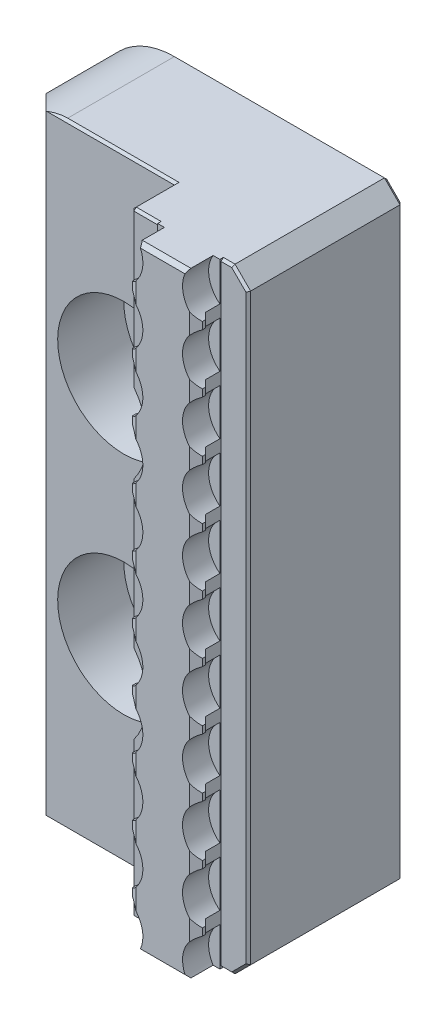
ISO-10303-21;
HEADER;
FILE_DESCRIPTION(('STEP AP214'),'2;1');
FILE_NAME('part.step','',(''),(''),'','','');
FILE_SCHEMA(('AUTOMOTIVE_DESIGN { 1 0 10303 214 1 1 1 1 }'));
ENDSEC;
DATA;
#1=APPLICATION_CONTEXT('core data for automotive mechanical design processes');
#2=APPLICATION_PROTOCOL_DEFINITION('international standard','automotive_design',2000,#1);
#3=PRODUCT_CONTEXT('',#1,'mechanical');
#4=PRODUCT('Part','Part','',(#3));
#5=PRODUCT_RELATED_PRODUCT_CATEGORY('part','',(#4));
#6=PRODUCT_DEFINITION_FORMATION('','',#4);
#7=PRODUCT_DEFINITION_CONTEXT('part definition',#1,'design');
#8=PRODUCT_DEFINITION('design','',#6,#7);
#9=PRODUCT_DEFINITION_SHAPE('','',#8);
#10=(LENGTH_UNIT() NAMED_UNIT(*) SI_UNIT(.MILLI.,.METRE.));
#11=(NAMED_UNIT(*) PLANE_ANGLE_UNIT() SI_UNIT($,.RADIAN.));
#12=(NAMED_UNIT(*) SI_UNIT($,.STERADIAN.) SOLID_ANGLE_UNIT());
#13=UNCERTAINTY_MEASURE_WITH_UNIT(LENGTH_MEASURE(1.E-05),#10,'distance_accuracy_value','');
#14=(GEOMETRIC_REPRESENTATION_CONTEXT(3) GLOBAL_UNCERTAINTY_ASSIGNED_CONTEXT((#13)) GLOBAL_UNIT_ASSIGNED_CONTEXT((#10,
#11,#12)) REPRESENTATION_CONTEXT('',''));
#15=CARTESIAN_POINT('',(0.,0.,0.));
#16=DIRECTION('',(0.,0.,1.));
#17=DIRECTION('',(1.,0.,0.));
#18=AXIS2_PLACEMENT_3D('',#15,#16,#17);
#19=CARTESIAN_POINT('',(6.5,66.5,23.5));
#20=DIRECTION('',(1.,0.,0.));
#21=DIRECTION('',(0.,0.,1.));
#22=AXIS2_PLACEMENT_3D('',#19,#20,#21);
#23=PLANE('',#22);
#24=DIRECTION('',(0.,-1.,0.));
#25=VECTOR('',#24,1.);
#26=CARTESIAN_POINT('',(6.5,66.5,14.5));
#27=LINE('',#26,#25);
#28=CARTESIAN_POINT('',(6.5,53.7,14.5));
#29=VERTEX_POINT('',#28);
#30=CARTESIAN_POINT('',(6.5,34.4772255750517,14.5));
#31=VERTEX_POINT('',#30);
#32=EDGE_CURVE('E895',#29,#31,#27,.T.);
#33=ORIENTED_EDGE('',*,*,#32,.T.);
#34=DIRECTION('',(0.,0.,1.));
#35=VECTOR('',#34,1.);
#36=CARTESIAN_POINT('',(6.5,34.4772255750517,23.5));
#37=LINE('',#36,#35);
#38=CARTESIAN_POINT('',(6.5,34.4772255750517,19.7));
#39=VERTEX_POINT('',#38);
#40=EDGE_CURVE('E872',#31,#39,#37,.T.);
#41=ORIENTED_EDGE('',*,*,#40,.T.);
#42=DIRECTION('',(0.,1.,0.));
#43=VECTOR('',#42,1.);
#44=CARTESIAN_POINT('',(6.5,54.,19.7));
#45=LINE('',#44,#43);
#46=CARTESIAN_POINT('',(6.5,53.7,19.7));
#47=VERTEX_POINT('',#46);
#48=EDGE_CURVE('E1083',#39,#47,#45,.T.);
#49=ORIENTED_EDGE('',*,*,#48,.T.);
#50=DIRECTION('',(0.,0.,-1.));
#51=VECTOR('',#50,1.);
#52=CARTESIAN_POINT('',(6.5,53.7,23.5));
#53=LINE('',#52,#51);
#54=EDGE_CURVE('E1089',#47,#29,#53,.T.);
#55=ORIENTED_EDGE('',*,*,#54,.T.);
#56=EDGE_LOOP('',(#33,#41,#49,#55));
#57=FACE_BOUND('',#56,.T.);
#58=ADVANCED_FACE('F14',(#57),#23,.F.);
#59=CARTESIAN_POINT('',(6.8,59.5,20.));
#60=DIRECTION('',(-0.707106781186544,0.,0.707106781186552));
#61=DIRECTION('',(-0.707106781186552,0.,-0.707106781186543));
#62=AXIS2_PLACEMENT_3D('',#59,#60,#61);
#63=PLANE('',#62);
#64=CARTESIAN_POINT('',(0.,29.,13.2000000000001));
#65=DIRECTION('',(-0.707106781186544,0.,0.707106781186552));
#66=DIRECTION('',(0.707106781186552,0.,0.707106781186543));
#67=AXIS2_PLACEMENT_3D('',#64,#65,#66);
#68=ELLIPSE('',#67,12.0208152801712,8.5);
#69=CARTESIAN_POINT('',(6.8,34.1,20.));
#70=VERTEX_POINT('',#69);
#71=EDGE_CURVE('E1299',#70,#39,#68,.T.);
#72=ORIENTED_EDGE('',*,*,#71,.F.);
#73=DIRECTION('',(0.,-1.,0.));
#74=VECTOR('',#73,1.);
#75=CARTESIAN_POINT('',(6.8,-25.,20.));
#76=LINE('',#75,#74);
#77=CARTESIAN_POINT('',(6.8,53.7,20.));
#78=VERTEX_POINT('',#77);
#79=EDGE_CURVE('E1102',#78,#70,#76,.T.);
#80=ORIENTED_EDGE('',*,*,#79,.F.);
#81=DIRECTION('',(0.707106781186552,0.,0.707106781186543));
#82=VECTOR('',#81,1.);
#83=CARTESIAN_POINT('',(6.65,53.7,19.85));
#84=LINE('',#83,#82);
#85=EDGE_CURVE('E1147',#47,#78,#84,.T.);
#86=ORIENTED_EDGE('',*,*,#85,.F.);
#87=ORIENTED_EDGE('',*,*,#48,.F.);
#88=EDGE_LOOP('',(#72,#80,#86,#87));
#89=FACE_BOUND('',#88,.T.);
#90=ADVANCED_FACE('F1984',(#89),#63,.T.);
#91=CARTESIAN_POINT('',(6.5,5.47722557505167,19.7));
#92=VERTEX_POINT('',#91);
#93=CARTESIAN_POINT('',(6.5,23.5227744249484,19.7));
#94=VERTEX_POINT('',#93);
#95=EDGE_CURVE('E887',#92,#94,#45,.T.);
#96=ORIENTED_EDGE('',*,*,#95,.T.);
#97=DIRECTION('',(0.,0.,1.));
#98=VECTOR('',#97,1.);
#99=CARTESIAN_POINT('',(6.5,23.5227744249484,23.5));
#100=LINE('',#99,#98);
#101=CARTESIAN_POINT('',(6.5,23.5227744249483,14.5));
#102=VERTEX_POINT('',#101);
#103=EDGE_CURVE('E869',#94,#102,#100,.F.);
#104=ORIENTED_EDGE('',*,*,#103,.T.);
#105=CARTESIAN_POINT('',(6.5,5.47722557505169,14.5));
#106=VERTEX_POINT('',#105);
#107=EDGE_CURVE('E884',#102,#106,#27,.T.);
#108=ORIENTED_EDGE('',*,*,#107,.T.);
#109=DIRECTION('',(0.,0.,1.));
#110=VECTOR('',#109,1.);
#111=CARTESIAN_POINT('',(6.5,5.47722557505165,23.5));
#112=LINE('',#111,#110);
#113=EDGE_CURVE('E1169',#106,#92,#112,.T.);
#114=ORIENTED_EDGE('',*,*,#113,.T.);
#115=EDGE_LOOP('',(#96,#104,#108,#114));
#116=FACE_BOUND('',#115,.T.);
#117=ADVANCED_FACE('F882',(#116),#23,.F.);
#118=CARTESIAN_POINT('',(6.8,23.9,20.));
#119=VERTEX_POINT('',#118);
#120=EDGE_CURVE('E1297',#94,#119,#68,.T.);
#121=ORIENTED_EDGE('',*,*,#120,.F.);
#122=ORIENTED_EDGE('',*,*,#95,.F.);
#123=CARTESIAN_POINT('',(0.,0.,13.2000000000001));
#124=DIRECTION('',(-0.707106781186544,0.,0.707106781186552));
#125=DIRECTION('',(0.707106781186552,0.,0.707106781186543));
#126=AXIS2_PLACEMENT_3D('',#123,#124,#125);
#127=ELLIPSE('',#126,12.0208152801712,8.5);
#128=CARTESIAN_POINT('',(6.8,5.1,20.));
#129=VERTEX_POINT('',#128);
#130=EDGE_CURVE('E878',#129,#92,#127,.T.);
#131=ORIENTED_EDGE('',*,*,#130,.F.);
#132=EDGE_CURVE('E1106',#119,#129,#76,.T.);
#133=ORIENTED_EDGE('',*,*,#132,.F.);
#134=EDGE_LOOP('',(#121,#122,#131,#133));
#135=FACE_BOUND('',#134,.T.);
#136=ADVANCED_FACE('F1994',(#135),#63,.T.);
#137=CARTESIAN_POINT('',(21.5,-25.,23.5));
#138=DIRECTION('',(0.,0.,-1.));
#139=DIRECTION('',(1.,0.,0.));
#140=AXIS2_PLACEMENT_3D('',#137,#138,#139);
#141=PLANE('',#140);
#142=CARTESIAN_POINT('',(20.3,52.,23.5));
#143=DIRECTION('',(0.,0.,1.));
#144=DIRECTION('',(-1.,0.,0.));
#145=AXIS2_PLACEMENT_3D('',#142,#143,#144);
#146=CIRCLE('',#145,3.75);
#147=CARTESIAN_POINT('',(16.8630682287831,53.5,23.5));
#148=VERTEX_POINT('',#147);
#149=CARTESIAN_POINT('',(17.4607695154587,49.5502509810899,23.5));
#150=VERTEX_POINT('',#149);
#151=EDGE_CURVE('E1683',#148,#150,#146,.T.);
#152=ORIENTED_EDGE('',*,*,#151,.F.);
#153=DIRECTION('',(-1.,0.,0.));
#154=VECTOR('',#153,1.);
#155=CARTESIAN_POINT('',(21.5,53.5,23.5));
#156=LINE('',#155,#154);
#157=CARTESIAN_POINT('',(11.1369317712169,53.5,23.5));
#158=VERTEX_POINT('',#157);
#159=EDGE_CURVE('E1207',#148,#158,#156,.T.);
#160=ORIENTED_EDGE('',*,*,#159,.T.);
#161=CARTESIAN_POINT('',(7.7,52.,23.5));
#162=DIRECTION('',(0.,0.,-1.));
#163=DIRECTION('',(1.,0.,0.));
#164=AXIS2_PLACEMENT_3D('',#161,#162,#163);
#165=CIRCLE('',#164,3.75);
#166=CARTESIAN_POINT('',(10.5392304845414,49.5502509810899,23.5));
#167=VERTEX_POINT('',#166);
#168=EDGE_CURVE('E1433',#158,#167,#165,.T.);
#169=ORIENTED_EDGE('',*,*,#168,.T.);
#170=DIRECTION('',(0.,-1.,0.));
#171=VECTOR('',#170,1.);
#172=CARTESIAN_POINT('',(10.5392304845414,59.5,23.5));
#173=LINE('',#172,#171);
#174=CARTESIAN_POINT('',(10.5392304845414,46.9497490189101,23.5));
#175=VERTEX_POINT('',#174);
#176=EDGE_CURVE('E1553',#167,#175,#173,.T.);
#177=ORIENTED_EDGE('',*,*,#176,.T.);
#178=CARTESIAN_POINT('',(7.7,44.5,23.5));
#179=DIRECTION('',(0.,0.,-1.));
#180=DIRECTION('',(1.,0.,0.));
#181=AXIS2_PLACEMENT_3D('',#178,#179,#180);
#182=CIRCLE('',#181,3.75);
#183=CARTESIAN_POINT('',(10.5392304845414,42.0502509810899,23.5));
#184=VERTEX_POINT('',#183);
#185=EDGE_CURVE('E1453',#175,#184,#182,.T.);
#186=ORIENTED_EDGE('',*,*,#185,.T.);
#187=CARTESIAN_POINT('',(10.5392304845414,39.4497490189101,23.5));
#188=VERTEX_POINT('',#187);
#189=EDGE_CURVE('E1556',#184,#188,#173,.T.);
#190=ORIENTED_EDGE('',*,*,#189,.T.);
#191=CARTESIAN_POINT('',(7.7,37.,23.5));
#192=DIRECTION('',(0.,0.,-1.));
#193=DIRECTION('',(1.,0.,0.));
#194=AXIS2_PLACEMENT_3D('',#191,#192,#193);
#195=CIRCLE('',#194,3.75);
#196=CARTESIAN_POINT('',(10.5392304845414,34.5502509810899,23.5));
#197=VERTEX_POINT('',#196);
#198=EDGE_CURVE('E1473',#188,#197,#195,.T.);
#199=ORIENTED_EDGE('',*,*,#198,.T.);
#200=CARTESIAN_POINT('',(10.5392304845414,31.9497490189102,23.5));
#201=VERTEX_POINT('',#200);
#202=EDGE_CURVE('E3528',#197,#201,#173,.T.);
#203=ORIENTED_EDGE('',*,*,#202,.T.);
#204=CARTESIAN_POINT('',(7.7,29.5,23.5));
#205=DIRECTION('',(0.,0.,-1.));
#206=DIRECTION('',(1.,0.,0.));
#207=AXIS2_PLACEMENT_3D('',#204,#205,#206);
#208=CIRCLE('',#207,3.75);
#209=CARTESIAN_POINT('',(10.5392304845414,27.0502509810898,23.5));
#210=VERTEX_POINT('',#209);
#211=EDGE_CURVE('E1493',#201,#210,#208,.T.);
#212=ORIENTED_EDGE('',*,*,#211,.T.);
#213=CARTESIAN_POINT('',(10.5392304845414,24.4497490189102,23.5));
#214=VERTEX_POINT('',#213);
#215=EDGE_CURVE('E3530',#210,#214,#173,.T.);
#216=ORIENTED_EDGE('',*,*,#215,.T.);
#217=CARTESIAN_POINT('',(7.7,22.,23.5));
#218=DIRECTION('',(0.,0.,-1.));
#219=DIRECTION('',(1.,0.,0.));
#220=AXIS2_PLACEMENT_3D('',#217,#218,#219);
#221=CIRCLE('',#220,3.75);
#222=CARTESIAN_POINT('',(10.5392304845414,19.5502509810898,23.5));
#223=VERTEX_POINT('',#222);
#224=EDGE_CURVE('E1513',#214,#223,#221,.T.);
#225=ORIENTED_EDGE('',*,*,#224,.T.);
#226=CARTESIAN_POINT('',(10.5392304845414,16.9497490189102,23.5));
#227=VERTEX_POINT('',#226);
#228=EDGE_CURVE('E3535',#223,#227,#173,.T.);
#229=ORIENTED_EDGE('',*,*,#228,.T.);
#230=CARTESIAN_POINT('',(7.7,14.5,23.5));
#231=DIRECTION('',(0.,0.,-1.));
#232=DIRECTION('',(1.,0.,0.));
#233=AXIS2_PLACEMENT_3D('',#230,#231,#232);
#234=CIRCLE('',#233,3.75);
#235=CARTESIAN_POINT('',(10.5392304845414,12.0502509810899,23.5));
#236=VERTEX_POINT('',#235);
#237=EDGE_CURVE('E1537',#227,#236,#234,.T.);
#238=ORIENTED_EDGE('',*,*,#237,.T.);
#239=CARTESIAN_POINT('',(10.5392304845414,9.44974901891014,23.5));
#240=VERTEX_POINT('',#239);
#241=EDGE_CURVE('E1558',#236,#240,#173,.T.);
#242=ORIENTED_EDGE('',*,*,#241,.T.);
#243=CARTESIAN_POINT('',(7.7,7.,23.5));
#244=DIRECTION('',(0.,0.,-1.));
#245=DIRECTION('',(1.,0.,0.));
#246=AXIS2_PLACEMENT_3D('',#243,#244,#245);
#247=CIRCLE('',#246,3.75);
#248=CARTESIAN_POINT('',(10.5392304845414,4.55025098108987,23.5));
#249=VERTEX_POINT('',#248);
#250=EDGE_CURVE('E1411',#240,#249,#247,.T.);
#251=ORIENTED_EDGE('',*,*,#250,.T.);
#252=CARTESIAN_POINT('',(10.5392304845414,1.94974901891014,23.5));
#253=VERTEX_POINT('',#252);
#254=EDGE_CURVE('E3529',#249,#253,#173,.T.);
#255=ORIENTED_EDGE('',*,*,#254,.T.);
#256=CARTESIAN_POINT('',(7.7,-0.5,23.5));
#257=DIRECTION('',(0.,0.,-1.));
#258=DIRECTION('',(1.,0.,0.));
#259=AXIS2_PLACEMENT_3D('',#256,#257,#258);
#260=CIRCLE('',#259,3.75);
#261=CARTESIAN_POINT('',(10.5392304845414,-2.94974901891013,23.5));
#262=VERTEX_POINT('',#261);
#263=EDGE_CURVE('E1389',#253,#262,#260,.T.);
#264=ORIENTED_EDGE('',*,*,#263,.T.);
#265=CARTESIAN_POINT('',(10.5392304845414,-5.55025098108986,23.5));
#266=VERTEX_POINT('',#265);
#267=EDGE_CURVE('E3532',#262,#266,#173,.T.);
#268=ORIENTED_EDGE('',*,*,#267,.T.);
#269=CARTESIAN_POINT('',(7.7,-8.,23.5));
#270=DIRECTION('',(0.,0.,-1.));
#271=DIRECTION('',(1.,0.,0.));
#272=AXIS2_PLACEMENT_3D('',#269,#270,#271);
#273=CIRCLE('',#272,3.75);
#274=CARTESIAN_POINT('',(10.5392304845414,-10.4497490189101,23.5));
#275=VERTEX_POINT('',#274);
#276=EDGE_CURVE('E1367',#266,#275,#273,.T.);
#277=ORIENTED_EDGE('',*,*,#276,.T.);
#278=CARTESIAN_POINT('',(10.5392304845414,-13.0502509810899,23.5));
#279=VERTEX_POINT('',#278);
#280=EDGE_CURVE('E3537',#275,#279,#173,.T.);
#281=ORIENTED_EDGE('',*,*,#280,.T.);
#282=CARTESIAN_POINT('',(7.7,-15.5,23.5));
#283=DIRECTION('',(0.,0.,-1.));
#284=DIRECTION('',(1.,0.,0.));
#285=AXIS2_PLACEMENT_3D('',#282,#283,#284);
#286=CIRCLE('',#285,3.75);
#287=CARTESIAN_POINT('',(10.5392304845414,-17.9497490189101,23.5));
#288=VERTEX_POINT('',#287);
#289=EDGE_CURVE('E1345',#279,#288,#286,.T.);
#290=ORIENTED_EDGE('',*,*,#289,.T.);
#291=CARTESIAN_POINT('',(10.5392304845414,-20.5502509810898,23.5));
#292=VERTEX_POINT('',#291);
#293=EDGE_CURVE('E1557',#288,#292,#173,.T.);
#294=ORIENTED_EDGE('',*,*,#293,.T.);
#295=CARTESIAN_POINT('',(7.7,-23.,23.5));
#296=DIRECTION('',(0.,0.,-1.));
#297=DIRECTION('',(1.,0.,0.));
#298=AXIS2_PLACEMENT_3D('',#295,#296,#297);
#299=CIRCLE('',#298,3.75);
#300=CARTESIAN_POINT('',(11.1369317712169,-24.5,23.5));
#301=VERTEX_POINT('',#300);
#302=EDGE_CURVE('E1165',#292,#301,#299,.T.);
#303=ORIENTED_EDGE('',*,*,#302,.T.);
#304=DIRECTION('',(1.,0.,0.));
#305=VECTOR('',#304,1.);
#306=CARTESIAN_POINT('',(17.1278556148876,-24.5,23.5));
#307=LINE('',#306,#305);
#308=CARTESIAN_POINT('',(16.8630682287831,-24.5,23.5));
#309=VERTEX_POINT('',#308);
#310=EDGE_CURVE('E1205',#301,#309,#307,.T.);
#311=ORIENTED_EDGE('',*,*,#310,.T.);
#312=CARTESIAN_POINT('',(20.3,-23.,23.5));
#313=DIRECTION('',(0.,0.,1.));
#314=DIRECTION('',(-1.,0.,0.));
#315=AXIS2_PLACEMENT_3D('',#312,#313,#314);
#316=CIRCLE('',#315,3.75);
#317=CARTESIAN_POINT('',(17.4607695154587,-20.5502509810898,23.5));
#318=VERTEX_POINT('',#317);
#319=EDGE_CURVE('E1579',#318,#309,#316,.T.);
#320=ORIENTED_EDGE('',*,*,#319,.F.);
#321=DIRECTION('',(0.,-1.,0.));
#322=VECTOR('',#321,1.);
#323=CARTESIAN_POINT('',(17.4607695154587,59.5,23.5));
#324=LINE('',#323,#322);
#325=CARTESIAN_POINT('',(17.4607695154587,-17.9497490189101,23.5));
#326=VERTEX_POINT('',#325);
#327=EDGE_CURVE('E1798',#326,#318,#324,.T.);
#328=ORIENTED_EDGE('',*,*,#327,.F.);
#329=CARTESIAN_POINT('',(20.3,-15.5,23.5));
#330=DIRECTION('',(0.,0.,1.));
#331=DIRECTION('',(-1.,0.,0.));
#332=AXIS2_PLACEMENT_3D('',#329,#330,#331);
#333=CIRCLE('',#332,3.75);
#334=CARTESIAN_POINT('',(17.4607695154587,-13.0502509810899,23.5));
#335=VERTEX_POINT('',#334);
#336=EDGE_CURVE('E1599',#335,#326,#333,.T.);
#337=ORIENTED_EDGE('',*,*,#336,.F.);
#338=CARTESIAN_POINT('',(17.4607695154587,-10.4497490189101,23.5));
#339=VERTEX_POINT('',#338);
#340=EDGE_CURVE('E1827',#339,#335,#324,.T.);
#341=ORIENTED_EDGE('',*,*,#340,.F.);
#342=CARTESIAN_POINT('',(20.3,-8.,23.5));
#343=DIRECTION('',(0.,0.,1.));
#344=DIRECTION('',(-1.,0.,0.));
#345=AXIS2_PLACEMENT_3D('',#342,#343,#344);
#346=CIRCLE('',#345,3.75);
#347=CARTESIAN_POINT('',(17.4607695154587,-5.55025098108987,23.5));
#348=VERTEX_POINT('',#347);
#349=EDGE_CURVE('E1620',#348,#339,#346,.T.);
#350=ORIENTED_EDGE('',*,*,#349,.F.);
#351=CARTESIAN_POINT('',(17.4607695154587,-2.94974901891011,23.5));
#352=VERTEX_POINT('',#351);
#353=EDGE_CURVE('E1835',#352,#348,#324,.T.);
#354=ORIENTED_EDGE('',*,*,#353,.F.);
#355=CARTESIAN_POINT('',(20.3,-0.5,23.5));
#356=DIRECTION('',(0.,0.,1.));
#357=DIRECTION('',(-1.,0.,0.));
#358=AXIS2_PLACEMENT_3D('',#355,#356,#357);
#359=CIRCLE('',#358,3.75);
#360=CARTESIAN_POINT('',(17.4607695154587,1.94974901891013,23.5));
#361=VERTEX_POINT('',#360);
#362=EDGE_CURVE('E1641',#361,#352,#359,.T.);
#363=ORIENTED_EDGE('',*,*,#362,.F.);
#364=CARTESIAN_POINT('',(17.4607695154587,4.55025098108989,23.5));
#365=VERTEX_POINT('',#364);
#366=EDGE_CURVE('E1825',#365,#361,#324,.T.);
#367=ORIENTED_EDGE('',*,*,#366,.F.);
#368=CARTESIAN_POINT('',(20.3,7.,23.5));
#369=DIRECTION('',(0.,0.,1.));
#370=DIRECTION('',(-1.,0.,0.));
#371=AXIS2_PLACEMENT_3D('',#368,#369,#370);
#372=CIRCLE('',#371,3.75);
#373=CARTESIAN_POINT('',(17.4607695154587,9.44974901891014,23.5));
#374=VERTEX_POINT('',#373);
#375=EDGE_CURVE('E1661',#374,#365,#372,.T.);
#376=ORIENTED_EDGE('',*,*,#375,.F.);
#377=CARTESIAN_POINT('',(17.4607695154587,12.0502509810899,23.5));
#378=VERTEX_POINT('',#377);
#379=EDGE_CURVE('E1818',#378,#374,#324,.T.);
#380=ORIENTED_EDGE('',*,*,#379,.F.);
#381=CARTESIAN_POINT('',(20.3,14.5,23.5));
#382=DIRECTION('',(0.,0.,1.));
#383=DIRECTION('',(-1.,0.,0.));
#384=AXIS2_PLACEMENT_3D('',#381,#382,#383);
#385=CIRCLE('',#384,3.75);
#386=CARTESIAN_POINT('',(17.4607695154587,16.9497490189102,23.5));
#387=VERTEX_POINT('',#386);
#388=EDGE_CURVE('E1777',#387,#378,#385,.T.);
#389=ORIENTED_EDGE('',*,*,#388,.F.);
#390=CARTESIAN_POINT('',(17.4607695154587,19.5502509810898,23.5));
#391=VERTEX_POINT('',#390);
#392=EDGE_CURVE('E1829',#391,#387,#324,.T.);
#393=ORIENTED_EDGE('',*,*,#392,.F.);
#394=CARTESIAN_POINT('',(20.3,22.,23.5));
#395=DIRECTION('',(0.,0.,1.));
#396=DIRECTION('',(-1.,0.,0.));
#397=AXIS2_PLACEMENT_3D('',#394,#395,#396);
#398=CIRCLE('',#397,3.75);
#399=CARTESIAN_POINT('',(17.4607695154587,24.4497490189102,23.5));
#400=VERTEX_POINT('',#399);
#401=EDGE_CURVE('E1758',#400,#391,#398,.T.);
#402=ORIENTED_EDGE('',*,*,#401,.F.);
#403=CARTESIAN_POINT('',(17.4607695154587,27.0502509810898,23.5));
#404=VERTEX_POINT('',#403);
#405=EDGE_CURVE('E1833',#404,#400,#324,.T.);
#406=ORIENTED_EDGE('',*,*,#405,.F.);
#407=CARTESIAN_POINT('',(20.3,29.5,23.5));
#408=DIRECTION('',(0.,0.,1.));
#409=DIRECTION('',(-1.,0.,0.));
#410=AXIS2_PLACEMENT_3D('',#407,#408,#409);
#411=CIRCLE('',#410,3.75);
#412=CARTESIAN_POINT('',(17.4607695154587,31.9497490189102,23.5));
#413=VERTEX_POINT('',#412);
#414=EDGE_CURVE('E1740',#413,#404,#411,.T.);
#415=ORIENTED_EDGE('',*,*,#414,.F.);
#416=CARTESIAN_POINT('',(17.4607695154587,34.5502509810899,23.5));
#417=VERTEX_POINT('',#416);
#418=EDGE_CURVE('E1824',#417,#413,#324,.T.);
#419=ORIENTED_EDGE('',*,*,#418,.F.);
#420=CARTESIAN_POINT('',(20.3,37.,23.5));
#421=DIRECTION('',(0.,0.,1.));
#422=DIRECTION('',(-1.,0.,0.));
#423=AXIS2_PLACEMENT_3D('',#420,#421,#422);
#424=CIRCLE('',#423,3.75);
#425=CARTESIAN_POINT('',(17.4607695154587,39.4497490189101,23.5));
#426=VERTEX_POINT('',#425);
#427=EDGE_CURVE('E1721',#426,#417,#424,.T.);
#428=ORIENTED_EDGE('',*,*,#427,.F.);
#429=CARTESIAN_POINT('',(17.4607695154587,42.0502509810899,23.5));
#430=VERTEX_POINT('',#429);
#431=EDGE_CURVE('E1817',#430,#426,#324,.T.);
#432=ORIENTED_EDGE('',*,*,#431,.F.);
#433=CARTESIAN_POINT('',(20.3,44.5,23.5));
#434=DIRECTION('',(0.,0.,1.));
#435=DIRECTION('',(-1.,0.,0.));
#436=AXIS2_PLACEMENT_3D('',#433,#434,#435);
#437=CIRCLE('',#436,3.75);
#438=CARTESIAN_POINT('',(17.4607695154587,46.9497490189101,23.5));
#439=VERTEX_POINT('',#438);
#440=EDGE_CURVE('E1702',#439,#430,#437,.T.);
#441=ORIENTED_EDGE('',*,*,#440,.F.);
#442=EDGE_CURVE('E1816',#150,#439,#324,.T.);
#443=ORIENTED_EDGE('',*,*,#442,.F.);
#444=EDGE_LOOP('',(#152,#160,#169,#177,#186,#190,#199,#203,#212,#216,#225,#229,#238,#242,#251,
#255,#264,#268,#277,#281,#290,#294,#303,#311,#320,#328,#337,#341,#350,#354,#363,#367,#376,#380,
#389,#393,#402,#406,#415,#419,#428,#432,#441,#443));
#445=FACE_BOUND('',#444,.T.);
#446=ADVANCED_FACE('F1854',(#445),#141,.F.);
#447=CARTESIAN_POINT('',(10.,59.5,22.));
#448=DIRECTION('',(-1.,0.,0.));
#449=DIRECTION('',(0.,0.,-1.));
#450=AXIS2_PLACEMENT_3D('',#447,#448,#449);
#451=PLANE('',#450);
#452=DIRECTION('',(0.,1.,0.));
#453=VECTOR('',#452,1.);
#454=CARTESIAN_POINT('',(10.,59.5,20.15));
#455=LINE('',#454,#453);
#456=CARTESIAN_POINT('',(10.,-25.,20.15));
#457=VERTEX_POINT('',#456);
#458=CARTESIAN_POINT('',(10.,-20.038159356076,20.15));
#459=VERTEX_POINT('',#458);
#460=EDGE_CURVE('E1330',#457,#459,#455,.T.);
#461=ORIENTED_EDGE('',*,*,#460,.T.);
#462=DIRECTION('',(0.,0.,1.));
#463=VECTOR('',#462,1.);
#464=CARTESIAN_POINT('',(10.,-20.038159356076,20.15));
#465=LINE('',#464,#463);
#466=CARTESIAN_POINT('',(10.,-20.038159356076,22.));
#467=VERTEX_POINT('',#466);
#468=EDGE_CURVE('E1342',#459,#467,#465,.T.);
#469=ORIENTED_EDGE('',*,*,#468,.T.);
#470=DIRECTION('',(0.,-1.,0.));
#471=VECTOR('',#470,1.);
#472=CARTESIAN_POINT('',(10.,59.5,22.));
#473=LINE('',#472,#471);
#474=CARTESIAN_POINT('',(10.,-18.461840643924,22.));
#475=VERTEX_POINT('',#474);
#476=EDGE_CURVE('E1572',#475,#467,#473,.T.);
#477=ORIENTED_EDGE('',*,*,#476,.F.);
#478=DIRECTION('',(0.,0.,1.));
#479=VECTOR('',#478,1.);
#480=CARTESIAN_POINT('',(10.,-18.461840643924,20.15));
#481=LINE('',#480,#479);
#482=CARTESIAN_POINT('',(10.,-18.461840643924,20.15));
#483=VERTEX_POINT('',#482);
#484=EDGE_CURVE('E1364',#475,#483,#481,.F.);
#485=ORIENTED_EDGE('',*,*,#484,.T.);
#486=DIRECTION('',(0.,1.,0.));
#487=VECTOR('',#486,1.);
#488=CARTESIAN_POINT('',(10.,59.5,20.15));
#489=LINE('',#488,#487);
#490=CARTESIAN_POINT('',(10.,-12.538159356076,20.15));
#491=VERTEX_POINT('',#490);
#492=EDGE_CURVE('E1053',#483,#491,#489,.T.);
#493=ORIENTED_EDGE('',*,*,#492,.T.);
#494=DIRECTION('',(0.,0.,1.));
#495=VECTOR('',#494,1.);
#496=CARTESIAN_POINT('',(10.,-12.538159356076,20.15));
#497=LINE('',#496,#495);
#498=CARTESIAN_POINT('',(10.,-12.538159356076,22.));
#499=VERTEX_POINT('',#498);
#500=EDGE_CURVE('E1357',#491,#499,#497,.T.);
#501=ORIENTED_EDGE('',*,*,#500,.T.);
#502=CARTESIAN_POINT('',(10.,-10.9618406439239,22.));
#503=VERTEX_POINT('',#502);
#504=EDGE_CURVE('E3591',#503,#499,#473,.T.);
#505=ORIENTED_EDGE('',*,*,#504,.F.);
#506=DIRECTION('',(0.,0.,1.));
#507=VECTOR('',#506,1.);
#508=CARTESIAN_POINT('',(10.,-10.961840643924,20.15));
#509=LINE('',#508,#507);
#510=CARTESIAN_POINT('',(10.,-10.961840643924,20.15));
#511=VERTEX_POINT('',#510);
#512=EDGE_CURVE('E1386',#503,#511,#509,.F.);
#513=ORIENTED_EDGE('',*,*,#512,.T.);
#514=DIRECTION('',(0.,1.,0.));
#515=VECTOR('',#514,1.);
#516=CARTESIAN_POINT('',(10.,59.5,20.15));
#517=LINE('',#516,#515);
#518=CARTESIAN_POINT('',(10.,-5.03815935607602,20.15));
#519=VERTEX_POINT('',#518);
#520=EDGE_CURVE('E1046',#511,#519,#517,.T.);
#521=ORIENTED_EDGE('',*,*,#520,.T.);
#522=DIRECTION('',(0.,0.,1.));
#523=VECTOR('',#522,1.);
#524=CARTESIAN_POINT('',(10.,-5.03815935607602,20.15));
#525=LINE('',#524,#523);
#526=CARTESIAN_POINT('',(10.,-5.03815935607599,22.));
#527=VERTEX_POINT('',#526);
#528=EDGE_CURVE('E1379',#519,#527,#525,.T.);
#529=ORIENTED_EDGE('',*,*,#528,.T.);
#530=CARTESIAN_POINT('',(10.,-3.46184064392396,22.));
#531=VERTEX_POINT('',#530);
#532=EDGE_CURVE('E3587',#531,#527,#473,.T.);
#533=ORIENTED_EDGE('',*,*,#532,.F.);
#534=DIRECTION('',(0.,0.,1.));
#535=VECTOR('',#534,1.);
#536=CARTESIAN_POINT('',(10.,-3.46184064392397,20.15));
#537=LINE('',#536,#535);
#538=CARTESIAN_POINT('',(10.,-3.46184064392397,20.15));
#539=VERTEX_POINT('',#538);
#540=EDGE_CURVE('E1408',#531,#539,#537,.F.);
#541=ORIENTED_EDGE('',*,*,#540,.T.);
#542=DIRECTION('',(0.,1.,0.));
#543=VECTOR('',#542,1.);
#544=CARTESIAN_POINT('',(10.,59.5,20.15));
#545=LINE('',#544,#543);
#546=CARTESIAN_POINT('',(10.,2.46184064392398,20.15));
#547=VERTEX_POINT('',#546);
#548=EDGE_CURVE('E1039',#539,#547,#545,.T.);
#549=ORIENTED_EDGE('',*,*,#548,.T.);
#550=DIRECTION('',(0.,0.,1.));
#551=VECTOR('',#550,1.);
#552=CARTESIAN_POINT('',(10.,2.46184064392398,20.15));
#553=LINE('',#552,#551);
#554=CARTESIAN_POINT('',(10.,2.46184064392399,22.));
#555=VERTEX_POINT('',#554);
#556=EDGE_CURVE('E1401',#547,#555,#553,.T.);
#557=ORIENTED_EDGE('',*,*,#556,.T.);
#558=CARTESIAN_POINT('',(10.,4.03815935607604,22.));
#559=VERTEX_POINT('',#558);
#560=EDGE_CURVE('E3583',#559,#555,#473,.T.);
#561=ORIENTED_EDGE('',*,*,#560,.F.);
#562=DIRECTION('',(0.,0.,1.));
#563=VECTOR('',#562,1.);
#564=CARTESIAN_POINT('',(10.,4.03815935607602,20.15));
#565=LINE('',#564,#563);
#566=CARTESIAN_POINT('',(10.,4.03815935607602,20.15));
#567=VERTEX_POINT('',#566);
#568=EDGE_CURVE('E1430',#559,#567,#565,.F.);
#569=ORIENTED_EDGE('',*,*,#568,.T.);
#570=DIRECTION('',(0.,1.,0.));
#571=VECTOR('',#570,1.);
#572=CARTESIAN_POINT('',(10.,59.5,20.15));
#573=LINE('',#572,#571);
#574=CARTESIAN_POINT('',(10.,9.96184064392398,20.15));
#575=VERTEX_POINT('',#574);
#576=EDGE_CURVE('E1032',#567,#575,#573,.T.);
#577=ORIENTED_EDGE('',*,*,#576,.T.);
#578=DIRECTION('',(0.,0.,1.));
#579=VECTOR('',#578,1.);
#580=CARTESIAN_POINT('',(10.,9.96184064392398,20.15));
#581=LINE('',#580,#579);
#582=CARTESIAN_POINT('',(10.,9.96184064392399,22.));
#583=VERTEX_POINT('',#582);
#584=EDGE_CURVE('E1423',#575,#583,#581,.T.);
#585=ORIENTED_EDGE('',*,*,#584,.T.);
#586=CARTESIAN_POINT('',(10.,11.538159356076,22.));
#587=VERTEX_POINT('',#586);
#588=EDGE_CURVE('E1573',#587,#583,#473,.T.);
#589=ORIENTED_EDGE('',*,*,#588,.F.);
#590=DIRECTION('',(0.,0.,1.));
#591=VECTOR('',#590,1.);
#592=CARTESIAN_POINT('',(10.,11.538159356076,20.15));
#593=LINE('',#592,#591);
#594=CARTESIAN_POINT('',(10.,11.538159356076,20.15));
#595=VERTEX_POINT('',#594);
#596=EDGE_CURVE('E985',#587,#595,#593,.F.);
#597=ORIENTED_EDGE('',*,*,#596,.T.);
#598=DIRECTION('',(0.,1.,0.));
#599=VECTOR('',#598,1.);
#600=CARTESIAN_POINT('',(10.,59.5,20.15));
#601=LINE('',#600,#599);
#602=CARTESIAN_POINT('',(10.,17.461840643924,20.15));
#603=VERTEX_POINT('',#602);
#604=EDGE_CURVE('E979',#595,#603,#601,.T.);
#605=ORIENTED_EDGE('',*,*,#604,.T.);
#606=DIRECTION('',(0.,0.,1.));
#607=VECTOR('',#606,1.);
#608=CARTESIAN_POINT('',(10.,17.461840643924,20.15));
#609=LINE('',#608,#607);
#610=CARTESIAN_POINT('',(10.,17.461840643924,22.));
#611=VERTEX_POINT('',#610);
#612=EDGE_CURVE('E982',#603,#611,#609,.T.);
#613=ORIENTED_EDGE('',*,*,#612,.T.);
#614=CARTESIAN_POINT('',(10.,19.0381593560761,22.));
#615=VERTEX_POINT('',#614);
#616=EDGE_CURVE('E3579',#615,#611,#473,.T.);
#617=ORIENTED_EDGE('',*,*,#616,.F.);
#618=DIRECTION('',(0.,0.,1.));
#619=VECTOR('',#618,1.);
#620=CARTESIAN_POINT('',(10.,19.0381593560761,20.15));
#621=LINE('',#620,#619);
#622=CARTESIAN_POINT('',(10.,19.0381593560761,20.15));
#623=VERTEX_POINT('',#622);
#624=EDGE_CURVE('E994',#615,#623,#621,.F.);
#625=ORIENTED_EDGE('',*,*,#624,.T.);
#626=DIRECTION('',(0.,1.,0.));
#627=VECTOR('',#626,1.);
#628=CARTESIAN_POINT('',(10.,59.5,20.15));
#629=LINE('',#628,#627);
#630=CARTESIAN_POINT('',(10.,24.961840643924,20.15));
#631=VERTEX_POINT('',#630);
#632=EDGE_CURVE('E988',#623,#631,#629,.T.);
#633=ORIENTED_EDGE('',*,*,#632,.T.);
#634=DIRECTION('',(0.,0.,1.));
#635=VECTOR('',#634,1.);
#636=CARTESIAN_POINT('',(10.,24.961840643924,20.15));
#637=LINE('',#636,#635);
#638=CARTESIAN_POINT('',(10.,24.961840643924,22.));
#639=VERTEX_POINT('',#638);
#640=EDGE_CURVE('E991',#631,#639,#637,.T.);
#641=ORIENTED_EDGE('',*,*,#640,.T.);
#642=CARTESIAN_POINT('',(10.,26.5381593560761,22.));
#643=VERTEX_POINT('',#642);
#644=EDGE_CURVE('E3580',#643,#639,#473,.T.);
#645=ORIENTED_EDGE('',*,*,#644,.F.);
#646=DIRECTION('',(0.,0.,1.));
#647=VECTOR('',#646,1.);
#648=CARTESIAN_POINT('',(10.,26.5381593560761,20.15));
#649=LINE('',#648,#647);
#650=CARTESIAN_POINT('',(10.,26.5381593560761,20.15));
#651=VERTEX_POINT('',#650);
#652=EDGE_CURVE('E1003',#643,#651,#649,.F.);
#653=ORIENTED_EDGE('',*,*,#652,.T.);
#654=DIRECTION('',(0.,1.,0.));
#655=VECTOR('',#654,1.);
#656=CARTESIAN_POINT('',(10.,59.5,20.15));
#657=LINE('',#656,#655);
#658=CARTESIAN_POINT('',(10.,32.461840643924,20.15));
#659=VERTEX_POINT('',#658);
#660=EDGE_CURVE('E997',#651,#659,#657,.T.);
#661=ORIENTED_EDGE('',*,*,#660,.T.);
#662=DIRECTION('',(0.,0.,1.));
#663=VECTOR('',#662,1.);
#664=CARTESIAN_POINT('',(10.,32.461840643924,20.15));
#665=LINE('',#664,#663);
#666=CARTESIAN_POINT('',(10.,32.461840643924,22.));
#667=VERTEX_POINT('',#666);
#668=EDGE_CURVE('E1000',#659,#667,#665,.T.);
#669=ORIENTED_EDGE('',*,*,#668,.T.);
#670=CARTESIAN_POINT('',(10.,34.0381593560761,22.));
#671=VERTEX_POINT('',#670);
#672=EDGE_CURVE('E3581',#671,#667,#473,.T.);
#673=ORIENTED_EDGE('',*,*,#672,.F.);
#674=DIRECTION('',(0.,0.,1.));
#675=VECTOR('',#674,1.);
#676=CARTESIAN_POINT('',(10.,34.0381593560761,20.15));
#677=LINE('',#676,#675);
#678=CARTESIAN_POINT('',(10.,34.0381593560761,20.15));
#679=VERTEX_POINT('',#678);
#680=EDGE_CURVE('E1012',#671,#679,#677,.F.);
#681=ORIENTED_EDGE('',*,*,#680,.T.);
#682=DIRECTION('',(0.,1.,0.));
#683=VECTOR('',#682,1.);
#684=CARTESIAN_POINT('',(10.,59.5,20.15));
#685=LINE('',#684,#683);
#686=CARTESIAN_POINT('',(10.,39.961840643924,20.15));
#687=VERTEX_POINT('',#686);
#688=EDGE_CURVE('E1006',#679,#687,#685,.T.);
#689=ORIENTED_EDGE('',*,*,#688,.T.);
#690=DIRECTION('',(0.,0.,1.));
#691=VECTOR('',#690,1.);
#692=CARTESIAN_POINT('',(10.,39.961840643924,20.15));
#693=LINE('',#692,#691);
#694=CARTESIAN_POINT('',(10.,39.961840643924,22.));
#695=VERTEX_POINT('',#694);
#696=EDGE_CURVE('E1009',#687,#695,#693,.T.);
#697=ORIENTED_EDGE('',*,*,#696,.T.);
#698=CARTESIAN_POINT('',(10.,41.538159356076,22.));
#699=VERTEX_POINT('',#698);
#700=EDGE_CURVE('E1571',#699,#695,#473,.T.);
#701=ORIENTED_EDGE('',*,*,#700,.F.);
#702=DIRECTION('',(0.,0.,1.));
#703=VECTOR('',#702,1.);
#704=CARTESIAN_POINT('',(10.,41.538159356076,20.15));
#705=LINE('',#704,#703);
#706=CARTESIAN_POINT('',(10.,41.538159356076,20.15));
#707=VERTEX_POINT('',#706);
#708=EDGE_CURVE('E1021',#699,#707,#705,.F.);
#709=ORIENTED_EDGE('',*,*,#708,.T.);
#710=DIRECTION('',(0.,1.,0.));
#711=VECTOR('',#710,1.);
#712=CARTESIAN_POINT('',(10.,59.5,20.15));
#713=LINE('',#712,#711);
#714=CARTESIAN_POINT('',(10.,47.461840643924,20.15));
#715=VERTEX_POINT('',#714);
#716=EDGE_CURVE('E1015',#707,#715,#713,.T.);
#717=ORIENTED_EDGE('',*,*,#716,.T.);
#718=DIRECTION('',(0.,0.,1.));
#719=VECTOR('',#718,1.);
#720=CARTESIAN_POINT('',(10.,47.461840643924,20.15));
#721=LINE('',#720,#719);
#722=CARTESIAN_POINT('',(10.,47.461840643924,22.));
#723=VERTEX_POINT('',#722);
#724=EDGE_CURVE('E1018',#715,#723,#721,.T.);
#725=ORIENTED_EDGE('',*,*,#724,.T.);
#726=CARTESIAN_POINT('',(10.,49.038159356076,22.));
#727=VERTEX_POINT('',#726);
#728=EDGE_CURVE('E1569',#727,#723,#473,.T.);
#729=ORIENTED_EDGE('',*,*,#728,.F.);
#730=DIRECTION('',(0.,0.,1.));
#731=VECTOR('',#730,1.);
#732=CARTESIAN_POINT('',(10.,49.038159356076,20.15));
#733=LINE('',#732,#731);
#734=CARTESIAN_POINT('',(10.,49.038159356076,20.15));
#735=VERTEX_POINT('',#734);
#736=EDGE_CURVE('E1441',#727,#735,#733,.F.);
#737=ORIENTED_EDGE('',*,*,#736,.T.);
#738=DIRECTION('',(0.,1.,0.));
#739=VECTOR('',#738,1.);
#740=CARTESIAN_POINT('',(10.,59.5,20.15));
#741=LINE('',#740,#739);
#742=CARTESIAN_POINT('',(10.,54.,20.15));
#743=VERTEX_POINT('',#742);
#744=EDGE_CURVE('E1438',#735,#743,#741,.T.);
#745=ORIENTED_EDGE('',*,*,#744,.T.);
#746=DIRECTION('',(0.,0.,-1.));
#747=VECTOR('',#746,1.);
#748=CARTESIAN_POINT('',(10.,54.,0.));
#749=LINE('',#748,#747);
#750=CARTESIAN_POINT('',(10.,54.,19.7));
#751=VERTEX_POINT('',#750);
#752=EDGE_CURVE('E977',#743,#751,#749,.T.);
#753=ORIENTED_EDGE('',*,*,#752,.T.);
#754=DIRECTION('',(0.,-0.70710678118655,0.707106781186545));
#755=VECTOR('',#754,1.);
#756=CARTESIAN_POINT('',(10.,53.7,20.));
#757=LINE('',#756,#755);
#758=CARTESIAN_POINT('',(10.,53.7,20.));
#759=VERTEX_POINT('',#758);
#760=EDGE_CURVE('E1129',#751,#759,#757,.T.);
#761=ORIENTED_EDGE('',*,*,#760,.T.);
#762=DIRECTION('',(0.,-1.,0.));
#763=VECTOR('',#762,1.);
#764=CARTESIAN_POINT('',(10.,59.5,20.));
#765=LINE('',#764,#763);
#766=CARTESIAN_POINT('',(10.,-24.7,20.));
#767=VERTEX_POINT('',#766);
#768=EDGE_CURVE('E1574',#759,#767,#765,.T.);
#769=ORIENTED_EDGE('',*,*,#768,.T.);
#770=DIRECTION('',(0.,0.707106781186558,0.707106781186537));
#771=VECTOR('',#770,1.);
#772=CARTESIAN_POINT('',(10.,-25.,19.7));
#773=LINE('',#772,#771);
#774=CARTESIAN_POINT('',(10.,-25.,19.7));
#775=VERTEX_POINT('',#774);
#776=EDGE_CURVE('E1131',#767,#775,#773,.F.);
#777=ORIENTED_EDGE('',*,*,#776,.T.);
#778=DIRECTION('',(0.,0.,-1.));
#779=VECTOR('',#778,1.);
#780=CARTESIAN_POINT('',(10.,-25.,0.));
#781=LINE('',#780,#779);
#782=EDGE_CURVE('E1555',#457,#775,#781,.T.);
#783=ORIENTED_EDGE('',*,*,#782,.F.);
#784=EDGE_LOOP('',(#461,#469,#477,#485,#493,#501,#505,#513,#521,#529,#533,#541,#549,#557,#561,
#569,#577,#585,#589,#597,#605,#613,#617,#625,#633,#641,#645,#653,#661,#669,#673,#681,#689,#697,
#701,#709,#717,#725,#729,#737,#745,#753,#761,#769,#777,#783));
#785=FACE_BOUND('',#784,.T.);
#786=ADVANCED_FACE('F2971',(#785),#451,.T.);
#787=CARTESIAN_POINT('',(10.5392304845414,59.5,23.5));
#788=DIRECTION('',(-0.499999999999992,0.,0.866025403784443));
#789=DIRECTION('',(-0.866025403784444,0.,-0.499999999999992));
#790=AXIS2_PLACEMENT_3D('',#787,#788,#789);
#791=PLANE('',#790);
#792=DIRECTION('',(0.,-1.,0.));
#793=VECTOR('',#792,1.);
#794=CARTESIAN_POINT('',(9.5,59.5,22.9));
#795=LINE('',#794,#793);
#796=CARTESIAN_POINT('',(9.5,-18.7897568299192,22.9));
#797=VERTEX_POINT('',#796);
#798=CARTESIAN_POINT('',(9.5,-19.7102431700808,22.9));
#799=VERTEX_POINT('',#798);
#800=EDGE_CURVE('E1562',#797,#799,#795,.T.);
#801=ORIENTED_EDGE('',*,*,#800,.T.);
#802=CARTESIAN_POINT('',(7.7,-23.,21.8607695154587));
#803=DIRECTION('',(-0.499999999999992,0.,0.866025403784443));
#804=DIRECTION('',(0.866025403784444,0.,0.499999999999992));
#805=AXIS2_PLACEMENT_3D('',#802,#803,#804);
#806=ELLIPSE('',#805,4.33012701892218,3.75);
#807=EDGE_CURVE('E1339',#799,#292,#806,.F.);
#808=ORIENTED_EDGE('',*,*,#807,.T.);
#809=ORIENTED_EDGE('',*,*,#293,.F.);
#810=CARTESIAN_POINT('',(7.7,-15.5,21.8607695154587));
#811=DIRECTION('',(-0.499999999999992,0.,0.866025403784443));
#812=DIRECTION('',(0.866025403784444,0.,0.499999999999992));
#813=AXIS2_PLACEMENT_3D('',#810,#811,#812);
#814=ELLIPSE('',#813,4.33012701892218,3.75);
#815=EDGE_CURVE('E1358',#288,#797,#814,.F.);
#816=ORIENTED_EDGE('',*,*,#815,.T.);
#817=EDGE_LOOP('',(#801,#808,#809,#816));
#818=FACE_BOUND('',#817,.T.);
#819=ADVANCED_FACE('F2746',(#818),#791,.T.);
#820=CARTESIAN_POINT('',(9.5,59.5,22.9));
#821=DIRECTION('',(-1.,0.,0.));
#822=DIRECTION('',(0.,0.,-1.));
#823=AXIS2_PLACEMENT_3D('',#820,#821,#822);
#824=PLANE('',#823);
#825=DIRECTION('',(0.,-1.,0.));
#826=VECTOR('',#825,1.);
#827=CARTESIAN_POINT('',(9.5,59.5,22.5));
#828=LINE('',#827,#826);
#829=CARTESIAN_POINT('',(9.5,-18.7897568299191,22.5));
#830=VERTEX_POINT('',#829);
#831=CARTESIAN_POINT('',(9.5,-19.7102431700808,22.5));
#832=VERTEX_POINT('',#831);
#833=EDGE_CURVE('E1567',#830,#832,#828,.T.);
#834=ORIENTED_EDGE('',*,*,#833,.T.);
#835=DIRECTION('',(0.,0.,1.));
#836=VECTOR('',#835,1.);
#837=CARTESIAN_POINT('',(9.5,-19.7102431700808,20.15));
#838=LINE('',#837,#836);
#839=EDGE_CURVE('E1336',#832,#799,#838,.T.);
#840=ORIENTED_EDGE('',*,*,#839,.T.);
#841=ORIENTED_EDGE('',*,*,#800,.F.);
#842=DIRECTION('',(0.,0.,1.));
#843=VECTOR('',#842,1.);
#844=CARTESIAN_POINT('',(9.5,-18.7897568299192,20.15));
#845=LINE('',#844,#843);
#846=EDGE_CURVE('E1361',#797,#830,#845,.F.);
#847=ORIENTED_EDGE('',*,*,#846,.T.);
#848=EDGE_LOOP('',(#834,#840,#841,#847));
#849=FACE_BOUND('',#848,.T.);
#850=ADVANCED_FACE('F2736',(#849),#824,.T.);
#851=CARTESIAN_POINT('',(9.5,59.5,22.5));
#852=DIRECTION('',(-0.707106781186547,0.,-0.707106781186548));
#853=DIRECTION('',(0.707106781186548,0.,-0.707106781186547));
#854=AXIS2_PLACEMENT_3D('',#851,#852,#853);
#855=PLANE('',#854);
#856=ORIENTED_EDGE('',*,*,#476,.T.);
#857=CARTESIAN_POINT('',(7.7,-23.,24.3));
#858=DIRECTION('',(-0.707106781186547,0.,-0.707106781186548));
#859=DIRECTION('',(-0.707106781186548,0.,0.707106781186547));
#860=AXIS2_PLACEMENT_3D('',#857,#858,#859);
#861=ELLIPSE('',#860,5.30330085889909,3.75);
#862=EDGE_CURVE('E1333',#467,#832,#861,.F.);
#863=ORIENTED_EDGE('',*,*,#862,.T.);
#864=ORIENTED_EDGE('',*,*,#833,.F.);
#865=CARTESIAN_POINT('',(7.7,-15.5,24.3));
#866=DIRECTION('',(-0.707106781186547,0.,-0.707106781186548));
#867=DIRECTION('',(-0.707106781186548,0.,0.707106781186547));
#868=AXIS2_PLACEMENT_3D('',#865,#866,#867);
#869=ELLIPSE('',#868,5.30330085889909,3.75);
#870=EDGE_CURVE('E1052',#830,#475,#869,.F.);
#871=ORIENTED_EDGE('',*,*,#870,.T.);
#872=EDGE_LOOP('',(#856,#863,#864,#871));
#873=FACE_BOUND('',#872,.T.);
#874=ADVANCED_FACE('F2012',(#873),#855,.T.);
#875=CARTESIAN_POINT('',(21.5,-25.,0.));
#876=DIRECTION('',(0.,-1.,0.));
#877=DIRECTION('',(1.,0.,0.));
#878=AXIS2_PLACEMENT_3D('',#875,#876,#877);
#879=PLANE('',#878);
#880=DIRECTION('',(0.,0.,1.));
#881=VECTOR('',#880,1.);
#882=CARTESIAN_POINT('',(17.1278556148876,-25.,20.15));
#883=LINE('',#882,#881);
#884=CARTESIAN_POINT('',(17.1278556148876,-25.,23.));
#885=VERTEX_POINT('',#884);
#886=CARTESIAN_POINT('',(17.1278556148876,-25.,20.15));
#887=VERTEX_POINT('',#886);
#888=EDGE_CURVE('E1593',#885,#887,#883,.F.);
#889=ORIENTED_EDGE('',*,*,#888,.F.);
#890=DIRECTION('',(-1.,0.,0.));
#891=VECTOR('',#890,1.);
#892=CARTESIAN_POINT('',(10.8721443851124,-25.,23.));
#893=LINE('',#892,#891);
#894=CARTESIAN_POINT('',(10.8721443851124,-25.,23.));
#895=VERTEX_POINT('',#894);
#896=EDGE_CURVE('E1221',#885,#895,#893,.T.);
#897=ORIENTED_EDGE('',*,*,#896,.T.);
#898=DIRECTION('',(0.,0.,1.));
#899=VECTOR('',#898,1.);
#900=CARTESIAN_POINT('',(10.8721443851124,-25.,20.15));
#901=LINE('',#900,#899);
#902=CARTESIAN_POINT('',(10.8721443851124,-25.,20.15));
#903=VERTEX_POINT('',#902);
#904=EDGE_CURVE('E1059',#895,#903,#901,.F.);
#905=ORIENTED_EDGE('',*,*,#904,.T.);
#906=DIRECTION('',(-1.,0.,0.));
#907=VECTOR('',#906,1.);
#908=CARTESIAN_POINT('',(21.5,-25.,20.15));
#909=LINE('',#908,#907);
#910=EDGE_CURVE('E1056',#903,#457,#909,.T.);
#911=ORIENTED_EDGE('',*,*,#910,.T.);
#912=ORIENTED_EDGE('',*,*,#782,.T.);
#913=DIRECTION('',(-1.,0.,0.));
#914=VECTOR('',#913,1.);
#915=CARTESIAN_POINT('',(21.5,-25.,19.7));
#916=LINE('',#915,#914);
#917=CARTESIAN_POINT('',(6.8,-25.,19.7));
#918=VERTEX_POINT('',#917);
#919=EDGE_CURVE('E1094',#775,#918,#916,.T.);
#920=ORIENTED_EDGE('',*,*,#919,.T.);
#921=DIRECTION('',(0.,0.,-1.));
#922=VECTOR('',#921,1.);
#923=CARTESIAN_POINT('',(6.8,-25.,14.5));
#924=LINE('',#923,#922);
#925=CARTESIAN_POINT('',(6.8,-25.,14.2));
#926=VERTEX_POINT('',#925);
#927=EDGE_CURVE('E1096',#918,#926,#924,.T.);
#928=ORIENTED_EDGE('',*,*,#927,.T.);
#929=DIRECTION('',(-1.,0.,0.));
#930=VECTOR('',#929,1.);
#931=CARTESIAN_POINT('',(-17.5,-25.,14.2));
#932=LINE('',#931,#930);
#933=CARTESIAN_POINT('',(-7.5,-25.,14.2));
#934=VERTEX_POINT('',#933);
#935=EDGE_CURVE('E1098',#926,#934,#932,.T.);
#936=ORIENTED_EDGE('',*,*,#935,.T.);
#937=DIRECTION('',(0.,0.,-1.));
#938=VECTOR('',#937,1.);
#939=CARTESIAN_POINT('',(-7.5,-25.,0.));
#940=LINE('',#939,#938);
#941=CARTESIAN_POINT('',(-7.5,-25.,0.5));
#942=VERTEX_POINT('',#941);
#943=EDGE_CURVE('E1200',#934,#942,#940,.T.);
#944=ORIENTED_EDGE('',*,*,#943,.T.);
#945=DIRECTION('',(1.,0.,0.));
#946=VECTOR('',#945,1.);
#947=CARTESIAN_POINT('',(19.5,-25.,0.5));
#948=LINE('',#947,#946);
#949=CARTESIAN_POINT('',(19.5,-25.,0.5));
#950=VERTEX_POINT('',#949);
#951=EDGE_CURVE('E1219',#942,#950,#948,.T.);
#952=ORIENTED_EDGE('',*,*,#951,.T.);
#953=DIRECTION('',(0.,0.,1.));
#954=VECTOR('',#953,1.);
#955=CARTESIAN_POINT('',(19.5,-25.,20.));
#956=LINE('',#955,#954);
#957=CARTESIAN_POINT('',(19.5,-25.,19.7));
#958=VERTEX_POINT('',#957);
#959=EDGE_CURVE('E1068',#950,#958,#956,.T.);
#960=ORIENTED_EDGE('',*,*,#959,.T.);
#961=DIRECTION('',(-1.,0.,0.));
#962=VECTOR('',#961,1.);
#963=CARTESIAN_POINT('',(18.,-25.,19.7));
#964=LINE('',#963,#962);
#965=CARTESIAN_POINT('',(18.,-25.,19.7));
#966=VERTEX_POINT('',#965);
#967=EDGE_CURVE('E1091',#958,#966,#964,.T.);
#968=ORIENTED_EDGE('',*,*,#967,.T.);
#969=DIRECTION('',(0.,0.,-1.));
#970=VECTOR('',#969,1.);
#971=CARTESIAN_POINT('',(18.,-25.,0.));
#972=LINE('',#971,#970);
#973=CARTESIAN_POINT('',(18.,-25.,20.15));
#974=VERTEX_POINT('',#973);
#975=EDGE_CURVE('E900',#974,#966,#972,.T.);
#976=ORIENTED_EDGE('',*,*,#975,.F.);
#977=DIRECTION('',(-1.,0.,0.));
#978=VECTOR('',#977,1.);
#979=CARTESIAN_POINT('',(21.5,-25.,20.15));
#980=LINE('',#979,#978);
#981=EDGE_CURVE('E1595',#974,#887,#980,.T.);
#982=ORIENTED_EDGE('',*,*,#981,.T.);
#983=EDGE_LOOP('',(#889,#897,#905,#911,#912,#920,#928,#936,#944,#952,#960,#968,#976,#982));
#984=FACE_BOUND('',#983,.T.);
#985=ADVANCED_FACE('F2084',(#984),#879,.T.);
#986=CARTESIAN_POINT('',(9.5,-11.2897568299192,22.9));
#987=VERTEX_POINT('',#986);
#988=CARTESIAN_POINT('',(9.5,-12.2102431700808,22.9));
#989=VERTEX_POINT('',#988);
#990=EDGE_CURVE('E3622',#987,#989,#795,.T.);
#991=ORIENTED_EDGE('',*,*,#990,.T.);
#992=EDGE_CURVE('E1354',#989,#279,#814,.F.);
#993=ORIENTED_EDGE('',*,*,#992,.T.);
#994=ORIENTED_EDGE('',*,*,#280,.F.);
#995=CARTESIAN_POINT('',(7.7,-8.,21.8607695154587));
#996=DIRECTION('',(-0.499999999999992,0.,0.866025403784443));
#997=DIRECTION('',(0.866025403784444,0.,0.499999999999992));
#998=AXIS2_PLACEMENT_3D('',#995,#996,#997);
#999=ELLIPSE('',#998,4.33012701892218,3.75);
#1000=EDGE_CURVE('E1380',#275,#987,#999,.F.);
#1001=ORIENTED_EDGE('',*,*,#1000,.T.);
#1002=EDGE_LOOP('',(#991,#993,#994,#1001));
#1003=FACE_BOUND('',#1002,.T.);
#1004=ADVANCED_FACE('F2922',(#1003),#791,.T.);
#1005=CARTESIAN_POINT('',(9.5,-11.2897568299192,22.5));
#1006=VERTEX_POINT('',#1005);
#1007=CARTESIAN_POINT('',(9.5,-12.2102431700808,22.5));
#1008=VERTEX_POINT('',#1007);
#1009=EDGE_CURVE('E3551',#1006,#1008,#828,.T.);
#1010=ORIENTED_EDGE('',*,*,#1009,.T.);
#1011=DIRECTION('',(0.,0.,1.));
#1012=VECTOR('',#1011,1.);
#1013=CARTESIAN_POINT('',(9.5,-12.2102431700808,20.15));
#1014=LINE('',#1013,#1012);
#1015=EDGE_CURVE('E1351',#1008,#989,#1014,.T.);
#1016=ORIENTED_EDGE('',*,*,#1015,.T.);
#1017=ORIENTED_EDGE('',*,*,#990,.F.);
#1018=DIRECTION('',(0.,0.,1.));
#1019=VECTOR('',#1018,1.);
#1020=CARTESIAN_POINT('',(9.5,-11.2897568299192,20.15));
#1021=LINE('',#1020,#1019);
#1022=EDGE_CURVE('E1383',#987,#1006,#1021,.F.);
#1023=ORIENTED_EDGE('',*,*,#1022,.T.);
#1024=EDGE_LOOP('',(#1010,#1016,#1017,#1023));
#1025=FACE_BOUND('',#1024,.T.);
#1026=ADVANCED_FACE('F2914',(#1025),#824,.T.);
#1027=ORIENTED_EDGE('',*,*,#504,.T.);
#1028=EDGE_CURVE('E1049',#499,#1008,#869,.F.);
#1029=ORIENTED_EDGE('',*,*,#1028,.T.);
#1030=ORIENTED_EDGE('',*,*,#1009,.F.);
#1031=CARTESIAN_POINT('',(7.7,-8.,24.3));
#1032=DIRECTION('',(-0.707106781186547,0.,-0.707106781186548));
#1033=DIRECTION('',(-0.707106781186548,0.,0.707106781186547));
#1034=AXIS2_PLACEMENT_3D('',#1031,#1032,#1033);
#1035=ELLIPSE('',#1034,5.30330085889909,3.75);
#1036=EDGE_CURVE('E1045',#1006,#503,#1035,.F.);
#1037=ORIENTED_EDGE('',*,*,#1036,.T.);
#1038=EDGE_LOOP('',(#1027,#1029,#1030,#1037));
#1039=FACE_BOUND('',#1038,.T.);
#1040=ADVANCED_FACE('F2906',(#1039),#855,.T.);
#1041=CARTESIAN_POINT('',(9.5,-3.78975682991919,22.9));
#1042=VERTEX_POINT('',#1041);
#1043=CARTESIAN_POINT('',(9.5,-4.7102431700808,22.9));
#1044=VERTEX_POINT('',#1043);
#1045=EDGE_CURVE('E3618',#1042,#1044,#795,.T.);
#1046=ORIENTED_EDGE('',*,*,#1045,.T.);
#1047=EDGE_CURVE('E1376',#1044,#266,#999,.F.);
#1048=ORIENTED_EDGE('',*,*,#1047,.T.);
#1049=ORIENTED_EDGE('',*,*,#267,.F.);
#1050=CARTESIAN_POINT('',(7.7,-0.5,21.8607695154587));
#1051=DIRECTION('',(-0.499999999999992,0.,0.866025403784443));
#1052=DIRECTION('',(0.866025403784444,0.,0.499999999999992));
#1053=AXIS2_PLACEMENT_3D('',#1050,#1051,#1052);
#1054=ELLIPSE('',#1053,4.33012701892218,3.75);
#1055=EDGE_CURVE('E1402',#262,#1042,#1054,.F.);
#1056=ORIENTED_EDGE('',*,*,#1055,.T.);
#1057=EDGE_LOOP('',(#1046,#1048,#1049,#1056));
#1058=FACE_BOUND('',#1057,.T.);
#1059=ADVANCED_FACE('F2898',(#1058),#791,.T.);
#1060=CARTESIAN_POINT('',(9.5,-3.78975682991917,22.5));
#1061=VERTEX_POINT('',#1060);
#1062=CARTESIAN_POINT('',(9.5,-4.71024317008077,22.5));
#1063=VERTEX_POINT('',#1062);
#1064=EDGE_CURVE('E3553',#1061,#1063,#828,.T.);
#1065=ORIENTED_EDGE('',*,*,#1064,.T.);
#1066=DIRECTION('',(0.,0.,1.));
#1067=VECTOR('',#1066,1.);
#1068=CARTESIAN_POINT('',(9.5,-4.7102431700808,20.15));
#1069=LINE('',#1068,#1067);
#1070=EDGE_CURVE('E1373',#1063,#1044,#1069,.T.);
#1071=ORIENTED_EDGE('',*,*,#1070,.T.);
#1072=ORIENTED_EDGE('',*,*,#1045,.F.);
#1073=DIRECTION('',(0.,0.,1.));
#1074=VECTOR('',#1073,1.);
#1075=CARTESIAN_POINT('',(9.5,-3.78975682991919,20.15));
#1076=LINE('',#1075,#1074);
#1077=EDGE_CURVE('E1405',#1042,#1061,#1076,.F.);
#1078=ORIENTED_EDGE('',*,*,#1077,.T.);
#1079=EDGE_LOOP('',(#1065,#1071,#1072,#1078));
#1080=FACE_BOUND('',#1079,.T.);
#1081=ADVANCED_FACE('F2890',(#1080),#824,.T.);
#1082=ORIENTED_EDGE('',*,*,#532,.T.);
#1083=EDGE_CURVE('E1042',#527,#1063,#1035,.F.);
#1084=ORIENTED_EDGE('',*,*,#1083,.T.);
#1085=ORIENTED_EDGE('',*,*,#1064,.F.);
#1086=CARTESIAN_POINT('',(7.7,-0.5,24.3));
#1087=DIRECTION('',(-0.707106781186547,0.,-0.707106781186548));
#1088=DIRECTION('',(-0.707106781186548,0.,0.707106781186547));
#1089=AXIS2_PLACEMENT_3D('',#1086,#1087,#1088);
#1090=ELLIPSE('',#1089,5.30330085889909,3.75);
#1091=EDGE_CURVE('E1038',#1061,#531,#1090,.F.);
#1092=ORIENTED_EDGE('',*,*,#1091,.T.);
#1093=EDGE_LOOP('',(#1082,#1084,#1085,#1092));
#1094=FACE_BOUND('',#1093,.T.);
#1095=ADVANCED_FACE('F2882',(#1094),#855,.T.);
#1096=CARTESIAN_POINT('',(9.5,3.71024317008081,22.9));
#1097=VERTEX_POINT('',#1096);
#1098=CARTESIAN_POINT('',(9.5,2.7897568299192,22.9));
#1099=VERTEX_POINT('',#1098);
#1100=EDGE_CURVE('E3614',#1097,#1099,#795,.T.);
#1101=ORIENTED_EDGE('',*,*,#1100,.T.);
#1102=EDGE_CURVE('E1398',#1099,#253,#1054,.F.);
#1103=ORIENTED_EDGE('',*,*,#1102,.T.);
#1104=ORIENTED_EDGE('',*,*,#254,.F.);
#1105=CARTESIAN_POINT('',(7.7,7.,21.8607695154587));
#1106=DIRECTION('',(-0.499999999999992,0.,0.866025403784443));
#1107=DIRECTION('',(0.866025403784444,0.,0.499999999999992));
#1108=AXIS2_PLACEMENT_3D('',#1105,#1106,#1107);
#1109=ELLIPSE('',#1108,4.33012701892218,3.75);
#1110=EDGE_CURVE('E1424',#249,#1097,#1109,.F.);
#1111=ORIENTED_EDGE('',*,*,#1110,.T.);
#1112=EDGE_LOOP('',(#1101,#1103,#1104,#1111));
#1113=FACE_BOUND('',#1112,.T.);
#1114=ADVANCED_FACE('F2874',(#1113),#791,.T.);
#1115=CARTESIAN_POINT('',(9.5,3.71024317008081,22.5));
#1116=VERTEX_POINT('',#1115);
#1117=CARTESIAN_POINT('',(9.5,2.78975682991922,22.5));
#1118=VERTEX_POINT('',#1117);
#1119=EDGE_CURVE('E3556',#1116,#1118,#828,.T.);
#1120=ORIENTED_EDGE('',*,*,#1119,.T.);
#1121=DIRECTION('',(0.,0.,1.));
#1122=VECTOR('',#1121,1.);
#1123=CARTESIAN_POINT('',(9.5,2.7897568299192,20.15));
#1124=LINE('',#1123,#1122);
#1125=EDGE_CURVE('E1395',#1118,#1099,#1124,.T.);
#1126=ORIENTED_EDGE('',*,*,#1125,.T.);
#1127=ORIENTED_EDGE('',*,*,#1100,.F.);
#1128=DIRECTION('',(0.,0.,1.));
#1129=VECTOR('',#1128,1.);
#1130=CARTESIAN_POINT('',(9.5,3.71024317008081,20.15));
#1131=LINE('',#1130,#1129);
#1132=EDGE_CURVE('E1427',#1097,#1116,#1131,.F.);
#1133=ORIENTED_EDGE('',*,*,#1132,.T.);
#1134=EDGE_LOOP('',(#1120,#1126,#1127,#1133));
#1135=FACE_BOUND('',#1134,.T.);
#1136=ADVANCED_FACE('F2866',(#1135),#824,.T.);
#1137=ORIENTED_EDGE('',*,*,#560,.T.);
#1138=EDGE_CURVE('E1035',#555,#1118,#1090,.F.);
#1139=ORIENTED_EDGE('',*,*,#1138,.T.);
#1140=ORIENTED_EDGE('',*,*,#1119,.F.);
#1141=CARTESIAN_POINT('',(7.7,7.,24.3));
#1142=DIRECTION('',(-0.707106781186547,0.,-0.707106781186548));
#1143=DIRECTION('',(-0.707106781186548,0.,0.707106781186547));
#1144=AXIS2_PLACEMENT_3D('',#1141,#1142,#1143);
#1145=ELLIPSE('',#1144,5.30330085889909,3.75);
#1146=EDGE_CURVE('E1031',#1116,#559,#1145,.F.);
#1147=ORIENTED_EDGE('',*,*,#1146,.T.);
#1148=EDGE_LOOP('',(#1137,#1139,#1140,#1147));
#1149=FACE_BOUND('',#1148,.T.);
#1150=ADVANCED_FACE('F2858',(#1149),#855,.T.);
#1151=CARTESIAN_POINT('',(9.5,11.2102431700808,22.9));
#1152=VERTEX_POINT('',#1151);
#1153=CARTESIAN_POINT('',(9.5,10.2897568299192,22.9));
#1154=VERTEX_POINT('',#1153);
#1155=EDGE_CURVE('E1563',#1152,#1154,#795,.T.);
#1156=ORIENTED_EDGE('',*,*,#1155,.T.);
#1157=EDGE_CURVE('E1420',#1154,#240,#1109,.F.);
#1158=ORIENTED_EDGE('',*,*,#1157,.T.);
#1159=ORIENTED_EDGE('',*,*,#241,.F.);
#1160=CARTESIAN_POINT('',(7.7,14.5,21.8607695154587));
#1161=DIRECTION('',(-0.499999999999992,0.,0.866025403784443));
#1162=DIRECTION('',(0.866025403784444,0.,0.499999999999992));
#1163=AXIS2_PLACEMENT_3D('',#1160,#1161,#1162);
#1164=ELLIPSE('',#1163,4.33012701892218,3.75);
#1165=EDGE_CURVE('E1549',#236,#1152,#1164,.F.);
#1166=ORIENTED_EDGE('',*,*,#1165,.T.);
#1167=EDGE_LOOP('',(#1156,#1158,#1159,#1166));
#1168=FACE_BOUND('',#1167,.T.);
#1169=ADVANCED_FACE('F2850',(#1168),#791,.T.);
#1170=CARTESIAN_POINT('',(9.5,11.2102431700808,22.5));
#1171=VERTEX_POINT('',#1170);
#1172=CARTESIAN_POINT('',(9.5,10.2897568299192,22.5));
#1173=VERTEX_POINT('',#1172);
#1174=EDGE_CURVE('E1568',#1171,#1173,#828,.T.);
#1175=ORIENTED_EDGE('',*,*,#1174,.T.);
#1176=DIRECTION('',(0.,0.,1.));
#1177=VECTOR('',#1176,1.);
#1178=CARTESIAN_POINT('',(9.5,10.2897568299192,20.15));
#1179=LINE('',#1178,#1177);
#1180=EDGE_CURVE('E1417',#1173,#1154,#1179,.T.);
#1181=ORIENTED_EDGE('',*,*,#1180,.T.);
#1182=ORIENTED_EDGE('',*,*,#1155,.F.);
#1183=DIRECTION('',(0.,0.,1.));
#1184=VECTOR('',#1183,1.);
#1185=CARTESIAN_POINT('',(9.5,11.2102431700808,20.15));
#1186=LINE('',#1185,#1184);
#1187=EDGE_CURVE('E1550',#1152,#1171,#1186,.F.);
#1188=ORIENTED_EDGE('',*,*,#1187,.T.);
#1189=EDGE_LOOP('',(#1175,#1181,#1182,#1188));
#1190=FACE_BOUND('',#1189,.T.);
#1191=ADVANCED_FACE('F2842',(#1190),#824,.T.);
#1192=ORIENTED_EDGE('',*,*,#588,.T.);
#1193=EDGE_CURVE('E1028',#583,#1173,#1145,.F.);
#1194=ORIENTED_EDGE('',*,*,#1193,.T.);
#1195=ORIENTED_EDGE('',*,*,#1174,.F.);
#1196=CARTESIAN_POINT('',(7.7,14.5,24.3));
#1197=DIRECTION('',(-0.707106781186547,0.,-0.707106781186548));
#1198=DIRECTION('',(-0.707106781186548,0.,0.707106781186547));
#1199=AXIS2_PLACEMENT_3D('',#1196,#1197,#1198);
#1200=ELLIPSE('',#1199,5.30330085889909,3.75);
#1201=EDGE_CURVE('E1543',#1171,#587,#1200,.F.);
#1202=ORIENTED_EDGE('',*,*,#1201,.T.);
#1203=EDGE_LOOP('',(#1192,#1194,#1195,#1202));
#1204=FACE_BOUND('',#1203,.T.);
#1205=ADVANCED_FACE('F2834',(#1204),#855,.T.);
#1206=ORIENTED_EDGE('',*,*,#176,.F.);
#1207=CARTESIAN_POINT('',(7.7,52.,21.8607695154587));
#1208=DIRECTION('',(-0.499999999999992,0.,0.866025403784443));
#1209=DIRECTION('',(0.866025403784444,0.,0.499999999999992));
#1210=AXIS2_PLACEMENT_3D('',#1207,#1208,#1209);
#1211=ELLIPSE('',#1210,4.33012701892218,3.75);
#1212=CARTESIAN_POINT('',(9.5,48.7102431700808,22.9));
#1213=VERTEX_POINT('',#1212);
#1214=EDGE_CURVE('E1450',#167,#1213,#1211,.F.);
#1215=ORIENTED_EDGE('',*,*,#1214,.T.);
#1216=CARTESIAN_POINT('',(9.5,47.7897568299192,22.9));
#1217=VERTEX_POINT('',#1216);
#1218=EDGE_CURVE('E1559',#1213,#1217,#795,.T.);
#1219=ORIENTED_EDGE('',*,*,#1218,.T.);
#1220=CARTESIAN_POINT('',(7.7,44.5,21.8607695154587));
#1221=DIRECTION('',(-0.499999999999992,0.,0.866025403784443));
#1222=DIRECTION('',(0.866025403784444,0.,0.499999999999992));
#1223=AXIS2_PLACEMENT_3D('',#1220,#1221,#1222);
#1224=ELLIPSE('',#1223,4.33012701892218,3.75);
#1225=EDGE_CURVE('E1466',#1217,#175,#1224,.F.);
#1226=ORIENTED_EDGE('',*,*,#1225,.T.);
#1227=EDGE_LOOP('',(#1206,#1215,#1219,#1226));
#1228=FACE_BOUND('',#1227,.T.);
#1229=ADVANCED_FACE('F2819',(#1228),#791,.T.);
#1230=ORIENTED_EDGE('',*,*,#1218,.F.);
#1231=DIRECTION('',(0.,0.,1.));
#1232=VECTOR('',#1231,1.);
#1233=CARTESIAN_POINT('',(9.5,48.7102431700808,20.15));
#1234=LINE('',#1233,#1232);
#1235=CARTESIAN_POINT('',(9.5,48.7102431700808,22.5));
#1236=VERTEX_POINT('',#1235);
#1237=EDGE_CURVE('E1447',#1213,#1236,#1234,.F.);
#1238=ORIENTED_EDGE('',*,*,#1237,.T.);
#1239=CARTESIAN_POINT('',(9.5,47.7897568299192,22.5));
#1240=VERTEX_POINT('',#1239);
#1241=EDGE_CURVE('E1564',#1236,#1240,#828,.T.);
#1242=ORIENTED_EDGE('',*,*,#1241,.T.);
#1243=DIRECTION('',(0.,0.,1.));
#1244=VECTOR('',#1243,1.);
#1245=CARTESIAN_POINT('',(9.5,47.7897568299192,20.15));
#1246=LINE('',#1245,#1244);
#1247=EDGE_CURVE('E1462',#1240,#1217,#1246,.T.);
#1248=ORIENTED_EDGE('',*,*,#1247,.T.);
#1249=EDGE_LOOP('',(#1230,#1238,#1242,#1248));
#1250=FACE_BOUND('',#1249,.T.);
#1251=ADVANCED_FACE('F2811',(#1250),#824,.T.);
#1252=ORIENTED_EDGE('',*,*,#1241,.F.);
#1253=CARTESIAN_POINT('',(7.7,52.,24.3));
#1254=DIRECTION('',(-0.707106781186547,0.,-0.707106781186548));
#1255=DIRECTION('',(-0.707106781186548,0.,0.707106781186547));
#1256=AXIS2_PLACEMENT_3D('',#1253,#1254,#1255);
#1257=ELLIPSE('',#1256,5.30330085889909,3.75);
#1258=EDGE_CURVE('E1444',#1236,#727,#1257,.F.);
#1259=ORIENTED_EDGE('',*,*,#1258,.T.);
#1260=ORIENTED_EDGE('',*,*,#728,.T.);
#1261=CARTESIAN_POINT('',(7.7,44.5,24.3));
#1262=DIRECTION('',(-0.707106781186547,0.,-0.707106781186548));
#1263=DIRECTION('',(-0.707106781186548,0.,0.707106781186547));
#1264=AXIS2_PLACEMENT_3D('',#1261,#1262,#1263);
#1265=ELLIPSE('',#1264,5.30330085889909,3.75);
#1266=EDGE_CURVE('E1459',#723,#1240,#1265,.F.);
#1267=ORIENTED_EDGE('',*,*,#1266,.T.);
#1268=EDGE_LOOP('',(#1252,#1259,#1260,#1267));
#1269=FACE_BOUND('',#1268,.T.);
#1270=ADVANCED_FACE('F2803',(#1269),#855,.T.);
#1271=CARTESIAN_POINT('',(21.5,54.,0.));
#1272=DIRECTION('',(0.,-1.,0.));
#1273=DIRECTION('',(1.,0.,0.));
#1274=AXIS2_PLACEMENT_3D('',#1271,#1272,#1273);
#1275=PLANE('',#1274);
#1276=DIRECTION('',(0.,0.,1.));
#1277=VECTOR('',#1276,1.);
#1278=CARTESIAN_POINT('',(10.8721443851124,54.,20.15));
#1279=LINE('',#1278,#1277);
#1280=CARTESIAN_POINT('',(10.8721443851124,54.,23.));
#1281=VERTEX_POINT('',#1280);
#1282=CARTESIAN_POINT('',(10.8721443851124,54.,20.15));
#1283=VERTEX_POINT('',#1282);
#1284=EDGE_CURVE('E1026',#1281,#1283,#1279,.F.);
#1285=ORIENTED_EDGE('',*,*,#1284,.F.);
#1286=DIRECTION('',(1.,0.,0.));
#1287=VECTOR('',#1286,1.);
#1288=CARTESIAN_POINT('',(21.5,54.,23.));
#1289=LINE('',#1288,#1287);
#1290=CARTESIAN_POINT('',(17.1278556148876,54.,23.));
#1291=VERTEX_POINT('',#1290);
#1292=EDGE_CURVE('E1215',#1281,#1291,#1289,.T.);
#1293=ORIENTED_EDGE('',*,*,#1292,.T.);
#1294=DIRECTION('',(0.,0.,1.));
#1295=VECTOR('',#1294,1.);
#1296=CARTESIAN_POINT('',(17.1278556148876,54.,20.15));
#1297=LINE('',#1296,#1295);
#1298=CARTESIAN_POINT('',(17.1278556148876,54.,20.15));
#1299=VERTEX_POINT('',#1298);
#1300=EDGE_CURVE('E1696',#1291,#1299,#1297,.F.);
#1301=ORIENTED_EDGE('',*,*,#1300,.T.);
#1302=DIRECTION('',(-1.,0.,0.));
#1303=VECTOR('',#1302,1.);
#1304=CARTESIAN_POINT('',(21.5,54.,20.15));
#1305=LINE('',#1304,#1303);
#1306=CARTESIAN_POINT('',(18.,54.,20.15));
#1307=VERTEX_POINT('',#1306);
#1308=EDGE_CURVE('E1698',#1307,#1299,#1305,.T.);
#1309=ORIENTED_EDGE('',*,*,#1308,.F.);
#1310=DIRECTION('',(0.,0.,-1.));
#1311=VECTOR('',#1310,1.);
#1312=CARTESIAN_POINT('',(18.,54.,0.));
#1313=LINE('',#1312,#1311);
#1314=CARTESIAN_POINT('',(18.,54.,19.7));
#1315=VERTEX_POINT('',#1314);
#1316=EDGE_CURVE('E898',#1307,#1315,#1313,.T.);
#1317=ORIENTED_EDGE('',*,*,#1316,.T.);
#1318=DIRECTION('',(1.,0.,0.));
#1319=VECTOR('',#1318,1.);
#1320=CARTESIAN_POINT('',(21.5,54.,19.7));
#1321=LINE('',#1320,#1319);
#1322=CARTESIAN_POINT('',(19.5,54.,19.7));
#1323=VERTEX_POINT('',#1322);
#1324=EDGE_CURVE('E1070',#1315,#1323,#1321,.T.);
#1325=ORIENTED_EDGE('',*,*,#1324,.T.);
#1326=DIRECTION('',(0.,0.,-1.));
#1327=VECTOR('',#1326,1.);
#1328=CARTESIAN_POINT('',(19.5,54.,0.));
#1329=LINE('',#1328,#1327);
#1330=CARTESIAN_POINT('',(19.5,54.,0.5));
#1331=VERTEX_POINT('',#1330);
#1332=EDGE_CURVE('E1065',#1323,#1331,#1329,.T.);
#1333=ORIENTED_EDGE('',*,*,#1332,.T.);
#1334=DIRECTION('',(-1.,0.,0.));
#1335=VECTOR('',#1334,1.);
#1336=CARTESIAN_POINT('',(21.5,54.,0.5));
#1337=LINE('',#1336,#1335);
#1338=CARTESIAN_POINT('',(-7.5,54.,0.5));
#1339=VERTEX_POINT('',#1338);
#1340=EDGE_CURVE('E1212',#1331,#1339,#1337,.T.);
#1341=ORIENTED_EDGE('',*,*,#1340,.T.);
#1342=DIRECTION('',(0.,0.,-1.));
#1343=VECTOR('',#1342,1.);
#1344=CARTESIAN_POINT('',(-7.5,54.,0.));
#1345=LINE('',#1344,#1343);
#1346=CARTESIAN_POINT('',(-7.5,54.,14.2));
#1347=VERTEX_POINT('',#1346);
#1348=EDGE_CURVE('E1188',#1339,#1347,#1345,.F.);
#1349=ORIENTED_EDGE('',*,*,#1348,.T.);
#1350=DIRECTION('',(1.,0.,0.));
#1351=VECTOR('',#1350,1.);
#1352=CARTESIAN_POINT('',(21.5,54.,14.2));
#1353=LINE('',#1352,#1351);
#1354=CARTESIAN_POINT('',(6.8,54.,14.2));
#1355=VERTEX_POINT('',#1354);
#1356=EDGE_CURVE('E1077',#1347,#1355,#1353,.T.);
#1357=ORIENTED_EDGE('',*,*,#1356,.T.);
#1358=DIRECTION('',(0.,0.,1.));
#1359=VECTOR('',#1358,1.);
#1360=CARTESIAN_POINT('',(6.79999999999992,54.,0.));
#1361=LINE('',#1360,#1359);
#1362=CARTESIAN_POINT('',(6.8,54.,19.7));
#1363=VERTEX_POINT('',#1362);
#1364=EDGE_CURVE('E1075',#1355,#1363,#1361,.T.);
#1365=ORIENTED_EDGE('',*,*,#1364,.T.);
#1366=DIRECTION('',(1.,0.,0.));
#1367=VECTOR('',#1366,1.);
#1368=CARTESIAN_POINT('',(10.,54.,19.7));
#1369=LINE('',#1368,#1367);
#1370=EDGE_CURVE('E1072',#1363,#751,#1369,.T.);
#1371=ORIENTED_EDGE('',*,*,#1370,.T.);
#1372=ORIENTED_EDGE('',*,*,#752,.F.);
#1373=DIRECTION('',(-1.,0.,0.));
#1374=VECTOR('',#1373,1.);
#1375=CARTESIAN_POINT('',(21.5,54.,20.15));
#1376=LINE('',#1375,#1374);
#1377=EDGE_CURVE('E1024',#1283,#743,#1376,.T.);
#1378=ORIENTED_EDGE('',*,*,#1377,.F.);
#1379=EDGE_LOOP('',(#1285,#1293,#1301,#1309,#1317,#1325,#1333,#1341,#1349,#1357,#1365,#1371,
#1372,#1378));
#1380=FACE_BOUND('',#1379,.T.);
#1381=ADVANCED_FACE('F2113',(#1380),#1275,.F.);
#1382=ORIENTED_EDGE('',*,*,#189,.F.);
#1383=CARTESIAN_POINT('',(9.5,41.2102431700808,22.9));
#1384=VERTEX_POINT('',#1383);
#1385=EDGE_CURVE('E1469',#184,#1384,#1224,.F.);
#1386=ORIENTED_EDGE('',*,*,#1385,.T.);
#1387=CARTESIAN_POINT('',(9.5,40.2897568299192,22.9));
#1388=VERTEX_POINT('',#1387);
#1389=EDGE_CURVE('E1561',#1384,#1388,#795,.T.);
#1390=ORIENTED_EDGE('',*,*,#1389,.T.);
#1391=CARTESIAN_POINT('',(7.7,37.,21.8607695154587));
#1392=DIRECTION('',(-0.499999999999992,0.,0.866025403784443));
#1393=DIRECTION('',(0.866025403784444,0.,0.499999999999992));
#1394=AXIS2_PLACEMENT_3D('',#1391,#1392,#1393);
#1395=ELLIPSE('',#1394,4.33012701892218,3.75);
#1396=EDGE_CURVE('E1486',#1388,#188,#1395,.F.);
#1397=ORIENTED_EDGE('',*,*,#1396,.T.);
#1398=EDGE_LOOP('',(#1382,#1386,#1390,#1397));
#1399=FACE_BOUND('',#1398,.T.);
#1400=ADVANCED_FACE('F2795',(#1399),#791,.T.);
#1401=ORIENTED_EDGE('',*,*,#1389,.F.);
#1402=DIRECTION('',(0.,0.,1.));
#1403=VECTOR('',#1402,1.);
#1404=CARTESIAN_POINT('',(9.5,41.2102431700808,20.15));
#1405=LINE('',#1404,#1403);
#1406=CARTESIAN_POINT('',(9.5,41.2102431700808,22.5));
#1407=VERTEX_POINT('',#1406);
#1408=EDGE_CURVE('E1470',#1384,#1407,#1405,.F.);
#1409=ORIENTED_EDGE('',*,*,#1408,.T.);
#1410=CARTESIAN_POINT('',(9.5,40.2897568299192,22.5));
#1411=VERTEX_POINT('',#1410);
#1412=EDGE_CURVE('E1566',#1407,#1411,#828,.T.);
#1413=ORIENTED_EDGE('',*,*,#1412,.T.);
#1414=DIRECTION('',(0.,0.,1.));
#1415=VECTOR('',#1414,1.);
#1416=CARTESIAN_POINT('',(9.5,40.2897568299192,20.15));
#1417=LINE('',#1416,#1415);
#1418=EDGE_CURVE('E1482',#1411,#1388,#1417,.T.);
#1419=ORIENTED_EDGE('',*,*,#1418,.T.);
#1420=EDGE_LOOP('',(#1401,#1409,#1413,#1419));
#1421=FACE_BOUND('',#1420,.T.);
#1422=ADVANCED_FACE('F2787',(#1421),#824,.T.);
#1423=ORIENTED_EDGE('',*,*,#1412,.F.);
#1424=EDGE_CURVE('E1463',#1407,#699,#1265,.F.);
#1425=ORIENTED_EDGE('',*,*,#1424,.T.);
#1426=ORIENTED_EDGE('',*,*,#700,.T.);
#1427=CARTESIAN_POINT('',(7.7,37.,24.3));
#1428=DIRECTION('',(-0.707106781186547,0.,-0.707106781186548));
#1429=DIRECTION('',(-0.707106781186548,0.,0.707106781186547));
#1430=AXIS2_PLACEMENT_3D('',#1427,#1428,#1429);
#1431=ELLIPSE('',#1430,5.30330085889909,3.75);
#1432=EDGE_CURVE('E1479',#695,#1411,#1431,.F.);
#1433=ORIENTED_EDGE('',*,*,#1432,.T.);
#1434=EDGE_LOOP('',(#1423,#1425,#1426,#1433));
#1435=FACE_BOUND('',#1434,.T.);
#1436=ADVANCED_FACE('F2779',(#1435),#855,.T.);
#1437=ORIENTED_EDGE('',*,*,#202,.F.);
#1438=CARTESIAN_POINT('',(9.5,33.7102431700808,22.9));
#1439=VERTEX_POINT('',#1438);
#1440=EDGE_CURVE('E1489',#197,#1439,#1395,.F.);
#1441=ORIENTED_EDGE('',*,*,#1440,.T.);
#1442=CARTESIAN_POINT('',(9.5,32.7897568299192,22.9));
#1443=VERTEX_POINT('',#1442);
#1444=EDGE_CURVE('E3610',#1439,#1443,#795,.T.);
#1445=ORIENTED_EDGE('',*,*,#1444,.T.);
#1446=CARTESIAN_POINT('',(7.7,29.5,21.8607695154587));
#1447=DIRECTION('',(-0.499999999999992,0.,0.866025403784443));
#1448=DIRECTION('',(0.866025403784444,0.,0.499999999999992));
#1449=AXIS2_PLACEMENT_3D('',#1446,#1447,#1448);
#1450=ELLIPSE('',#1449,4.33012701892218,3.75);
#1451=EDGE_CURVE('E1506',#1443,#201,#1450,.F.);
#1452=ORIENTED_EDGE('',*,*,#1451,.T.);
#1453=EDGE_LOOP('',(#1437,#1441,#1445,#1452));
#1454=FACE_BOUND('',#1453,.T.);
#1455=ADVANCED_FACE('F2771',(#1454),#791,.T.);
#1456=ORIENTED_EDGE('',*,*,#1444,.F.);
#1457=DIRECTION('',(0.,0.,1.));
#1458=VECTOR('',#1457,1.);
#1459=CARTESIAN_POINT('',(9.5,33.7102431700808,20.15));
#1460=LINE('',#1459,#1458);
#1461=CARTESIAN_POINT('',(9.5,33.7102431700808,22.5));
#1462=VERTEX_POINT('',#1461);
#1463=EDGE_CURVE('E1490',#1439,#1462,#1460,.F.);
#1464=ORIENTED_EDGE('',*,*,#1463,.T.);
#1465=CARTESIAN_POINT('',(9.5,32.7897568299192,22.5));
#1466=VERTEX_POINT('',#1465);
#1467=EDGE_CURVE('E3562',#1462,#1466,#828,.T.);
#1468=ORIENTED_EDGE('',*,*,#1467,.T.);
#1469=DIRECTION('',(0.,0.,1.));
#1470=VECTOR('',#1469,1.);
#1471=CARTESIAN_POINT('',(9.5,32.7897568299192,20.15));
#1472=LINE('',#1471,#1470);
#1473=EDGE_CURVE('E1502',#1466,#1443,#1472,.T.);
#1474=ORIENTED_EDGE('',*,*,#1473,.T.);
#1475=EDGE_LOOP('',(#1456,#1464,#1468,#1474));
#1476=FACE_BOUND('',#1475,.T.);
#1477=ADVANCED_FACE('F2763',(#1476),#824,.T.);
#1478=ORIENTED_EDGE('',*,*,#1467,.F.);
#1479=EDGE_CURVE('E1483',#1462,#671,#1431,.F.);
#1480=ORIENTED_EDGE('',*,*,#1479,.T.);
#1481=ORIENTED_EDGE('',*,*,#672,.T.);
#1482=CARTESIAN_POINT('',(7.7,29.5,24.3));
#1483=DIRECTION('',(-0.707106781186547,0.,-0.707106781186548));
#1484=DIRECTION('',(-0.707106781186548,0.,0.707106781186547));
#1485=AXIS2_PLACEMENT_3D('',#1482,#1483,#1484);
#1486=ELLIPSE('',#1485,5.30330085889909,3.75);
#1487=EDGE_CURVE('E1499',#667,#1466,#1486,.F.);
#1488=ORIENTED_EDGE('',*,*,#1487,.T.);
#1489=EDGE_LOOP('',(#1478,#1480,#1481,#1488));
#1490=FACE_BOUND('',#1489,.T.);
#1491=ADVANCED_FACE('F2755',(#1490),#855,.T.);
#1492=ORIENTED_EDGE('',*,*,#215,.F.);
#1493=CARTESIAN_POINT('',(9.5,26.2102431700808,22.9));
#1494=VERTEX_POINT('',#1493);
#1495=EDGE_CURVE('E1509',#210,#1494,#1450,.F.);
#1496=ORIENTED_EDGE('',*,*,#1495,.T.);
#1497=CARTESIAN_POINT('',(9.5,25.2897568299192,22.9));
#1498=VERTEX_POINT('',#1497);
#1499=EDGE_CURVE('E3608',#1494,#1498,#795,.T.);
#1500=ORIENTED_EDGE('',*,*,#1499,.T.);
#1501=CARTESIAN_POINT('',(7.7,22.,21.8607695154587));
#1502=DIRECTION('',(-0.499999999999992,0.,0.866025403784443));
#1503=DIRECTION('',(0.866025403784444,0.,0.499999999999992));
#1504=AXIS2_PLACEMENT_3D('',#1501,#1502,#1503);
#1505=ELLIPSE('',#1504,4.33012701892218,3.75);
#1506=EDGE_CURVE('E1526',#1498,#214,#1505,.F.);
#1507=ORIENTED_EDGE('',*,*,#1506,.T.);
#1508=EDGE_LOOP('',(#1492,#1496,#1500,#1507));
#1509=FACE_BOUND('',#1508,.T.);
#1510=ADVANCED_FACE('F2747',(#1509),#791,.T.);
#1511=ORIENTED_EDGE('',*,*,#1499,.F.);
#1512=DIRECTION('',(0.,0.,1.));
#1513=VECTOR('',#1512,1.);
#1514=CARTESIAN_POINT('',(9.5,26.2102431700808,20.15));
#1515=LINE('',#1514,#1513);
#1516=CARTESIAN_POINT('',(9.5,26.2102431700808,22.5));
#1517=VERTEX_POINT('',#1516);
#1518=EDGE_CURVE('E1510',#1494,#1517,#1515,.F.);
#1519=ORIENTED_EDGE('',*,*,#1518,.T.);
#1520=CARTESIAN_POINT('',(9.5,25.2897568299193,22.5));
#1521=VERTEX_POINT('',#1520);
#1522=EDGE_CURVE('E3565',#1517,#1521,#828,.T.);
#1523=ORIENTED_EDGE('',*,*,#1522,.T.);
#1524=DIRECTION('',(0.,0.,1.));
#1525=VECTOR('',#1524,1.);
#1526=CARTESIAN_POINT('',(9.5,25.2897568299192,20.15));
#1527=LINE('',#1526,#1525);
#1528=EDGE_CURVE('E1522',#1521,#1498,#1527,.T.);
#1529=ORIENTED_EDGE('',*,*,#1528,.T.);
#1530=EDGE_LOOP('',(#1511,#1519,#1523,#1529));
#1531=FACE_BOUND('',#1530,.T.);
#1532=ADVANCED_FACE('F2737',(#1531),#824,.T.);
#1533=ORIENTED_EDGE('',*,*,#1522,.F.);
#1534=EDGE_CURVE('E1503',#1517,#643,#1486,.F.);
#1535=ORIENTED_EDGE('',*,*,#1534,.T.);
#1536=ORIENTED_EDGE('',*,*,#644,.T.);
#1537=CARTESIAN_POINT('',(7.7,22.,24.3));
#1538=DIRECTION('',(-0.707106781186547,0.,-0.707106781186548));
#1539=DIRECTION('',(-0.707106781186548,0.,0.707106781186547));
#1540=AXIS2_PLACEMENT_3D('',#1537,#1538,#1539);
#1541=ELLIPSE('',#1540,5.30330085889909,3.75);
#1542=EDGE_CURVE('E1519',#639,#1521,#1541,.F.);
#1543=ORIENTED_EDGE('',*,*,#1542,.T.);
#1544=EDGE_LOOP('',(#1533,#1535,#1536,#1543));
#1545=FACE_BOUND('',#1544,.T.);
#1546=ADVANCED_FACE('F2013',(#1545),#855,.T.);
#1547=ORIENTED_EDGE('',*,*,#228,.F.);
#1548=CARTESIAN_POINT('',(9.5,18.7102431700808,22.9));
#1549=VERTEX_POINT('',#1548);
#1550=EDGE_CURVE('E1529',#223,#1549,#1505,.F.);
#1551=ORIENTED_EDGE('',*,*,#1550,.T.);
#1552=CARTESIAN_POINT('',(9.5,17.7897568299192,22.9));
#1553=VERTEX_POINT('',#1552);
#1554=EDGE_CURVE('E3611',#1549,#1553,#795,.T.);
#1555=ORIENTED_EDGE('',*,*,#1554,.T.);
#1556=EDGE_CURVE('E1546',#1553,#227,#1164,.F.);
#1557=ORIENTED_EDGE('',*,*,#1556,.T.);
#1558=EDGE_LOOP('',(#1547,#1551,#1555,#1557));
#1559=FACE_BOUND('',#1558,.T.);
#1560=ADVANCED_FACE('F2733',(#1559),#791,.T.);
#1561=ORIENTED_EDGE('',*,*,#1554,.F.);
#1562=DIRECTION('',(0.,0.,1.));
#1563=VECTOR('',#1562,1.);
#1564=CARTESIAN_POINT('',(9.5,18.7102431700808,20.15));
#1565=LINE('',#1564,#1563);
#1566=CARTESIAN_POINT('',(9.5,18.7102431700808,22.5));
#1567=VERTEX_POINT('',#1566);
#1568=EDGE_CURVE('E1530',#1549,#1567,#1565,.F.);
#1569=ORIENTED_EDGE('',*,*,#1568,.T.);
#1570=CARTESIAN_POINT('',(9.5,17.7897568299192,22.5));
#1571=VERTEX_POINT('',#1570);
#1572=EDGE_CURVE('E3561',#1567,#1571,#828,.T.);
#1573=ORIENTED_EDGE('',*,*,#1572,.T.);
#1574=DIRECTION('',(0.,0.,1.));
#1575=VECTOR('',#1574,1.);
#1576=CARTESIAN_POINT('',(9.5,17.7897568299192,20.15));
#1577=LINE('',#1576,#1575);
#1578=EDGE_CURVE('E1542',#1571,#1553,#1577,.T.);
#1579=ORIENTED_EDGE('',*,*,#1578,.T.);
#1580=EDGE_LOOP('',(#1561,#1569,#1573,#1579));
#1581=FACE_BOUND('',#1580,.T.);
#1582=ADVANCED_FACE('F2009',(#1581),#824,.T.);
#1583=ORIENTED_EDGE('',*,*,#1572,.F.);
#1584=EDGE_CURVE('E1523',#1567,#615,#1541,.F.);
#1585=ORIENTED_EDGE('',*,*,#1584,.T.);
#1586=ORIENTED_EDGE('',*,*,#616,.T.);
#1587=EDGE_CURVE('E1536',#611,#1571,#1200,.F.);
#1588=ORIENTED_EDGE('',*,*,#1587,.T.);
#1589=EDGE_LOOP('',(#1583,#1585,#1586,#1588));
#1590=FACE_BOUND('',#1589,.T.);
#1591=ADVANCED_FACE('F2000',(#1590),#855,.T.);
#1592=CARTESIAN_POINT('',(6.5,-24.7,19.7));
#1593=VERTEX_POINT('',#1592);
#1594=CARTESIAN_POINT('',(6.5,-5.47722557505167,19.7));
#1595=VERTEX_POINT('',#1594);
#1596=EDGE_CURVE('E1084',#1593,#1595,#45,.T.);
#1597=ORIENTED_EDGE('',*,*,#1596,.T.);
#1598=DIRECTION('',(0.,0.,1.));
#1599=VECTOR('',#1598,1.);
#1600=CARTESIAN_POINT('',(6.5,-5.47722557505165,23.5));
#1601=LINE('',#1600,#1599);
#1602=CARTESIAN_POINT('',(6.5,-5.47722557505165,14.5));
#1603=VERTEX_POINT('',#1602);
#1604=EDGE_CURVE('E1320',#1595,#1603,#1601,.F.);
#1605=ORIENTED_EDGE('',*,*,#1604,.T.);
#1606=CARTESIAN_POINT('',(6.5,-24.7,14.5));
#1607=VERTEX_POINT('',#1606);
#1608=EDGE_CURVE('E896',#1603,#1607,#27,.T.);
#1609=ORIENTED_EDGE('',*,*,#1608,.T.);
#1610=DIRECTION('',(0.,0.,1.));
#1611=VECTOR('',#1610,1.);
#1612=CARTESIAN_POINT('',(6.5,-24.7,20.));
#1613=LINE('',#1612,#1611);
#1614=EDGE_CURVE('E1087',#1607,#1593,#1613,.T.);
#1615=ORIENTED_EDGE('',*,*,#1614,.T.);
#1616=EDGE_LOOP('',(#1597,#1605,#1609,#1615));
#1617=FACE_BOUND('',#1616,.T.);
#1618=ADVANCED_FACE('F1987',(#1617),#23,.F.);
#1619=CARTESIAN_POINT('',(18.5,59.5,22.9));
#1620=DIRECTION('',(-1.,0.,0.));
#1621=DIRECTION('',(0.,-1.,0.));
#1622=AXIS2_PLACEMENT_3D('',#1619,#1620,#1621);
#1623=PLANE('',#1622);
#1624=DIRECTION('',(0.,-1.,0.));
#1625=VECTOR('',#1624,1.);
#1626=CARTESIAN_POINT('',(18.5,59.5,22.9));
#1627=LINE('',#1626,#1625);
#1628=CARTESIAN_POINT('',(18.5,-18.7897568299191,22.9));
#1629=VERTEX_POINT('',#1628);
#1630=CARTESIAN_POINT('',(18.5,-19.7102431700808,22.9));
#1631=VERTEX_POINT('',#1630);
#1632=EDGE_CURVE('E1814',#1629,#1631,#1627,.T.);
#1633=ORIENTED_EDGE('',*,*,#1632,.T.);
#1634=DIRECTION('',(0.,0.,1.));
#1635=VECTOR('',#1634,1.);
#1636=CARTESIAN_POINT('',(18.5,-19.7102431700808,20.15));
#1637=LINE('',#1636,#1635);
#1638=CARTESIAN_POINT('',(18.5,-19.7102431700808,22.5));
#1639=VERTEX_POINT('',#1638);
#1640=EDGE_CURVE('E1582',#1631,#1639,#1637,.F.);
#1641=ORIENTED_EDGE('',*,*,#1640,.T.);
#1642=DIRECTION('',(0.,-1.,0.));
#1643=VECTOR('',#1642,1.);
#1644=CARTESIAN_POINT('',(18.5,59.5,22.5));
#1645=LINE('',#1644,#1643);
#1646=CARTESIAN_POINT('',(18.5,-18.7897568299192,22.5));
#1647=VERTEX_POINT('',#1646);
#1648=EDGE_CURVE('E1810',#1647,#1639,#1645,.T.);
#1649=ORIENTED_EDGE('',*,*,#1648,.F.);
#1650=DIRECTION('',(0.,0.,1.));
#1651=VECTOR('',#1650,1.);
#1652=CARTESIAN_POINT('',(18.5,-18.7897568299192,20.15));
#1653=LINE('',#1652,#1651);
#1654=EDGE_CURVE('E1601',#1647,#1629,#1653,.T.);
#1655=ORIENTED_EDGE('',*,*,#1654,.T.);
#1656=EDGE_LOOP('',(#1633,#1641,#1649,#1655));
#1657=FACE_BOUND('',#1656,.T.);
#1658=ADVANCED_FACE('F1863',(#1657),#1623,.F.);
#1659=CARTESIAN_POINT('',(18.5,59.5,22.5));
#1660=DIRECTION('',(-0.707106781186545,0.,0.70710678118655));
#1661=DIRECTION('',(-0.70710678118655,0.,-0.707106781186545));
#1662=AXIS2_PLACEMENT_3D('',#1659,#1660,#1661);
#1663=PLANE('',#1662);
#1664=CARTESIAN_POINT('',(18.5,-11.2897568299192,22.5));
#1665=VERTEX_POINT('',#1664);
#1666=CARTESIAN_POINT('',(18.5,-12.2102431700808,22.5));
#1667=VERTEX_POINT('',#1666);
#1668=EDGE_CURVE('E1920',#1665,#1667,#1645,.T.);
#1669=ORIENTED_EDGE('',*,*,#1668,.T.);
#1670=CARTESIAN_POINT('',(20.3,-15.5,24.3));
#1671=DIRECTION('',(-0.707106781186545,0.,0.70710678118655));
#1672=DIRECTION('',(0.70710678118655,0.,0.707106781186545));
#1673=AXIS2_PLACEMENT_3D('',#1670,#1671,#1672);
#1674=ELLIPSE('',#1673,5.30330085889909,3.75);
#1675=CARTESIAN_POINT('',(18.,-12.538159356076,22.));
#1676=VERTEX_POINT('',#1675);
#1677=EDGE_CURVE('E1610',#1667,#1676,#1674,.T.);
#1678=ORIENTED_EDGE('',*,*,#1677,.T.);
#1679=DIRECTION('',(0.,-1.,0.));
#1680=VECTOR('',#1679,1.);
#1681=CARTESIAN_POINT('',(18.,59.5,22.));
#1682=LINE('',#1681,#1680);
#1683=CARTESIAN_POINT('',(18.,-10.9618406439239,22.));
#1684=VERTEX_POINT('',#1683);
#1685=EDGE_CURVE('E1871',#1684,#1676,#1682,.T.);
#1686=ORIENTED_EDGE('',*,*,#1685,.F.);
#1687=CARTESIAN_POINT('',(20.3,-8.,24.3));
#1688=DIRECTION('',(-0.707106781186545,0.,0.70710678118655));
#1689=DIRECTION('',(0.70710678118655,0.,0.707106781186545));
#1690=AXIS2_PLACEMENT_3D('',#1687,#1688,#1689);
#1691=ELLIPSE('',#1690,5.30330085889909,3.75);
#1692=EDGE_CURVE('E1627',#1684,#1665,#1691,.T.);
#1693=ORIENTED_EDGE('',*,*,#1692,.T.);
#1694=EDGE_LOOP('',(#1669,#1678,#1686,#1693));
#1695=FACE_BOUND('',#1694,.T.);
#1696=ADVANCED_FACE('F1965',(#1695),#1663,.F.);
#1697=CARTESIAN_POINT('',(17.4607695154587,59.5,23.5));
#1698=DIRECTION('',(-0.5,0.,-0.866025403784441));
#1699=DIRECTION('',(0.866025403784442,0.,-0.5));
#1700=AXIS2_PLACEMENT_3D('',#1697,#1698,#1699);
#1701=PLANE('',#1700);
#1702=ORIENTED_EDGE('',*,*,#340,.T.);
#1703=CARTESIAN_POINT('',(20.3,-15.5,21.8607695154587));
#1704=DIRECTION('',(-0.5,0.,-0.866025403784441));
#1705=DIRECTION('',(-0.866025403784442,0.,0.5));
#1706=AXIS2_PLACEMENT_3D('',#1703,#1704,#1705);
#1707=ELLIPSE('',#1706,4.33012701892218,3.75);
#1708=CARTESIAN_POINT('',(18.5,-12.2102431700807,22.9));
#1709=VERTEX_POINT('',#1708);
#1710=EDGE_CURVE('E969',#335,#1709,#1707,.T.);
#1711=ORIENTED_EDGE('',*,*,#1710,.T.);
#1712=CARTESIAN_POINT('',(18.5,-11.2897568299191,22.9));
#1713=VERTEX_POINT('',#1712);
#1714=EDGE_CURVE('E1823',#1713,#1709,#1627,.T.);
#1715=ORIENTED_EDGE('',*,*,#1714,.F.);
#1716=CARTESIAN_POINT('',(20.3,-8.,21.8607695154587));
#1717=DIRECTION('',(-0.5,0.,-0.866025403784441));
#1718=DIRECTION('',(-0.866025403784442,0.,0.5));
#1719=AXIS2_PLACEMENT_3D('',#1716,#1717,#1718);
#1720=ELLIPSE('',#1719,4.33012701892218,3.75);
#1721=EDGE_CURVE('E960',#1713,#339,#1720,.T.);
#1722=ORIENTED_EDGE('',*,*,#1721,.T.);
#1723=EDGE_LOOP('',(#1702,#1711,#1715,#1722));
#1724=FACE_BOUND('',#1723,.T.);
#1725=ADVANCED_FACE('F1847',(#1724),#1701,.F.);
#1726=ORIENTED_EDGE('',*,*,#1714,.T.);
#1727=DIRECTION('',(0.,0.,1.));
#1728=VECTOR('',#1727,1.);
#1729=CARTESIAN_POINT('',(18.5,-12.2102431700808,20.15));
#1730=LINE('',#1729,#1728);
#1731=EDGE_CURVE('E1613',#1709,#1667,#1730,.F.);
#1732=ORIENTED_EDGE('',*,*,#1731,.T.);
#1733=ORIENTED_EDGE('',*,*,#1668,.F.);
#1734=DIRECTION('',(0.,0.,1.));
#1735=VECTOR('',#1734,1.);
#1736=CARTESIAN_POINT('',(18.5,-11.2897568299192,20.15));
#1737=LINE('',#1736,#1735);
#1738=EDGE_CURVE('E1622',#1665,#1713,#1737,.T.);
#1739=ORIENTED_EDGE('',*,*,#1738,.T.);
#1740=EDGE_LOOP('',(#1726,#1732,#1733,#1739));
#1741=FACE_BOUND('',#1740,.T.);
#1742=ADVANCED_FACE('F1959',(#1741),#1623,.F.);
#1743=CARTESIAN_POINT('',(18.5,-3.78975682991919,22.5));
#1744=VERTEX_POINT('',#1743);
#1745=CARTESIAN_POINT('',(18.5,-4.7102431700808,22.5));
#1746=VERTEX_POINT('',#1745);
#1747=EDGE_CURVE('E1915',#1744,#1746,#1645,.T.);
#1748=ORIENTED_EDGE('',*,*,#1747,.T.);
#1749=CARTESIAN_POINT('',(18.,-5.03815935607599,22.));
#1750=VERTEX_POINT('',#1749);
#1751=EDGE_CURVE('E1631',#1746,#1750,#1691,.T.);
#1752=ORIENTED_EDGE('',*,*,#1751,.T.);
#1753=CARTESIAN_POINT('',(18.,-3.46184064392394,22.));
#1754=VERTEX_POINT('',#1753);
#1755=EDGE_CURVE('E1873',#1754,#1750,#1682,.T.);
#1756=ORIENTED_EDGE('',*,*,#1755,.F.);
#1757=CARTESIAN_POINT('',(20.3,-0.5,24.3));
#1758=DIRECTION('',(-0.707106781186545,0.,0.70710678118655));
#1759=DIRECTION('',(0.70710678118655,0.,0.707106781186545));
#1760=AXIS2_PLACEMENT_3D('',#1757,#1758,#1759);
#1761=ELLIPSE('',#1760,5.30330085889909,3.75);
#1762=EDGE_CURVE('E1648',#1754,#1744,#1761,.T.);
#1763=ORIENTED_EDGE('',*,*,#1762,.T.);
#1764=EDGE_LOOP('',(#1748,#1752,#1756,#1763));
#1765=FACE_BOUND('',#1764,.T.);
#1766=ADVANCED_FACE('F3128',(#1765),#1663,.F.);
#1767=ORIENTED_EDGE('',*,*,#353,.T.);
#1768=CARTESIAN_POINT('',(18.5,-4.71024317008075,22.9));
#1769=VERTEX_POINT('',#1768);
#1770=EDGE_CURVE('E963',#348,#1769,#1720,.T.);
#1771=ORIENTED_EDGE('',*,*,#1770,.T.);
#1772=CARTESIAN_POINT('',(18.5,-3.78975682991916,22.9));
#1773=VERTEX_POINT('',#1772);
#1774=EDGE_CURVE('E1952',#1773,#1769,#1627,.T.);
#1775=ORIENTED_EDGE('',*,*,#1774,.F.);
#1776=CARTESIAN_POINT('',(20.3,-0.5,21.8607695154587));
#1777=DIRECTION('',(-0.5,0.,-0.866025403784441));
#1778=DIRECTION('',(-0.866025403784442,0.,0.5));
#1779=AXIS2_PLACEMENT_3D('',#1776,#1777,#1778);
#1780=ELLIPSE('',#1779,4.33012701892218,3.75);
#1781=EDGE_CURVE('E954',#1773,#352,#1780,.T.);
#1782=ORIENTED_EDGE('',*,*,#1781,.T.);
#1783=EDGE_LOOP('',(#1767,#1771,#1775,#1782));
#1784=FACE_BOUND('',#1783,.T.);
#1785=ADVANCED_FACE('F3062',(#1784),#1701,.F.);
#1786=ORIENTED_EDGE('',*,*,#1774,.T.);
#1787=DIRECTION('',(0.,0.,1.));
#1788=VECTOR('',#1787,1.);
#1789=CARTESIAN_POINT('',(18.5,-4.7102431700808,20.15));
#1790=LINE('',#1789,#1788);
#1791=EDGE_CURVE('E1634',#1769,#1746,#1790,.F.);
#1792=ORIENTED_EDGE('',*,*,#1791,.T.);
#1793=ORIENTED_EDGE('',*,*,#1747,.F.);
#1794=DIRECTION('',(0.,0.,1.));
#1795=VECTOR('',#1794,1.);
#1796=CARTESIAN_POINT('',(18.5,-3.78975682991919,20.15));
#1797=LINE('',#1796,#1795);
#1798=EDGE_CURVE('E1643',#1744,#1773,#1797,.T.);
#1799=ORIENTED_EDGE('',*,*,#1798,.T.);
#1800=EDGE_LOOP('',(#1786,#1792,#1793,#1799));
#1801=FACE_BOUND('',#1800,.T.);
#1802=ADVANCED_FACE('F3127',(#1801),#1623,.F.);
#1803=CARTESIAN_POINT('',(18.5,3.71024317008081,22.5));
#1804=VERTEX_POINT('',#1803);
#1805=CARTESIAN_POINT('',(18.5,2.7897568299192,22.5));
#1806=VERTEX_POINT('',#1805);
#1807=EDGE_CURVE('E1910',#1804,#1806,#1645,.T.);
#1808=ORIENTED_EDGE('',*,*,#1807,.T.);
#1809=CARTESIAN_POINT('',(18.,2.461840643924,22.));
#1810=VERTEX_POINT('',#1809);
#1811=EDGE_CURVE('E1652',#1806,#1810,#1761,.T.);
#1812=ORIENTED_EDGE('',*,*,#1811,.T.);
#1813=CARTESIAN_POINT('',(18.,4.03815935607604,22.));
#1814=VERTEX_POINT('',#1813);
#1815=EDGE_CURVE('E1876',#1814,#1810,#1682,.T.);
#1816=ORIENTED_EDGE('',*,*,#1815,.F.);
#1817=CARTESIAN_POINT('',(20.3,7.,24.3));
#1818=DIRECTION('',(-0.707106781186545,0.,0.70710678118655));
#1819=DIRECTION('',(0.70710678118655,0.,0.707106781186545));
#1820=AXIS2_PLACEMENT_3D('',#1817,#1818,#1819);
#1821=ELLIPSE('',#1820,5.30330085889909,3.75);
#1822=EDGE_CURVE('E1669',#1814,#1804,#1821,.T.);
#1823=ORIENTED_EDGE('',*,*,#1822,.T.);
#1824=EDGE_LOOP('',(#1808,#1812,#1816,#1823));
#1825=FACE_BOUND('',#1824,.T.);
#1826=ADVANCED_FACE('F3120',(#1825),#1663,.F.);
#1827=ORIENTED_EDGE('',*,*,#366,.T.);
#1828=CARTESIAN_POINT('',(18.5,2.78975682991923,22.9));
#1829=VERTEX_POINT('',#1828);
#1830=EDGE_CURVE('E957',#361,#1829,#1780,.T.);
#1831=ORIENTED_EDGE('',*,*,#1830,.T.);
#1832=CARTESIAN_POINT('',(18.5,3.71024317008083,22.9));
#1833=VERTEX_POINT('',#1832);
#1834=EDGE_CURVE('E1942',#1833,#1829,#1627,.T.);
#1835=ORIENTED_EDGE('',*,*,#1834,.F.);
#1836=CARTESIAN_POINT('',(20.3,7.,21.8607695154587));
#1837=DIRECTION('',(-0.5,0.,-0.866025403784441));
#1838=DIRECTION('',(-0.866025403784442,0.,0.5));
#1839=AXIS2_PLACEMENT_3D('',#1836,#1837,#1838);
#1840=ELLIPSE('',#1839,4.33012701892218,3.75);
#1841=EDGE_CURVE('E948',#1833,#365,#1840,.T.);
#1842=ORIENTED_EDGE('',*,*,#1841,.T.);
#1843=EDGE_LOOP('',(#1827,#1831,#1835,#1842));
#1844=FACE_BOUND('',#1843,.T.);
#1845=ADVANCED_FACE('F3115',(#1844),#1701,.F.);
#1846=ORIENTED_EDGE('',*,*,#1834,.T.);
#1847=DIRECTION('',(0.,0.,1.));
#1848=VECTOR('',#1847,1.);
#1849=CARTESIAN_POINT('',(18.5,2.7897568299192,20.15));
#1850=LINE('',#1849,#1848);
#1851=EDGE_CURVE('E1655',#1829,#1806,#1850,.F.);
#1852=ORIENTED_EDGE('',*,*,#1851,.T.);
#1853=ORIENTED_EDGE('',*,*,#1807,.F.);
#1854=DIRECTION('',(0.,0.,1.));
#1855=VECTOR('',#1854,1.);
#1856=CARTESIAN_POINT('',(18.5,3.71024317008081,20.15));
#1857=LINE('',#1856,#1855);
#1858=EDGE_CURVE('E1665',#1804,#1833,#1857,.T.);
#1859=ORIENTED_EDGE('',*,*,#1858,.T.);
#1860=EDGE_LOOP('',(#1846,#1852,#1853,#1859));
#1861=FACE_BOUND('',#1860,.T.);
#1862=ADVANCED_FACE('F3110',(#1861),#1623,.F.);
#1863=CARTESIAN_POINT('',(18.5,11.2102431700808,22.5));
#1864=VERTEX_POINT('',#1863);
#1865=CARTESIAN_POINT('',(18.5,10.2897568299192,22.5));
#1866=VERTEX_POINT('',#1865);
#1867=EDGE_CURVE('E1811',#1864,#1866,#1645,.T.);
#1868=ORIENTED_EDGE('',*,*,#1867,.T.);
#1869=CARTESIAN_POINT('',(18.,9.961840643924,22.));
#1870=VERTEX_POINT('',#1869);
#1871=EDGE_CURVE('E1673',#1866,#1870,#1821,.T.);
#1872=ORIENTED_EDGE('',*,*,#1871,.T.);
#1873=CARTESIAN_POINT('',(18.,11.538159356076,22.));
#1874=VERTEX_POINT('',#1873);
#1875=EDGE_CURVE('E1806',#1874,#1870,#1682,.T.);
#1876=ORIENTED_EDGE('',*,*,#1875,.F.);
#1877=CARTESIAN_POINT('',(20.3,14.5,24.3));
#1878=DIRECTION('',(-0.707106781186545,0.,0.70710678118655));
#1879=DIRECTION('',(0.70710678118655,0.,0.707106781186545));
#1880=AXIS2_PLACEMENT_3D('',#1877,#1878,#1879);
#1881=ELLIPSE('',#1880,5.30330085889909,3.75);
#1882=EDGE_CURVE('E1785',#1874,#1864,#1881,.T.);
#1883=ORIENTED_EDGE('',*,*,#1882,.T.);
#1884=EDGE_LOOP('',(#1868,#1872,#1876,#1883));
#1885=FACE_BOUND('',#1884,.T.);
#1886=ADVANCED_FACE('F3112',(#1885),#1663,.F.);
#1887=ORIENTED_EDGE('',*,*,#379,.T.);
#1888=CARTESIAN_POINT('',(18.5,10.2897568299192,22.9));
#1889=VERTEX_POINT('',#1888);
#1890=EDGE_CURVE('E951',#374,#1889,#1840,.T.);
#1891=ORIENTED_EDGE('',*,*,#1890,.T.);
#1892=CARTESIAN_POINT('',(18.5,11.2102431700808,22.9));
#1893=VERTEX_POINT('',#1892);
#1894=EDGE_CURVE('E1815',#1893,#1889,#1627,.T.);
#1895=ORIENTED_EDGE('',*,*,#1894,.F.);
#1896=CARTESIAN_POINT('',(20.3,14.5,21.8607695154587));
#1897=DIRECTION('',(-0.5,0.,-0.866025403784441));
#1898=DIRECTION('',(-0.866025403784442,0.,0.5));
#1899=AXIS2_PLACEMENT_3D('',#1896,#1897,#1898);
#1900=ELLIPSE('',#1899,4.33012701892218,3.75);
#1901=EDGE_CURVE('E905',#1893,#378,#1900,.T.);
#1902=ORIENTED_EDGE('',*,*,#1901,.T.);
#1903=EDGE_LOOP('',(#1887,#1891,#1895,#1902));
#1904=FACE_BOUND('',#1903,.T.);
#1905=ADVANCED_FACE('F3103',(#1904),#1701,.F.);
#1906=CARTESIAN_POINT('',(18.,49.038159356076,22.));
#1907=VERTEX_POINT('',#1906);
#1908=CARTESIAN_POINT('',(18.,47.461840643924,22.));
#1909=VERTEX_POINT('',#1908);
#1910=EDGE_CURVE('E1802',#1907,#1909,#1682,.T.);
#1911=ORIENTED_EDGE('',*,*,#1910,.F.);
#1912=CARTESIAN_POINT('',(20.3,52.,24.3));
#1913=DIRECTION('',(-0.707106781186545,0.,0.70710678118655));
#1914=DIRECTION('',(0.70710678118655,0.,0.707106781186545));
#1915=AXIS2_PLACEMENT_3D('',#1912,#1913,#1914);
#1916=ELLIPSE('',#1915,5.30330085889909,3.75);
#1917=CARTESIAN_POINT('',(18.5,48.7102431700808,22.5));
#1918=VERTEX_POINT('',#1917);
#1919=EDGE_CURVE('E1690',#1907,#1918,#1916,.T.);
#1920=ORIENTED_EDGE('',*,*,#1919,.T.);
#1921=CARTESIAN_POINT('',(18.5,47.7897568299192,22.5));
#1922=VERTEX_POINT('',#1921);
#1923=EDGE_CURVE('E1807',#1918,#1922,#1645,.T.);
#1924=ORIENTED_EDGE('',*,*,#1923,.T.);
#1925=CARTESIAN_POINT('',(20.3,44.5,24.3));
#1926=DIRECTION('',(-0.707106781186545,0.,0.70710678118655));
#1927=DIRECTION('',(0.70710678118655,0.,0.707106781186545));
#1928=AXIS2_PLACEMENT_3D('',#1925,#1926,#1927);
#1929=ELLIPSE('',#1928,5.30330085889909,3.75);
#1930=EDGE_CURVE('E1709',#1922,#1909,#1929,.T.);
#1931=ORIENTED_EDGE('',*,*,#1930,.T.);
#1932=EDGE_LOOP('',(#1911,#1920,#1924,#1931));
#1933=FACE_BOUND('',#1932,.T.);
#1934=ADVANCED_FACE('F3100',(#1933),#1663,.F.);
#1935=CARTESIAN_POINT('',(18.5,48.7102431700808,22.9));
#1936=VERTEX_POINT('',#1935);
#1937=CARTESIAN_POINT('',(18.5,47.7897568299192,22.9));
#1938=VERTEX_POINT('',#1937);
#1939=EDGE_CURVE('E1812',#1936,#1938,#1627,.T.);
#1940=ORIENTED_EDGE('',*,*,#1939,.F.);
#1941=CARTESIAN_POINT('',(20.3,52.,21.8607695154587));
#1942=DIRECTION('',(-0.5,0.,-0.866025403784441));
#1943=DIRECTION('',(-0.866025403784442,0.,0.5));
#1944=AXIS2_PLACEMENT_3D('',#1941,#1942,#1943);
#1945=ELLIPSE('',#1944,4.33012701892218,3.75);
#1946=EDGE_CURVE('E1685',#1936,#150,#1945,.T.);
#1947=ORIENTED_EDGE('',*,*,#1946,.T.);
#1948=ORIENTED_EDGE('',*,*,#442,.T.);
#1949=CARTESIAN_POINT('',(20.3,44.5,21.8607695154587));
#1950=DIRECTION('',(-0.5,0.,-0.866025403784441));
#1951=DIRECTION('',(-0.866025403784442,0.,0.5));
#1952=AXIS2_PLACEMENT_3D('',#1949,#1950,#1951);
#1953=ELLIPSE('',#1952,4.33012701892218,3.75);
#1954=EDGE_CURVE('E1704',#439,#1938,#1953,.T.);
#1955=ORIENTED_EDGE('',*,*,#1954,.T.);
#1956=EDGE_LOOP('',(#1940,#1947,#1948,#1955));
#1957=FACE_BOUND('',#1956,.T.);
#1958=ADVANCED_FACE('F3093',(#1957),#1701,.F.);
#1959=CARTESIAN_POINT('',(18.5,41.2102431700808,22.5));
#1960=VERTEX_POINT('',#1959);
#1961=CARTESIAN_POINT('',(18.5,40.2897568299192,22.5));
#1962=VERTEX_POINT('',#1961);
#1963=EDGE_CURVE('E1809',#1960,#1962,#1645,.T.);
#1964=ORIENTED_EDGE('',*,*,#1963,.F.);
#1965=DIRECTION('',(0.,0.,1.));
#1966=VECTOR('',#1965,1.);
#1967=CARTESIAN_POINT('',(18.5,41.2102431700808,20.15));
#1968=LINE('',#1967,#1966);
#1969=CARTESIAN_POINT('',(18.5,41.2102431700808,22.9));
#1970=VERTEX_POINT('',#1969);
#1971=EDGE_CURVE('E938',#1960,#1970,#1968,.T.);
#1972=ORIENTED_EDGE('',*,*,#1971,.T.);
#1973=CARTESIAN_POINT('',(18.5,40.2897568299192,22.9));
#1974=VERTEX_POINT('',#1973);
#1975=EDGE_CURVE('E1813',#1970,#1974,#1627,.T.);
#1976=ORIENTED_EDGE('',*,*,#1975,.T.);
#1977=DIRECTION('',(0.,0.,1.));
#1978=VECTOR('',#1977,1.);
#1979=CARTESIAN_POINT('',(18.5,40.2897568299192,20.15));
#1980=LINE('',#1979,#1978);
#1981=EDGE_CURVE('E927',#1974,#1962,#1980,.F.);
#1982=ORIENTED_EDGE('',*,*,#1981,.T.);
#1983=EDGE_LOOP('',(#1964,#1972,#1976,#1982));
#1984=FACE_BOUND('',#1983,.T.);
#1985=ADVANCED_FACE('F3099',(#1984),#1623,.F.);
#1986=CARTESIAN_POINT('',(18.,41.5381593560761,22.));
#1987=VERTEX_POINT('',#1986);
#1988=CARTESIAN_POINT('',(18.,39.961840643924,22.));
#1989=VERTEX_POINT('',#1988);
#1990=EDGE_CURVE('E1804',#1987,#1989,#1682,.T.);
#1991=ORIENTED_EDGE('',*,*,#1990,.F.);
#1992=EDGE_CURVE('E1714',#1987,#1960,#1929,.T.);
#1993=ORIENTED_EDGE('',*,*,#1992,.T.);
#1994=ORIENTED_EDGE('',*,*,#1963,.T.);
#1995=CARTESIAN_POINT('',(20.3,37.,24.3));
#1996=DIRECTION('',(-0.707106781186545,0.,0.70710678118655));
#1997=DIRECTION('',(0.70710678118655,0.,0.707106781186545));
#1998=AXIS2_PLACEMENT_3D('',#1995,#1996,#1997);
#1999=ELLIPSE('',#1998,5.30330085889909,3.75);
#2000=EDGE_CURVE('E1728',#1962,#1989,#1999,.T.);
#2001=ORIENTED_EDGE('',*,*,#2000,.T.);
#2002=EDGE_LOOP('',(#1991,#1993,#1994,#2001));
#2003=FACE_BOUND('',#2002,.T.);
#2004=ADVANCED_FACE('F3090',(#2003),#1663,.F.);
#2005=ORIENTED_EDGE('',*,*,#1975,.F.);
#2006=EDGE_CURVE('E1710',#1970,#430,#1953,.T.);
#2007=ORIENTED_EDGE('',*,*,#2006,.T.);
#2008=ORIENTED_EDGE('',*,*,#431,.T.);
#2009=CARTESIAN_POINT('',(20.3,37.,21.8607695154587));
#2010=DIRECTION('',(-0.5,0.,-0.866025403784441));
#2011=DIRECTION('',(-0.866025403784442,0.,0.5));
#2012=AXIS2_PLACEMENT_3D('',#2009,#2010,#2011);
#2013=ELLIPSE('',#2012,4.33012701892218,3.75);
#2014=EDGE_CURVE('E1723',#426,#1974,#2013,.T.);
#2015=ORIENTED_EDGE('',*,*,#2014,.T.);
#2016=EDGE_LOOP('',(#2005,#2007,#2008,#2015));
#2017=FACE_BOUND('',#2016,.T.);
#2018=ADVANCED_FACE('F3084',(#2017),#1701,.F.);
#2019=CARTESIAN_POINT('',(18.5,33.7102431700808,22.5));
#2020=VERTEX_POINT('',#2019);
#2021=CARTESIAN_POINT('',(18.5,32.7897568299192,22.5));
#2022=VERTEX_POINT('',#2021);
#2023=EDGE_CURVE('E1908',#2020,#2022,#1645,.T.);
#2024=ORIENTED_EDGE('',*,*,#2023,.F.);
#2025=DIRECTION('',(0.,0.,1.));
#2026=VECTOR('',#2025,1.);
#2027=CARTESIAN_POINT('',(18.5,33.7102431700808,20.15));
#2028=LINE('',#2027,#2026);
#2029=CARTESIAN_POINT('',(18.5,33.7102431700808,22.9));
#2030=VERTEX_POINT('',#2029);
#2031=EDGE_CURVE('E930',#2020,#2030,#2028,.T.);
#2032=ORIENTED_EDGE('',*,*,#2031,.T.);
#2033=CARTESIAN_POINT('',(18.5,32.7897568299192,22.9));
#2034=VERTEX_POINT('',#2033);
#2035=EDGE_CURVE('E1938',#2030,#2034,#1627,.T.);
#2036=ORIENTED_EDGE('',*,*,#2035,.T.);
#2037=DIRECTION('',(0.,0.,1.));
#2038=VECTOR('',#2037,1.);
#2039=CARTESIAN_POINT('',(18.5,32.7897568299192,20.15));
#2040=LINE('',#2039,#2038);
#2041=EDGE_CURVE('E919',#2034,#2022,#2040,.F.);
#2042=ORIENTED_EDGE('',*,*,#2041,.T.);
#2043=EDGE_LOOP('',(#2024,#2032,#2036,#2042));
#2044=FACE_BOUND('',#2043,.T.);
#2045=ADVANCED_FACE('F1936',(#2044),#1623,.F.);
#2046=CARTESIAN_POINT('',(18.,34.0381593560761,22.));
#2047=VERTEX_POINT('',#2046);
#2048=CARTESIAN_POINT('',(18.,32.461840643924,22.));
#2049=VERTEX_POINT('',#2048);
#2050=EDGE_CURVE('E1882',#2047,#2049,#1682,.T.);
#2051=ORIENTED_EDGE('',*,*,#2050,.F.);
#2052=EDGE_CURVE('E1733',#2047,#2020,#1999,.T.);
#2053=ORIENTED_EDGE('',*,*,#2052,.T.);
#2054=ORIENTED_EDGE('',*,*,#2023,.T.);
#2055=CARTESIAN_POINT('',(20.3,29.5,24.3));
#2056=DIRECTION('',(-0.707106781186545,0.,0.70710678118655));
#2057=DIRECTION('',(0.70710678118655,0.,0.707106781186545));
#2058=AXIS2_PLACEMENT_3D('',#2055,#2056,#2057);
#2059=ELLIPSE('',#2058,5.30330085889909,3.75);
#2060=EDGE_CURVE('E1747',#2022,#2049,#2059,.T.);
#2061=ORIENTED_EDGE('',*,*,#2060,.T.);
#2062=EDGE_LOOP('',(#2051,#2053,#2054,#2061));
#2063=FACE_BOUND('',#2062,.T.);
#2064=ADVANCED_FACE('F1929',(#2063),#1663,.F.);
#2065=ORIENTED_EDGE('',*,*,#2035,.F.);
#2066=EDGE_CURVE('E1729',#2030,#417,#2013,.T.);
#2067=ORIENTED_EDGE('',*,*,#2066,.T.);
#2068=ORIENTED_EDGE('',*,*,#418,.T.);
#2069=CARTESIAN_POINT('',(20.3,29.5,21.8607695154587));
#2070=DIRECTION('',(-0.5,0.,-0.866025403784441));
#2071=DIRECTION('',(-0.866025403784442,0.,0.5));
#2072=AXIS2_PLACEMENT_3D('',#2069,#2070,#2071);
#2073=ELLIPSE('',#2072,4.33012701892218,3.75);
#2074=EDGE_CURVE('E1742',#413,#2034,#2073,.T.);
#2075=ORIENTED_EDGE('',*,*,#2074,.T.);
#2076=EDGE_LOOP('',(#2065,#2067,#2068,#2075));
#2077=FACE_BOUND('',#2076,.T.);
#2078=ADVANCED_FACE('F3075',(#2077),#1701,.F.);
#2079=CARTESIAN_POINT('',(18.5,26.2102431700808,22.5));
#2080=VERTEX_POINT('',#2079);
#2081=CARTESIAN_POINT('',(18.5,25.2897568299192,22.5));
#2082=VERTEX_POINT('',#2081);
#2083=EDGE_CURVE('E1907',#2080,#2082,#1645,.T.);
#2084=ORIENTED_EDGE('',*,*,#2083,.F.);
#2085=DIRECTION('',(0.,0.,1.));
#2086=VECTOR('',#2085,1.);
#2087=CARTESIAN_POINT('',(18.5,26.2102431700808,20.15));
#2088=LINE('',#2087,#2086);
#2089=CARTESIAN_POINT('',(18.5,26.2102431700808,22.9));
#2090=VERTEX_POINT('',#2089);
#2091=EDGE_CURVE('E922',#2080,#2090,#2088,.T.);
#2092=ORIENTED_EDGE('',*,*,#2091,.T.);
#2093=CARTESIAN_POINT('',(18.5,25.2897568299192,22.9));
#2094=VERTEX_POINT('',#2093);
#2095=EDGE_CURVE('E1941',#2090,#2094,#1627,.T.);
#2096=ORIENTED_EDGE('',*,*,#2095,.T.);
#2097=DIRECTION('',(0.,0.,1.));
#2098=VECTOR('',#2097,1.);
#2099=CARTESIAN_POINT('',(18.5,25.2897568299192,20.15));
#2100=LINE('',#2099,#2098);
#2101=EDGE_CURVE('E911',#2094,#2082,#2100,.F.);
#2102=ORIENTED_EDGE('',*,*,#2101,.T.);
#2103=EDGE_LOOP('',(#2084,#2092,#2096,#2102));
#2104=FACE_BOUND('',#2103,.T.);
#2105=ADVANCED_FACE('F3081',(#2104),#1623,.F.);
#2106=CARTESIAN_POINT('',(18.,26.5381593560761,22.));
#2107=VERTEX_POINT('',#2106);
#2108=CARTESIAN_POINT('',(18.,24.961840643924,22.));
#2109=VERTEX_POINT('',#2108);
#2110=EDGE_CURVE('E1885',#2107,#2109,#1682,.T.);
#2111=ORIENTED_EDGE('',*,*,#2110,.F.);
#2112=EDGE_CURVE('E1752',#2107,#2080,#2059,.T.);
#2113=ORIENTED_EDGE('',*,*,#2112,.T.);
#2114=ORIENTED_EDGE('',*,*,#2083,.T.);
#2115=CARTESIAN_POINT('',(20.3,22.,24.3));
#2116=DIRECTION('',(-0.707106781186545,0.,0.70710678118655));
#2117=DIRECTION('',(0.70710678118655,0.,0.707106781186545));
#2118=AXIS2_PLACEMENT_3D('',#2115,#2116,#2117);
#2119=ELLIPSE('',#2118,5.30330085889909,3.75);
#2120=EDGE_CURVE('E1766',#2082,#2109,#2119,.T.);
#2121=ORIENTED_EDGE('',*,*,#2120,.T.);
#2122=EDGE_LOOP('',(#2111,#2113,#2114,#2121));
#2123=FACE_BOUND('',#2122,.T.);
#2124=ADVANCED_FACE('F3073',(#2123),#1663,.F.);
#2125=ORIENTED_EDGE('',*,*,#2095,.F.);
#2126=EDGE_CURVE('E1748',#2090,#404,#2073,.T.);
#2127=ORIENTED_EDGE('',*,*,#2126,.T.);
#2128=ORIENTED_EDGE('',*,*,#405,.T.);
#2129=CARTESIAN_POINT('',(20.3,22.,21.8607695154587));
#2130=DIRECTION('',(-0.5,0.,-0.866025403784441));
#2131=DIRECTION('',(-0.866025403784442,0.,0.5));
#2132=AXIS2_PLACEMENT_3D('',#2129,#2130,#2131);
#2133=ELLIPSE('',#2132,4.33012701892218,3.75);
#2134=EDGE_CURVE('E1762',#400,#2094,#2133,.T.);
#2135=ORIENTED_EDGE('',*,*,#2134,.T.);
#2136=EDGE_LOOP('',(#2125,#2127,#2128,#2135));
#2137=FACE_BOUND('',#2136,.T.);
#2138=ADVANCED_FACE('F3065',(#2137),#1701,.F.);
#2139=CARTESIAN_POINT('',(18.5,18.7102431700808,22.5));
#2140=VERTEX_POINT('',#2139);
#2141=CARTESIAN_POINT('',(18.5,17.7897568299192,22.5));
#2142=VERTEX_POINT('',#2141);
#2143=EDGE_CURVE('E1905',#2140,#2142,#1645,.T.);
#2144=ORIENTED_EDGE('',*,*,#2143,.F.);
#2145=DIRECTION('',(0.,0.,1.));
#2146=VECTOR('',#2145,1.);
#2147=CARTESIAN_POINT('',(18.5,18.7102431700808,20.15));
#2148=LINE('',#2147,#2146);
#2149=CARTESIAN_POINT('',(18.5,18.7102431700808,22.9));
#2150=VERTEX_POINT('',#2149);
#2151=EDGE_CURVE('E914',#2140,#2150,#2148,.T.);
#2152=ORIENTED_EDGE('',*,*,#2151,.T.);
#2153=CARTESIAN_POINT('',(18.5,17.7897568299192,22.9));
#2154=VERTEX_POINT('',#2153);
#2155=EDGE_CURVE('E1943',#2150,#2154,#1627,.T.);
#2156=ORIENTED_EDGE('',*,*,#2155,.T.);
#2157=DIRECTION('',(0.,0.,1.));
#2158=VECTOR('',#2157,1.);
#2159=CARTESIAN_POINT('',(18.5,17.7897568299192,20.15));
#2160=LINE('',#2159,#2158);
#2161=EDGE_CURVE('E1792',#2154,#2142,#2160,.F.);
#2162=ORIENTED_EDGE('',*,*,#2161,.T.);
#2163=EDGE_LOOP('',(#2144,#2152,#2156,#2162));
#2164=FACE_BOUND('',#2163,.T.);
#2165=ADVANCED_FACE('F3071',(#2164),#1623,.F.);
#2166=CARTESIAN_POINT('',(18.,19.0381593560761,22.));
#2167=VERTEX_POINT('',#2166);
#2168=CARTESIAN_POINT('',(18.,17.461840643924,22.));
#2169=VERTEX_POINT('',#2168);
#2170=EDGE_CURVE('E1881',#2167,#2169,#1682,.T.);
#2171=ORIENTED_EDGE('',*,*,#2170,.F.);
#2172=EDGE_CURVE('E1771',#2167,#2140,#2119,.T.);
#2173=ORIENTED_EDGE('',*,*,#2172,.T.);
#2174=ORIENTED_EDGE('',*,*,#2143,.T.);
#2175=EDGE_CURVE('E1789',#2142,#2169,#1881,.T.);
#2176=ORIENTED_EDGE('',*,*,#2175,.T.);
#2177=EDGE_LOOP('',(#2171,#2173,#2174,#2176));
#2178=FACE_BOUND('',#2177,.T.);
#2179=ADVANCED_FACE('F1903',(#2178),#1663,.F.);
#2180=ORIENTED_EDGE('',*,*,#1894,.T.);
#2181=DIRECTION('',(0.,0.,1.));
#2182=VECTOR('',#2181,1.);
#2183=CARTESIAN_POINT('',(18.5,10.2897568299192,20.15));
#2184=LINE('',#2183,#2182);
#2185=EDGE_CURVE('E1676',#1889,#1866,#2184,.F.);
#2186=ORIENTED_EDGE('',*,*,#2185,.T.);
#2187=ORIENTED_EDGE('',*,*,#1867,.F.);
#2188=DIRECTION('',(0.,0.,1.));
#2189=VECTOR('',#2188,1.);
#2190=CARTESIAN_POINT('',(18.5,11.2102431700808,20.15));
#2191=LINE('',#2190,#2189);
#2192=EDGE_CURVE('E1781',#1864,#1893,#2191,.T.);
#2193=ORIENTED_EDGE('',*,*,#2192,.T.);
#2194=EDGE_LOOP('',(#2180,#2186,#2187,#2193));
#2195=FACE_BOUND('',#2194,.T.);
#2196=ADVANCED_FACE('F3053',(#2195),#1623,.F.);
#2197=ORIENTED_EDGE('',*,*,#2155,.F.);
#2198=EDGE_CURVE('E1767',#2150,#391,#2133,.T.);
#2199=ORIENTED_EDGE('',*,*,#2198,.T.);
#2200=ORIENTED_EDGE('',*,*,#392,.T.);
#2201=EDGE_CURVE('E908',#387,#2154,#1900,.T.);
#2202=ORIENTED_EDGE('',*,*,#2201,.T.);
#2203=EDGE_LOOP('',(#2197,#2199,#2200,#2202));
#2204=FACE_BOUND('',#2203,.T.);
#2205=ADVANCED_FACE('F3032',(#2204),#1701,.F.);
#2206=CARTESIAN_POINT('',(-17.5,-25.,0.));
#2207=DIRECTION('',(0.,0.,1.));
#2208=DIRECTION('',(0.,-1.,0.));
#2209=AXIS2_PLACEMENT_3D('',#2206,#2207,#2208);
#2210=PLANE('',#2209);
#2211=CARTESIAN_POINT('',(-7.5,44.,0.));
#2212=DIRECTION('',(0.,0.,1.));
#2213=DIRECTION('',(0.,-1.,0.));
#2214=AXIS2_PLACEMENT_3D('',#2211,#2212,#2213);
#2215=CIRCLE('',#2214,9.5);
#2216=CARTESIAN_POINT('',(-17.,44.,0.));
#2217=VERTEX_POINT('',#2216);
#2218=CARTESIAN_POINT('',(-7.5,53.5,0.));
#2219=VERTEX_POINT('',#2218);
#2220=EDGE_CURVE('E1240',#2217,#2219,#2215,.F.);
#2221=ORIENTED_EDGE('',*,*,#2220,.T.);
#2222=DIRECTION('',(1.,0.,0.));
#2223=VECTOR('',#2222,1.);
#2224=CARTESIAN_POINT('',(-17.5,53.5,0.));
#2225=LINE('',#2224,#2223);
#2226=CARTESIAN_POINT('',(19.2928932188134,53.5,0.));
#2227=VERTEX_POINT('',#2226);
#2228=EDGE_CURVE('E1242',#2219,#2227,#2225,.T.);
#2229=ORIENTED_EDGE('',*,*,#2228,.T.);
#2230=DIRECTION('',(0.707106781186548,-0.707106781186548,0.));
#2231=VECTOR('',#2230,1.);
#2232=CARTESIAN_POINT('',(21.1464466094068,51.6464466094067,0.));
#2233=LINE('',#2232,#2231);
#2234=CARTESIAN_POINT('',(21.,51.7928932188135,0.));
#2235=VERTEX_POINT('',#2234);
#2236=EDGE_CURVE('E1234',#2227,#2235,#2233,.T.);
#2237=ORIENTED_EDGE('',*,*,#2236,.T.);
#2238=DIRECTION('',(0.,-1.,0.));
#2239=VECTOR('',#2238,1.);
#2240=CARTESIAN_POINT('',(21.,-25.,0.));
#2241=LINE('',#2240,#2239);
#2242=CARTESIAN_POINT('',(21.,-22.7928932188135,0.));
#2243=VERTEX_POINT('',#2242);
#2244=EDGE_CURVE('E1228',#2235,#2243,#2241,.T.);
#2245=ORIENTED_EDGE('',*,*,#2244,.T.);
#2246=DIRECTION('',(-0.707106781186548,-0.707106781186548,0.));
#2247=VECTOR('',#2246,1.);
#2248=CARTESIAN_POINT('',(19.1464466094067,-24.6464466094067,0.));
#2249=LINE('',#2248,#2247);
#2250=CARTESIAN_POINT('',(19.2928932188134,-24.5,0.));
#2251=VERTEX_POINT('',#2250);
#2252=EDGE_CURVE('E1230',#2243,#2251,#2249,.T.);
#2253=ORIENTED_EDGE('',*,*,#2252,.T.);
#2254=DIRECTION('',(-1.,0.,0.));
#2255=VECTOR('',#2254,1.);
#2256=CARTESIAN_POINT('',(-7.5,-24.5,0.));
#2257=LINE('',#2256,#2255);
#2258=CARTESIAN_POINT('',(-7.5,-24.5,0.));
#2259=VERTEX_POINT('',#2258);
#2260=EDGE_CURVE('E1232',#2251,#2259,#2257,.T.);
#2261=ORIENTED_EDGE('',*,*,#2260,.T.);
#2262=CARTESIAN_POINT('',(-7.5,-15.,0.));
#2263=DIRECTION('',(0.,0.,1.));
#2264=DIRECTION('',(0.,-1.,0.));
#2265=AXIS2_PLACEMENT_3D('',#2262,#2263,#2264);
#2266=CIRCLE('',#2265,9.5);
#2267=CARTESIAN_POINT('',(-17.,-15.,0.));
#2268=VERTEX_POINT('',#2267);
#2269=EDGE_CURVE('E1236',#2259,#2268,#2266,.F.);
#2270=ORIENTED_EDGE('',*,*,#2269,.T.);
#2271=DIRECTION('',(0.,1.,0.));
#2272=VECTOR('',#2271,1.);
#2273=CARTESIAN_POINT('',(-17.,-25.,0.));
#2274=LINE('',#2273,#2272);
#2275=EDGE_CURVE('E1238',#2268,#2217,#2274,.T.);
#2276=ORIENTED_EDGE('',*,*,#2275,.T.);
#2277=EDGE_LOOP('',(#2221,#2229,#2237,#2245,#2253,#2261,#2270,#2276));
#2278=FACE_BOUND('',#2277,.T.);
#2279=CARTESIAN_POINT('',(0.,29.,0.));
#2280=DIRECTION('',(0.,0.,1.));
#2281=DIRECTION('',(0.,-1.,0.));
#2282=AXIS2_PLACEMENT_3D('',#2279,#2280,#2281);
#2283=CIRCLE('',#2282,5.3);
#2284=CARTESIAN_POINT('',(0.,23.7,0.));
#2285=VERTEX_POINT('',#2284);
#2286=EDGE_CURVE('E888',#2285,#2285,#2283,.T.);
#2287=ORIENTED_EDGE('',*,*,#2286,.T.);
#2288=EDGE_LOOP('',(#2287));
#2289=FACE_BOUND('',#2288,.T.);
#2290=CARTESIAN_POINT('',(0.,0.,0.));
#2291=DIRECTION('',(0.,0.,1.));
#2292=DIRECTION('',(0.,-1.,0.));
#2293=AXIS2_PLACEMENT_3D('',#2290,#2291,#2292);
#2294=CIRCLE('',#2293,5.3);
#2295=CARTESIAN_POINT('',(0.,-5.3,0.));
#2296=VERTEX_POINT('',#2295);
#2297=EDGE_CURVE('E1314',#2296,#2296,#2294,.T.);
#2298=ORIENTED_EDGE('',*,*,#2297,.T.);
#2299=EDGE_LOOP('',(#2298));
#2300=FACE_BOUND('',#2299,.T.);
#2301=ADVANCED_FACE('F2076',(#2278,#2289,#2300),#2210,.F.);
#2302=CARTESIAN_POINT('',(21.5,-25.,0.));
#2303=DIRECTION('',(-1.,0.,0.));
#2304=DIRECTION('',(0.,-1.,0.));
#2305=AXIS2_PLACEMENT_3D('',#2302,#2303,#2304);
#2306=PLANE('',#2305);
#2307=DIRECTION('',(0.,0.,-1.));
#2308=VECTOR('',#2307,1.);
#2309=CARTESIAN_POINT('',(21.5,-23.,0.));
#2310=LINE('',#2309,#2308);
#2311=CARTESIAN_POINT('',(21.5,-23.,19.7));
#2312=VERTEX_POINT('',#2311);
#2313=CARTESIAN_POINT('',(21.5,-23.,0.5));
#2314=VERTEX_POINT('',#2313);
#2315=EDGE_CURVE('E1061',#2312,#2314,#2310,.T.);
#2316=ORIENTED_EDGE('',*,*,#2315,.T.);
#2317=DIRECTION('',(0.,1.,0.));
#2318=VECTOR('',#2317,1.);
#2319=CARTESIAN_POINT('',(21.5,-25.,0.5));
#2320=LINE('',#2319,#2318);
#2321=CARTESIAN_POINT('',(21.5,52.,0.5));
#2322=VERTEX_POINT('',#2321);
#2323=EDGE_CURVE('E9',#2314,#2322,#2320,.T.);
#2324=ORIENTED_EDGE('',*,*,#2323,.T.);
#2325=DIRECTION('',(0.,0.,1.));
#2326=VECTOR('',#2325,1.);
#2327=CARTESIAN_POINT('',(21.5,52.,0.));
#2328=LINE('',#2327,#2326);
#2329=CARTESIAN_POINT('',(21.5,52.,19.7));
#2330=VERTEX_POINT('',#2329);
#2331=EDGE_CURVE('E1063',#2322,#2330,#2328,.T.);
#2332=ORIENTED_EDGE('',*,*,#2331,.T.);
#2333=DIRECTION('',(0.,-1.,0.));
#2334=VECTOR('',#2333,1.);
#2335=CARTESIAN_POINT('',(21.5,-25.,19.7));
#2336=LINE('',#2335,#2334);
#2337=EDGE_CURVE('E1127',#2330,#2312,#2336,.T.);
#2338=ORIENTED_EDGE('',*,*,#2337,.T.);
#2339=EDGE_LOOP('',(#2316,#2324,#2332,#2338));
#2340=FACE_BOUND('',#2339,.T.);
#2341=ADVANCED_FACE('F3031',(#2340),#2306,.F.);
#2342=CARTESIAN_POINT('',(-17.5,-25.,23.5));
#2343=DIRECTION('',(1.,0.,0.));
#2344=DIRECTION('',(0.,1.,0.));
#2345=AXIS2_PLACEMENT_3D('',#2342,#2343,#2344);
#2346=PLANE('',#2345);
#2347=DIRECTION('',(0.,0.,-1.));
#2348=VECTOR('',#2347,1.);
#2349=CARTESIAN_POINT('',(-17.5,44.,23.5));
#2350=LINE('',#2349,#2348);
#2351=CARTESIAN_POINT('',(-17.5,44.,7.));
#2352=VERTEX_POINT('',#2351);
#2353=CARTESIAN_POINT('',(-17.5,44.,0.5));
#2354=VERTEX_POINT('',#2353);
#2355=EDGE_CURVE('E1185',#2352,#2354,#2350,.T.);
#2356=ORIENTED_EDGE('',*,*,#2355,.T.);
#2357=DIRECTION('',(0.,-1.,0.));
#2358=VECTOR('',#2357,1.);
#2359=CARTESIAN_POINT('',(-17.5,-25.,0.5));
#2360=LINE('',#2359,#2358);
#2361=CARTESIAN_POINT('',(-17.5,-15.,0.5));
#2362=VERTEX_POINT('',#2361);
#2363=EDGE_CURVE('E1247',#2354,#2362,#2360,.T.);
#2364=ORIENTED_EDGE('',*,*,#2363,.T.);
#2365=DIRECTION('',(0.,0.,-1.));
#2366=VECTOR('',#2365,1.);
#2367=CARTESIAN_POINT('',(-17.5,-15.,7.));
#2368=LINE('',#2367,#2366);
#2369=CARTESIAN_POINT('',(-17.5,-15.,7.));
#2370=VERTEX_POINT('',#2369);
#2371=EDGE_CURVE('E1183',#2362,#2370,#2368,.F.);
#2372=ORIENTED_EDGE('',*,*,#2371,.T.);
#2373=DIRECTION('',(0.,1.,0.));
#2374=VECTOR('',#2373,1.);
#2375=CARTESIAN_POINT('',(-17.5,-25.,7.));
#2376=LINE('',#2375,#2374);
#2377=EDGE_CURVE('E1180',#2370,#2352,#2376,.T.);
#2378=ORIENTED_EDGE('',*,*,#2377,.T.);
#2379=EDGE_LOOP('',(#2356,#2364,#2372,#2378));
#2380=FACE_BOUND('',#2379,.T.);
#2381=ADVANCED_FACE('F2061',(#2380),#2346,.F.);
#2382=CARTESIAN_POINT('',(-17.5,66.5,14.5));
#2383=DIRECTION('',(0.,0.,-1.));
#2384=DIRECTION('',(0.,1.,0.));
#2385=AXIS2_PLACEMENT_3D('',#2382,#2383,#2384);
#2386=PLANE('',#2385);
#2387=DIRECTION('',(-1.,0.,0.));
#2388=VECTOR('',#2387,1.);
#2389=CARTESIAN_POINT('',(-17.5,53.7,14.5));
#2390=LINE('',#2389,#2388);
#2391=CARTESIAN_POINT('',(-9.93104915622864,53.7,14.5));
#2392=VERTEX_POINT('',#2391);
#2393=EDGE_CURVE('E1081',#29,#2392,#2390,.T.);
#2394=ORIENTED_EDGE('',*,*,#2393,.T.);
#2395=CARTESIAN_POINT('',(-7.5,44.,14.5));
#2396=DIRECTION('',(0.,0.,-1.));
#2397=DIRECTION('',(0.,1.,0.));
#2398=AXIS2_PLACEMENT_3D('',#2395,#2396,#2397);
#2399=CIRCLE('',#2398,10.);
#2400=CARTESIAN_POINT('',(-10.,53.6824583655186,14.5));
#2401=VERTEX_POINT('',#2400);
#2402=EDGE_CURVE('E1194',#2392,#2401,#2399,.F.);
#2403=ORIENTED_EDGE('',*,*,#2402,.T.);
#2404=DIRECTION('',(0.,-1.,0.));
#2405=VECTOR('',#2404,1.);
#2406=CARTESIAN_POINT('',(-10.,66.5,14.5));
#2407=LINE('',#2406,#2405);
#2408=CARTESIAN_POINT('',(-10.,-24.6824583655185,14.5));
#2409=VERTEX_POINT('',#2408);
#2410=EDGE_CURVE('E877',#2401,#2409,#2407,.T.);
#2411=ORIENTED_EDGE('',*,*,#2410,.T.);
#2412=CARTESIAN_POINT('',(-7.5,-15.,14.5));
#2413=DIRECTION('',(0.,0.,-1.));
#2414=DIRECTION('',(0.,1.,0.));
#2415=AXIS2_PLACEMENT_3D('',#2412,#2413,#2414);
#2416=CIRCLE('',#2415,10.);
#2417=CARTESIAN_POINT('',(-9.93104915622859,-24.7,14.5));
#2418=VERTEX_POINT('',#2417);
#2419=EDGE_CURVE('E1192',#2409,#2418,#2416,.F.);
#2420=ORIENTED_EDGE('',*,*,#2419,.T.);
#2421=DIRECTION('',(1.,0.,0.));
#2422=VECTOR('',#2421,1.);
#2423=CARTESIAN_POINT('',(6.5,-24.7,14.5));
#2424=LINE('',#2423,#2422);
#2425=EDGE_CURVE('E1079',#2418,#1607,#2424,.T.);
#2426=ORIENTED_EDGE('',*,*,#2425,.T.);
#2427=ORIENTED_EDGE('',*,*,#1608,.F.);
#2428=CARTESIAN_POINT('',(0.,0.,14.5));
#2429=DIRECTION('',(0.,0.,-1.));
#2430=DIRECTION('',(0.,1.,0.));
#2431=AXIS2_PLACEMENT_3D('',#2428,#2429,#2430);
#2432=CIRCLE('',#2431,8.5);
#2433=EDGE_CURVE('E894',#1603,#106,#2432,.T.);
#2434=ORIENTED_EDGE('',*,*,#2433,.T.);
#2435=ORIENTED_EDGE('',*,*,#107,.F.);
#2436=CARTESIAN_POINT('',(0.,29.,14.5));
#2437=DIRECTION('',(0.,0.,-1.));
#2438=DIRECTION('',(0.,1.,0.));
#2439=AXIS2_PLACEMENT_3D('',#2436,#2437,#2438);
#2440=CIRCLE('',#2439,8.5);
#2441=EDGE_CURVE('E865',#102,#31,#2440,.T.);
#2442=ORIENTED_EDGE('',*,*,#2441,.T.);
#2443=ORIENTED_EDGE('',*,*,#32,.F.);
#2444=EDGE_LOOP('',(#2394,#2403,#2411,#2420,#2426,#2427,#2434,#2435,#2442,#2443));
#2445=FACE_BOUND('',#2444,.T.);
#2446=ADVANCED_FACE('F892',(#2445),#2386,.F.);
#2447=CARTESIAN_POINT('',(18.,59.5,20.));
#2448=DIRECTION('',(0.,0.,-1.));
#2449=DIRECTION('',(0.,1.,0.));
#2450=AXIS2_PLACEMENT_3D('',#2447,#2448,#2449);
#2451=PLANE('',#2450);
#2452=DIRECTION('',(0.,-1.,0.));
#2453=VECTOR('',#2452,1.);
#2454=CARTESIAN_POINT('',(18.,59.5,20.));
#2455=LINE('',#2454,#2453);
#2456=CARTESIAN_POINT('',(18.,53.7,20.));
#2457=VERTEX_POINT('',#2456);
#2458=CARTESIAN_POINT('',(18.,-24.7,20.));
#2459=VERTEX_POINT('',#2458);
#2460=EDGE_CURVE('E1799',#2457,#2459,#2455,.T.);
#2461=ORIENTED_EDGE('',*,*,#2460,.T.);
#2462=DIRECTION('',(1.,0.,0.));
#2463=VECTOR('',#2462,1.);
#2464=CARTESIAN_POINT('',(19.5,-24.7,20.));
#2465=LINE('',#2464,#2463);
#2466=CARTESIAN_POINT('',(19.375735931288,-24.7,20.));
#2467=VERTEX_POINT('',#2466);
#2468=EDGE_CURVE('E1118',#2459,#2467,#2465,.T.);
#2469=ORIENTED_EDGE('',*,*,#2468,.T.);
#2470=DIRECTION('',(0.707106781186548,0.707106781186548,0.));
#2471=VECTOR('',#2470,1.);
#2472=CARTESIAN_POINT('',(21.2878679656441,-22.787867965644,20.));
#2473=LINE('',#2472,#2471);
#2474=CARTESIAN_POINT('',(21.2,-22.875735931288,20.));
#2475=VERTEX_POINT('',#2474);
#2476=EDGE_CURVE('E1116',#2467,#2475,#2473,.T.);
#2477=ORIENTED_EDGE('',*,*,#2476,.T.);
#2478=DIRECTION('',(0.,1.,0.));
#2479=VECTOR('',#2478,1.);
#2480=CARTESIAN_POINT('',(21.2,59.5,20.));
#2481=LINE('',#2480,#2479);
#2482=CARTESIAN_POINT('',(21.2,51.8757359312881,20.));
#2483=VERTEX_POINT('',#2482);
#2484=EDGE_CURVE('E1110',#2475,#2483,#2481,.T.);
#2485=ORIENTED_EDGE('',*,*,#2484,.T.);
#2486=DIRECTION('',(-0.707106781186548,0.707106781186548,0.));
#2487=VECTOR('',#2486,1.);
#2488=CARTESIAN_POINT('',(19.2878679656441,53.787867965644,20.));
#2489=LINE('',#2488,#2487);
#2490=CARTESIAN_POINT('',(19.375735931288,53.7,20.));
#2491=VERTEX_POINT('',#2490);
#2492=EDGE_CURVE('E1112',#2483,#2491,#2489,.T.);
#2493=ORIENTED_EDGE('',*,*,#2492,.T.);
#2494=DIRECTION('',(-1.,0.,0.));
#2495=VECTOR('',#2494,1.);
#2496=CARTESIAN_POINT('',(18.,53.7,20.));
#2497=LINE('',#2496,#2495);
#2498=EDGE_CURVE('E1114',#2491,#2457,#2497,.T.);
#2499=ORIENTED_EDGE('',*,*,#2498,.T.);
#2500=EDGE_LOOP('',(#2461,#2469,#2477,#2485,#2493,#2499));
#2501=FACE_BOUND('',#2500,.T.);
#2502=ADVANCED_FACE('F2100',(#2501),#2451,.F.);
#2503=CARTESIAN_POINT('',(18.,59.5,22.));
#2504=DIRECTION('',(-1.,0.,0.));
#2505=DIRECTION('',(0.,0.,-1.));
#2506=AXIS2_PLACEMENT_3D('',#2503,#2504,#2505);
#2507=PLANE('',#2506);
#2508=CARTESIAN_POINT('',(18.,-18.461840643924,22.));
#2509=VERTEX_POINT('',#2508);
#2510=CARTESIAN_POINT('',(18.,-20.038159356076,22.));
#2511=VERTEX_POINT('',#2510);
#2512=EDGE_CURVE('E1805',#2509,#2511,#1682,.T.);
#2513=ORIENTED_EDGE('',*,*,#2512,.T.);
#2514=DIRECTION('',(0.,0.,1.));
#2515=VECTOR('',#2514,1.);
#2516=CARTESIAN_POINT('',(18.,-20.038159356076,20.15));
#2517=LINE('',#2516,#2515);
#2518=CARTESIAN_POINT('',(18.,-20.038159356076,20.15));
#2519=VERTEX_POINT('',#2518);
#2520=EDGE_CURVE('E1590',#2511,#2519,#2517,.F.);
#2521=ORIENTED_EDGE('',*,*,#2520,.T.);
#2522=DIRECTION('',(0.,1.,0.));
#2523=VECTOR('',#2522,1.);
#2524=CARTESIAN_POINT('',(18.,59.5,20.15));
#2525=LINE('',#2524,#2523);
#2526=EDGE_CURVE('E975',#974,#2519,#2525,.T.);
#2527=ORIENTED_EDGE('',*,*,#2526,.F.);
#2528=ORIENTED_EDGE('',*,*,#975,.T.);
#2529=DIRECTION('',(0.,0.707106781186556,0.707106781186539));
#2530=VECTOR('',#2529,1.);
#2531=CARTESIAN_POINT('',(18.,18.400000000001,63.1));
#2532=LINE('',#2531,#2530);
#2533=EDGE_CURVE('E1134',#966,#2459,#2532,.T.);
#2534=ORIENTED_EDGE('',*,*,#2533,.T.);
#2535=ORIENTED_EDGE('',*,*,#2460,.F.);
#2536=DIRECTION('',(0.,-0.707106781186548,0.707106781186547));
#2537=VECTOR('',#2536,1.);
#2538=CARTESIAN_POINT('',(18.,55.6,18.1));
#2539=LINE('',#2538,#2537);
#2540=EDGE_CURVE('E1136',#2457,#1315,#2539,.F.);
#2541=ORIENTED_EDGE('',*,*,#2540,.T.);
#2542=ORIENTED_EDGE('',*,*,#1316,.F.);
#2543=DIRECTION('',(0.,1.,0.));
#2544=VECTOR('',#2543,1.);
#2545=CARTESIAN_POINT('',(18.,59.5,20.15));
#2546=LINE('',#2545,#2544);
#2547=CARTESIAN_POINT('',(18.,49.038159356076,20.15));
#2548=VERTEX_POINT('',#2547);
#2549=EDGE_CURVE('E946',#2548,#1307,#2546,.T.);
#2550=ORIENTED_EDGE('',*,*,#2549,.F.);
#2551=DIRECTION('',(0.,0.,1.));
#2552=VECTOR('',#2551,1.);
#2553=CARTESIAN_POINT('',(18.,49.038159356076,20.15));
#2554=LINE('',#2553,#2552);
#2555=EDGE_CURVE('E1693',#2548,#1907,#2554,.T.);
#2556=ORIENTED_EDGE('',*,*,#2555,.T.);
#2557=ORIENTED_EDGE('',*,*,#1910,.T.);
#2558=DIRECTION('',(0.,0.,1.));
#2559=VECTOR('',#2558,1.);
#2560=CARTESIAN_POINT('',(18.,47.461840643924,20.15));
#2561=LINE('',#2560,#2559);
#2562=CARTESIAN_POINT('',(18.,47.461840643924,20.15));
#2563=VERTEX_POINT('',#2562);
#2564=EDGE_CURVE('E1713',#1909,#2563,#2561,.F.);
#2565=ORIENTED_EDGE('',*,*,#2564,.T.);
#2566=DIRECTION('',(0.,1.,0.));
#2567=VECTOR('',#2566,1.);
#2568=CARTESIAN_POINT('',(18.,59.5,20.15));
#2569=LINE('',#2568,#2567);
#2570=CARTESIAN_POINT('',(18.,41.538159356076,20.15));
#2571=VERTEX_POINT('',#2570);
#2572=EDGE_CURVE('E941',#2571,#2563,#2569,.T.);
#2573=ORIENTED_EDGE('',*,*,#2572,.F.);
#2574=DIRECTION('',(0.,0.,1.));
#2575=VECTOR('',#2574,1.);
#2576=CARTESIAN_POINT('',(18.,41.538159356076,20.15));
#2577=LINE('',#2576,#2575);
#2578=EDGE_CURVE('E1717',#2571,#1987,#2577,.T.);
#2579=ORIENTED_EDGE('',*,*,#2578,.T.);
#2580=ORIENTED_EDGE('',*,*,#1990,.T.);
#2581=DIRECTION('',(0.,0.,1.));
#2582=VECTOR('',#2581,1.);
#2583=CARTESIAN_POINT('',(18.,39.961840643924,20.15));
#2584=LINE('',#2583,#2582);
#2585=CARTESIAN_POINT('',(18.,39.961840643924,20.15));
#2586=VERTEX_POINT('',#2585);
#2587=EDGE_CURVE('E1732',#1989,#2586,#2584,.F.);
#2588=ORIENTED_EDGE('',*,*,#2587,.T.);
#2589=DIRECTION('',(0.,1.,0.));
#2590=VECTOR('',#2589,1.);
#2591=CARTESIAN_POINT('',(18.,59.5,20.15));
#2592=LINE('',#2591,#2590);
#2593=CARTESIAN_POINT('',(18.,34.0381593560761,20.15));
#2594=VERTEX_POINT('',#2593);
#2595=EDGE_CURVE('E933',#2594,#2586,#2592,.T.);
#2596=ORIENTED_EDGE('',*,*,#2595,.F.);
#2597=DIRECTION('',(0.,0.,1.));
#2598=VECTOR('',#2597,1.);
#2599=CARTESIAN_POINT('',(18.,34.0381593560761,20.15));
#2600=LINE('',#2599,#2598);
#2601=EDGE_CURVE('E1736',#2594,#2047,#2600,.T.);
#2602=ORIENTED_EDGE('',*,*,#2601,.T.);
#2603=ORIENTED_EDGE('',*,*,#2050,.T.);
#2604=DIRECTION('',(0.,0.,1.));
#2605=VECTOR('',#2604,1.);
#2606=CARTESIAN_POINT('',(18.,32.461840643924,20.15));
#2607=LINE('',#2606,#2605);
#2608=CARTESIAN_POINT('',(18.,32.461840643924,20.15));
#2609=VERTEX_POINT('',#2608);
#2610=EDGE_CURVE('E1751',#2049,#2609,#2607,.F.);
#2611=ORIENTED_EDGE('',*,*,#2610,.T.);
#2612=DIRECTION('',(0.,1.,0.));
#2613=VECTOR('',#2612,1.);
#2614=CARTESIAN_POINT('',(18.,59.5,20.15));
#2615=LINE('',#2614,#2613);
#2616=CARTESIAN_POINT('',(18.,26.5381593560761,20.15));
#2617=VERTEX_POINT('',#2616);
#2618=EDGE_CURVE('E925',#2617,#2609,#2615,.T.);
#2619=ORIENTED_EDGE('',*,*,#2618,.F.);
#2620=DIRECTION('',(0.,0.,1.));
#2621=VECTOR('',#2620,1.);
#2622=CARTESIAN_POINT('',(18.,26.538159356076,20.15));
#2623=LINE('',#2622,#2621);
#2624=EDGE_CURVE('E1755',#2617,#2107,#2623,.T.);
#2625=ORIENTED_EDGE('',*,*,#2624,.T.);
#2626=ORIENTED_EDGE('',*,*,#2110,.T.);
#2627=DIRECTION('',(0.,0.,1.));
#2628=VECTOR('',#2627,1.);
#2629=CARTESIAN_POINT('',(18.,24.961840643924,20.15));
#2630=LINE('',#2629,#2628);
#2631=CARTESIAN_POINT('',(18.,24.961840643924,20.15));
#2632=VERTEX_POINT('',#2631);
#2633=EDGE_CURVE('E1770',#2109,#2632,#2630,.F.);
#2634=ORIENTED_EDGE('',*,*,#2633,.T.);
#2635=DIRECTION('',(0.,1.,0.));
#2636=VECTOR('',#2635,1.);
#2637=CARTESIAN_POINT('',(18.,59.5,20.15));
#2638=LINE('',#2637,#2636);
#2639=CARTESIAN_POINT('',(18.,19.0381593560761,20.15));
#2640=VERTEX_POINT('',#2639);
#2641=EDGE_CURVE('E917',#2640,#2632,#2638,.T.);
#2642=ORIENTED_EDGE('',*,*,#2641,.F.);
#2643=DIRECTION('',(0.,0.,1.));
#2644=VECTOR('',#2643,1.);
#2645=CARTESIAN_POINT('',(18.,19.038159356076,20.15));
#2646=LINE('',#2645,#2644);
#2647=EDGE_CURVE('E1774',#2640,#2167,#2646,.T.);
#2648=ORIENTED_EDGE('',*,*,#2647,.T.);
#2649=ORIENTED_EDGE('',*,*,#2170,.T.);
#2650=DIRECTION('',(0.,0.,1.));
#2651=VECTOR('',#2650,1.);
#2652=CARTESIAN_POINT('',(18.,17.461840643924,20.15));
#2653=LINE('',#2652,#2651);
#2654=CARTESIAN_POINT('',(18.,17.461840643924,20.15));
#2655=VERTEX_POINT('',#2654);
#2656=EDGE_CURVE('E1795',#2169,#2655,#2653,.F.);
#2657=ORIENTED_EDGE('',*,*,#2656,.T.);
#2658=DIRECTION('',(0.,1.,0.));
#2659=VECTOR('',#2658,1.);
#2660=CARTESIAN_POINT('',(18.,59.5,20.15));
#2661=LINE('',#2660,#2659);
#2662=CARTESIAN_POINT('',(18.,11.538159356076,20.15));
#2663=VERTEX_POINT('',#2662);
#2664=EDGE_CURVE('E909',#2663,#2655,#2661,.T.);
#2665=ORIENTED_EDGE('',*,*,#2664,.F.);
#2666=DIRECTION('',(0.,0.,1.));
#2667=VECTOR('',#2666,1.);
#2668=CARTESIAN_POINT('',(18.,11.538159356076,20.15));
#2669=LINE('',#2668,#2667);
#2670=EDGE_CURVE('E1788',#2663,#1874,#2669,.T.);
#2671=ORIENTED_EDGE('',*,*,#2670,.T.);
#2672=ORIENTED_EDGE('',*,*,#1875,.T.);
#2673=DIRECTION('',(0.,0.,1.));
#2674=VECTOR('',#2673,1.);
#2675=CARTESIAN_POINT('',(18.,9.96184064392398,20.15));
#2676=LINE('',#2675,#2674);
#2677=CARTESIAN_POINT('',(18.,9.96184064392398,20.15));
#2678=VERTEX_POINT('',#2677);
#2679=EDGE_CURVE('E1679',#1870,#2678,#2676,.F.);
#2680=ORIENTED_EDGE('',*,*,#2679,.T.);
#2681=DIRECTION('',(0.,1.,0.));
#2682=VECTOR('',#2681,1.);
#2683=CARTESIAN_POINT('',(18.,59.5,20.15));
#2684=LINE('',#2683,#2682);
#2685=CARTESIAN_POINT('',(18.,4.03815935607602,20.15));
#2686=VERTEX_POINT('',#2685);
#2687=EDGE_CURVE('E952',#2686,#2678,#2684,.T.);
#2688=ORIENTED_EDGE('',*,*,#2687,.F.);
#2689=DIRECTION('',(0.,0.,1.));
#2690=VECTOR('',#2689,1.);
#2691=CARTESIAN_POINT('',(18.,4.03815935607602,20.15));
#2692=LINE('',#2691,#2690);
#2693=EDGE_CURVE('E1672',#2686,#1814,#2692,.T.);
#2694=ORIENTED_EDGE('',*,*,#2693,.T.);
#2695=ORIENTED_EDGE('',*,*,#1815,.T.);
#2696=DIRECTION('',(0.,0.,1.));
#2697=VECTOR('',#2696,1.);
#2698=CARTESIAN_POINT('',(18.,2.46184064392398,20.15));
#2699=LINE('',#2698,#2697);
#2700=CARTESIAN_POINT('',(18.,2.46184064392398,20.15));
#2701=VERTEX_POINT('',#2700);
#2702=EDGE_CURVE('E1658',#1810,#2701,#2699,.F.);
#2703=ORIENTED_EDGE('',*,*,#2702,.T.);
#2704=DIRECTION('',(0.,1.,0.));
#2705=VECTOR('',#2704,1.);
#2706=CARTESIAN_POINT('',(18.,59.5,20.15));
#2707=LINE('',#2706,#2705);
#2708=CARTESIAN_POINT('',(18.,-3.46184064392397,20.15));
#2709=VERTEX_POINT('',#2708);
#2710=EDGE_CURVE('E958',#2709,#2701,#2707,.T.);
#2711=ORIENTED_EDGE('',*,*,#2710,.F.);
#2712=DIRECTION('',(0.,0.,1.));
#2713=VECTOR('',#2712,1.);
#2714=CARTESIAN_POINT('',(18.,-3.46184064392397,20.15));
#2715=LINE('',#2714,#2713);
#2716=EDGE_CURVE('E1651',#2709,#1754,#2715,.T.);
#2717=ORIENTED_EDGE('',*,*,#2716,.T.);
#2718=ORIENTED_EDGE('',*,*,#1755,.T.);
#2719=DIRECTION('',(0.,0.,1.));
#2720=VECTOR('',#2719,1.);
#2721=CARTESIAN_POINT('',(18.,-5.03815935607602,20.15));
#2722=LINE('',#2721,#2720);
#2723=CARTESIAN_POINT('',(18.,-5.03815935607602,20.15));
#2724=VERTEX_POINT('',#2723);
#2725=EDGE_CURVE('E1637',#1750,#2724,#2722,.F.);
#2726=ORIENTED_EDGE('',*,*,#2725,.T.);
#2727=DIRECTION('',(0.,1.,0.));
#2728=VECTOR('',#2727,1.);
#2729=CARTESIAN_POINT('',(18.,59.5,20.15));
#2730=LINE('',#2729,#2728);
#2731=CARTESIAN_POINT('',(18.,-10.961840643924,20.15));
#2732=VERTEX_POINT('',#2731);
#2733=EDGE_CURVE('E964',#2732,#2724,#2730,.T.);
#2734=ORIENTED_EDGE('',*,*,#2733,.F.);
#2735=DIRECTION('',(0.,0.,1.));
#2736=VECTOR('',#2735,1.);
#2737=CARTESIAN_POINT('',(18.,-10.961840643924,20.15));
#2738=LINE('',#2737,#2736);
#2739=EDGE_CURVE('E1630',#2732,#1684,#2738,.T.);
#2740=ORIENTED_EDGE('',*,*,#2739,.T.);
#2741=ORIENTED_EDGE('',*,*,#1685,.T.);
#2742=DIRECTION('',(0.,0.,1.));
#2743=VECTOR('',#2742,1.);
#2744=CARTESIAN_POINT('',(18.,-12.538159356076,20.15));
#2745=LINE('',#2744,#2743);
#2746=CARTESIAN_POINT('',(18.,-12.538159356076,20.15));
#2747=VERTEX_POINT('',#2746);
#2748=EDGE_CURVE('E1616',#1676,#2747,#2745,.F.);
#2749=ORIENTED_EDGE('',*,*,#2748,.T.);
#2750=DIRECTION('',(0.,1.,0.));
#2751=VECTOR('',#2750,1.);
#2752=CARTESIAN_POINT('',(18.,59.5,20.15));
#2753=LINE('',#2752,#2751);
#2754=CARTESIAN_POINT('',(18.,-18.461840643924,20.15));
#2755=VERTEX_POINT('',#2754);
#2756=EDGE_CURVE('E970',#2755,#2747,#2753,.T.);
#2757=ORIENTED_EDGE('',*,*,#2756,.F.);
#2758=DIRECTION('',(0.,0.,1.));
#2759=VECTOR('',#2758,1.);
#2760=CARTESIAN_POINT('',(18.,-18.461840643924,20.15));
#2761=LINE('',#2760,#2759);
#2762=EDGE_CURVE('E1609',#2755,#2509,#2761,.T.);
#2763=ORIENTED_EDGE('',*,*,#2762,.T.);
#2764=EDGE_LOOP('',(#2513,#2521,#2527,#2528,#2534,#2535,#2541,#2542,#2550,#2556,#2557,#2565,
#2573,#2579,#2580,#2588,#2596,#2602,#2603,#2611,#2619,#2625,#2626,#2634,#2642,#2648,#2649,#2657,
#2665,#2671,#2672,#2680,#2688,#2694,#2695,#2703,#2711,#2717,#2718,#2726,#2734,#2740,#2741,#2749,
#2757,#2763));
#2765=FACE_BOUND('',#2764,.T.);
#2766=ADVANCED_FACE('F1892',(#2765),#2507,.F.);
#2767=ORIENTED_EDGE('',*,*,#1648,.T.);
#2768=CARTESIAN_POINT('',(20.3,-23.,24.3));
#2769=DIRECTION('',(-0.707106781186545,0.,0.70710678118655));
#2770=DIRECTION('',(0.70710678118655,0.,0.707106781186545));
#2771=AXIS2_PLACEMENT_3D('',#2768,#2769,#2770);
#2772=ELLIPSE('',#2771,5.30330085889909,3.75);
#2773=EDGE_CURVE('E1587',#1639,#2511,#2772,.T.);
#2774=ORIENTED_EDGE('',*,*,#2773,.T.);
#2775=ORIENTED_EDGE('',*,*,#2512,.F.);
#2776=EDGE_CURVE('E1606',#2509,#1647,#1674,.T.);
#2777=ORIENTED_EDGE('',*,*,#2776,.T.);
#2778=EDGE_LOOP('',(#2767,#2774,#2775,#2777));
#2779=FACE_BOUND('',#2778,.T.);
#2780=ADVANCED_FACE('F1868',(#2779),#1663,.F.);
#2781=ORIENTED_EDGE('',*,*,#1923,.F.);
#2782=DIRECTION('',(0.,0.,1.));
#2783=VECTOR('',#2782,1.);
#2784=CARTESIAN_POINT('',(18.5,48.7102431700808,20.15));
#2785=LINE('',#2784,#2783);
#2786=EDGE_CURVE('E943',#1918,#1936,#2785,.T.);
#2787=ORIENTED_EDGE('',*,*,#2786,.T.);
#2788=ORIENTED_EDGE('',*,*,#1939,.T.);
#2789=DIRECTION('',(0.,0.,1.));
#2790=VECTOR('',#2789,1.);
#2791=CARTESIAN_POINT('',(18.5,47.7897568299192,20.15));
#2792=LINE('',#2791,#2790);
#2793=EDGE_CURVE('E935',#1938,#1922,#2792,.F.);
#2794=ORIENTED_EDGE('',*,*,#2793,.T.);
#2795=EDGE_LOOP('',(#2781,#2787,#2788,#2794));
#2796=FACE_BOUND('',#2795,.T.);
#2797=ADVANCED_FACE('F2008',(#2796),#1623,.F.);
#2798=ORIENTED_EDGE('',*,*,#327,.T.);
#2799=CARTESIAN_POINT('',(20.3,-23.,21.8607695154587));
#2800=DIRECTION('',(-0.5,0.,-0.866025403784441));
#2801=DIRECTION('',(-0.866025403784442,0.,0.5));
#2802=AXIS2_PLACEMENT_3D('',#2799,#2800,#2801);
#2803=ELLIPSE('',#2802,4.33012701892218,3.75);
#2804=EDGE_CURVE('E972',#318,#1631,#2803,.T.);
#2805=ORIENTED_EDGE('',*,*,#2804,.T.);
#2806=ORIENTED_EDGE('',*,*,#1632,.F.);
#2807=EDGE_CURVE('E966',#1629,#326,#1707,.T.);
#2808=ORIENTED_EDGE('',*,*,#2807,.T.);
#2809=EDGE_LOOP('',(#2798,#2805,#2806,#2808));
#2810=FACE_BOUND('',#2809,.T.);
#2811=ADVANCED_FACE('F1861',(#2810),#1701,.F.);
#2812=CARTESIAN_POINT('',(20.3,14.5,20.15));
#2813=DIRECTION('',(0.,0.,1.));
#2814=DIRECTION('',(-1.,0.,0.));
#2815=AXIS2_PLACEMENT_3D('',#2812,#2813,#2814);
#2816=PLANE('',#2815);
#2817=ORIENTED_EDGE('',*,*,#2664,.T.);
#2818=CARTESIAN_POINT('',(20.3,14.5,20.15));
#2819=DIRECTION('',(0.,0.,1.));
#2820=DIRECTION('',(-1.,0.,0.));
#2821=AXIS2_PLACEMENT_3D('',#2818,#2819,#2820);
#2822=CIRCLE('',#2821,3.75);
#2823=EDGE_CURVE('E1778',#2655,#2663,#2822,.T.);
#2824=ORIENTED_EDGE('',*,*,#2823,.T.);
#2825=EDGE_LOOP('',(#2817,#2824));
#2826=FACE_BOUND('',#2825,.T.);
#2827=ADVANCED_FACE('F3055',(#2826),#2816,.T.);
#2828=CARTESIAN_POINT('',(20.3,14.5,20.15));
#2829=DIRECTION('',(0.,0.,1.));
#2830=DIRECTION('',(-1.,0.,0.));
#2831=AXIS2_PLACEMENT_3D('',#2828,#2829,#2830);
#2832=CYLINDRICAL_SURFACE('',#2831,3.75);
#2833=ORIENTED_EDGE('',*,*,#2175,.F.);
#2834=ORIENTED_EDGE('',*,*,#2161,.F.);
#2835=ORIENTED_EDGE('',*,*,#2201,.F.);
#2836=ORIENTED_EDGE('',*,*,#388,.T.);
#2837=ORIENTED_EDGE('',*,*,#1901,.F.);
#2838=ORIENTED_EDGE('',*,*,#2192,.F.);
#2839=ORIENTED_EDGE('',*,*,#1882,.F.);
#2840=ORIENTED_EDGE('',*,*,#2670,.F.);
#2841=ORIENTED_EDGE('',*,*,#2823,.F.);
#2842=ORIENTED_EDGE('',*,*,#2656,.F.);
#2843=EDGE_LOOP('',(#2833,#2834,#2835,#2836,#2837,#2838,#2839,#2840,#2841,#2842));
#2844=FACE_BOUND('',#2843,.T.);
#2845=ADVANCED_FACE('F1901',(#2844),#2832,.F.);
#2846=CARTESIAN_POINT('',(20.3,22.,20.15));
#2847=DIRECTION('',(0.,0.,1.));
#2848=DIRECTION('',(-1.,0.,0.));
#2849=AXIS2_PLACEMENT_3D('',#2846,#2847,#2848);
#2850=PLANE('',#2849);
#2851=ORIENTED_EDGE('',*,*,#2641,.T.);
#2852=CARTESIAN_POINT('',(20.3,22.,20.15));
#2853=DIRECTION('',(0.,0.,1.));
#2854=DIRECTION('',(-1.,0.,0.));
#2855=AXIS2_PLACEMENT_3D('',#2852,#2853,#2854);
#2856=CIRCLE('',#2855,3.75);
#2857=EDGE_CURVE('E1759',#2632,#2640,#2856,.T.);
#2858=ORIENTED_EDGE('',*,*,#2857,.T.);
#2859=EDGE_LOOP('',(#2851,#2858));
#2860=FACE_BOUND('',#2859,.T.);
#2861=ADVANCED_FACE('F3322',(#2860),#2850,.T.);
#2862=CARTESIAN_POINT('',(20.3,22.,20.15));
#2863=DIRECTION('',(0.,0.,1.));
#2864=DIRECTION('',(-1.,0.,0.));
#2865=AXIS2_PLACEMENT_3D('',#2862,#2863,#2864);
#2866=CYLINDRICAL_SURFACE('',#2865,3.75);
#2867=ORIENTED_EDGE('',*,*,#2857,.F.);
#2868=ORIENTED_EDGE('',*,*,#2633,.F.);
#2869=ORIENTED_EDGE('',*,*,#2120,.F.);
#2870=ORIENTED_EDGE('',*,*,#2101,.F.);
#2871=ORIENTED_EDGE('',*,*,#2134,.F.);
#2872=ORIENTED_EDGE('',*,*,#401,.T.);
#2873=ORIENTED_EDGE('',*,*,#2198,.F.);
#2874=ORIENTED_EDGE('',*,*,#2151,.F.);
#2875=ORIENTED_EDGE('',*,*,#2172,.F.);
#2876=ORIENTED_EDGE('',*,*,#2647,.F.);
#2877=EDGE_LOOP('',(#2867,#2868,#2869,#2870,#2871,#2872,#2873,#2874,#2875,#2876));
#2878=FACE_BOUND('',#2877,.T.);
#2879=ADVANCED_FACE('F3330',(#2878),#2866,.F.);
#2880=CARTESIAN_POINT('',(20.3,29.5,20.15));
#2881=DIRECTION('',(0.,0.,1.));
#2882=DIRECTION('',(-1.,0.,0.));
#2883=AXIS2_PLACEMENT_3D('',#2880,#2881,#2882);
#2884=PLANE('',#2883);
#2885=ORIENTED_EDGE('',*,*,#2618,.T.);
#2886=CARTESIAN_POINT('',(20.3,29.5,20.15));
#2887=DIRECTION('',(0.,0.,1.));
#2888=DIRECTION('',(-1.,0.,0.));
#2889=AXIS2_PLACEMENT_3D('',#2886,#2887,#2888);
#2890=CIRCLE('',#2889,3.75);
#2891=EDGE_CURVE('E1739',#2609,#2617,#2890,.T.);
#2892=ORIENTED_EDGE('',*,*,#2891,.T.);
#2893=EDGE_LOOP('',(#2885,#2892));
#2894=FACE_BOUND('',#2893,.T.);
#2895=ADVANCED_FACE('F3340',(#2894),#2884,.T.);
#2896=CARTESIAN_POINT('',(20.3,29.5,20.15));
#2897=DIRECTION('',(0.,0.,1.));
#2898=DIRECTION('',(-1.,0.,0.));
#2899=AXIS2_PLACEMENT_3D('',#2896,#2897,#2898);
#2900=CYLINDRICAL_SURFACE('',#2899,3.75);
#2901=ORIENTED_EDGE('',*,*,#2891,.F.);
#2902=ORIENTED_EDGE('',*,*,#2610,.F.);
#2903=ORIENTED_EDGE('',*,*,#2060,.F.);
#2904=ORIENTED_EDGE('',*,*,#2041,.F.);
#2905=ORIENTED_EDGE('',*,*,#2074,.F.);
#2906=ORIENTED_EDGE('',*,*,#414,.T.);
#2907=ORIENTED_EDGE('',*,*,#2126,.F.);
#2908=ORIENTED_EDGE('',*,*,#2091,.F.);
#2909=ORIENTED_EDGE('',*,*,#2112,.F.);
#2910=ORIENTED_EDGE('',*,*,#2624,.F.);
#2911=EDGE_LOOP('',(#2901,#2902,#2903,#2904,#2905,#2906,#2907,#2908,#2909,#2910));
#2912=FACE_BOUND('',#2911,.T.);
#2913=ADVANCED_FACE('F1934',(#2912),#2900,.F.);
#2914=CARTESIAN_POINT('',(20.3,37.,20.15));
#2915=DIRECTION('',(0.,0.,1.));
#2916=DIRECTION('',(-1.,0.,0.));
#2917=AXIS2_PLACEMENT_3D('',#2914,#2915,#2916);
#2918=PLANE('',#2917);
#2919=ORIENTED_EDGE('',*,*,#2595,.T.);
#2920=CARTESIAN_POINT('',(20.3,37.,20.15));
#2921=DIRECTION('',(0.,0.,1.));
#2922=DIRECTION('',(-1.,0.,0.));
#2923=AXIS2_PLACEMENT_3D('',#2920,#2921,#2922);
#2924=CIRCLE('',#2923,3.75);
#2925=EDGE_CURVE('E1720',#2586,#2594,#2924,.T.);
#2926=ORIENTED_EDGE('',*,*,#2925,.T.);
#2927=EDGE_LOOP('',(#2919,#2926));
#2928=FACE_BOUND('',#2927,.T.);
#2929=ADVANCED_FACE('F3359',(#2928),#2918,.T.);
#2930=CARTESIAN_POINT('',(20.3,37.,20.15));
#2931=DIRECTION('',(0.,0.,1.));
#2932=DIRECTION('',(-1.,0.,0.));
#2933=AXIS2_PLACEMENT_3D('',#2930,#2931,#2932);
#2934=CYLINDRICAL_SURFACE('',#2933,3.75);
#2935=ORIENTED_EDGE('',*,*,#2925,.F.);
#2936=ORIENTED_EDGE('',*,*,#2587,.F.);
#2937=ORIENTED_EDGE('',*,*,#2000,.F.);
#2938=ORIENTED_EDGE('',*,*,#1981,.F.);
#2939=ORIENTED_EDGE('',*,*,#2014,.F.);
#2940=ORIENTED_EDGE('',*,*,#427,.T.);
#2941=ORIENTED_EDGE('',*,*,#2066,.F.);
#2942=ORIENTED_EDGE('',*,*,#2031,.F.);
#2943=ORIENTED_EDGE('',*,*,#2052,.F.);
#2944=ORIENTED_EDGE('',*,*,#2601,.F.);
#2945=EDGE_LOOP('',(#2935,#2936,#2937,#2938,#2939,#2940,#2941,#2942,#2943,#2944));
#2946=FACE_BOUND('',#2945,.T.);
#2947=ADVANCED_FACE('F3368',(#2946),#2934,.F.);
#2948=CARTESIAN_POINT('',(20.3,44.5,20.15));
#2949=DIRECTION('',(0.,0.,1.));
#2950=DIRECTION('',(-1.,0.,0.));
#2951=AXIS2_PLACEMENT_3D('',#2948,#2949,#2950);
#2952=PLANE('',#2951);
#2953=ORIENTED_EDGE('',*,*,#2572,.T.);
#2954=CARTESIAN_POINT('',(20.3,44.5,20.15));
#2955=DIRECTION('',(0.,0.,1.));
#2956=DIRECTION('',(-1.,0.,0.));
#2957=AXIS2_PLACEMENT_3D('',#2954,#2955,#2956);
#2958=CIRCLE('',#2957,3.75);
#2959=EDGE_CURVE('E1701',#2563,#2571,#2958,.T.);
#2960=ORIENTED_EDGE('',*,*,#2959,.T.);
#2961=EDGE_LOOP('',(#2953,#2960));
#2962=FACE_BOUND('',#2961,.T.);
#2963=ADVANCED_FACE('F3378',(#2962),#2952,.T.);
#2964=CARTESIAN_POINT('',(20.3,44.5,20.15));
#2965=DIRECTION('',(0.,0.,1.));
#2966=DIRECTION('',(-1.,0.,0.));
#2967=AXIS2_PLACEMENT_3D('',#2964,#2965,#2966);
#2968=CYLINDRICAL_SURFACE('',#2967,3.75);
#2969=ORIENTED_EDGE('',*,*,#2959,.F.);
#2970=ORIENTED_EDGE('',*,*,#2564,.F.);
#2971=ORIENTED_EDGE('',*,*,#1930,.F.);
#2972=ORIENTED_EDGE('',*,*,#2793,.F.);
#2973=ORIENTED_EDGE('',*,*,#1954,.F.);
#2974=ORIENTED_EDGE('',*,*,#440,.T.);
#2975=ORIENTED_EDGE('',*,*,#2006,.F.);
#2976=ORIENTED_EDGE('',*,*,#1971,.F.);
#2977=ORIENTED_EDGE('',*,*,#1992,.F.);
#2978=ORIENTED_EDGE('',*,*,#2578,.F.);
#2979=EDGE_LOOP('',(#2969,#2970,#2971,#2972,#2973,#2974,#2975,#2976,#2977,#2978));
#2980=FACE_BOUND('',#2979,.T.);
#2981=ADVANCED_FACE('F3388',(#2980),#2968,.F.);
#2982=CARTESIAN_POINT('',(20.3,52.,20.15));
#2983=DIRECTION('',(0.,0.,1.));
#2984=DIRECTION('',(-1.,0.,0.));
#2985=AXIS2_PLACEMENT_3D('',#2982,#2983,#2984);
#2986=PLANE('',#2985);
#2987=ORIENTED_EDGE('',*,*,#1308,.T.);
#2988=CARTESIAN_POINT('',(20.3,52.,20.15));
#2989=DIRECTION('',(0.,0.,1.));
#2990=DIRECTION('',(-1.,0.,0.));
#2991=AXIS2_PLACEMENT_3D('',#2988,#2989,#2990);
#2992=CIRCLE('',#2991,3.75);
#2993=EDGE_CURVE('E1682',#1299,#2548,#2992,.T.);
#2994=ORIENTED_EDGE('',*,*,#2993,.T.);
#2995=ORIENTED_EDGE('',*,*,#2549,.T.);
#2996=EDGE_LOOP('',(#2987,#2994,#2995));
#2997=FACE_BOUND('',#2996,.T.);
#2998=ADVANCED_FACE('F3398',(#2997),#2986,.T.);
#2999=CARTESIAN_POINT('',(20.3,52.,20.15));
#3000=DIRECTION('',(0.,0.,1.));
#3001=DIRECTION('',(-1.,0.,0.));
#3002=AXIS2_PLACEMENT_3D('',#2999,#3000,#3001);
#3003=CYLINDRICAL_SURFACE('',#3002,3.75);
#3004=ORIENTED_EDGE('',*,*,#1300,.F.);
#3005=CARTESIAN_POINT('',(20.3,52.,25.));
#3006=DIRECTION('',(0.,-0.707106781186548,-0.707106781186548));
#3007=DIRECTION('',(0.,-0.707106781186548,0.707106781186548));
#3008=AXIS2_PLACEMENT_3D('',#3005,#3006,#3007);
#3009=ELLIPSE('',#3008,5.30330085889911,3.75);
#3010=EDGE_CURVE('E1217',#1291,#148,#3009,.F.);
#3011=ORIENTED_EDGE('',*,*,#3010,.T.);
#3012=ORIENTED_EDGE('',*,*,#151,.T.);
#3013=ORIENTED_EDGE('',*,*,#1946,.F.);
#3014=ORIENTED_EDGE('',*,*,#2786,.F.);
#3015=ORIENTED_EDGE('',*,*,#1919,.F.);
#3016=ORIENTED_EDGE('',*,*,#2555,.F.);
#3017=ORIENTED_EDGE('',*,*,#2993,.F.);
#3018=EDGE_LOOP('',(#3004,#3011,#3012,#3013,#3014,#3015,#3016,#3017));
#3019=FACE_BOUND('',#3018,.T.);
#3020=ADVANCED_FACE('F3408',(#3019),#3003,.F.);
#3021=CARTESIAN_POINT('',(20.3,7.,20.15));
#3022=DIRECTION('',(0.,0.,1.));
#3023=DIRECTION('',(-1.,0.,0.));
#3024=AXIS2_PLACEMENT_3D('',#3021,#3022,#3023);
#3025=PLANE('',#3024);
#3026=ORIENTED_EDGE('',*,*,#2687,.T.);
#3027=CARTESIAN_POINT('',(20.3,7.,20.15));
#3028=DIRECTION('',(0.,0.,1.));
#3029=DIRECTION('',(-1.,0.,0.));
#3030=AXIS2_PLACEMENT_3D('',#3027,#3028,#3029);
#3031=CIRCLE('',#3030,3.75);
#3032=EDGE_CURVE('E1662',#2678,#2686,#3031,.T.);
#3033=ORIENTED_EDGE('',*,*,#3032,.T.);
#3034=EDGE_LOOP('',(#3026,#3033));
#3035=FACE_BOUND('',#3034,.T.);
#3036=ADVANCED_FACE('F3418',(#3035),#3025,.T.);
#3037=CARTESIAN_POINT('',(20.3,7.,20.15));
#3038=DIRECTION('',(0.,0.,1.));
#3039=DIRECTION('',(-1.,0.,0.));
#3040=AXIS2_PLACEMENT_3D('',#3037,#3038,#3039);
#3041=CYLINDRICAL_SURFACE('',#3040,3.75);
#3042=ORIENTED_EDGE('',*,*,#1871,.F.);
#3043=ORIENTED_EDGE('',*,*,#2185,.F.);
#3044=ORIENTED_EDGE('',*,*,#1890,.F.);
#3045=ORIENTED_EDGE('',*,*,#375,.T.);
#3046=ORIENTED_EDGE('',*,*,#1841,.F.);
#3047=ORIENTED_EDGE('',*,*,#1858,.F.);
#3048=ORIENTED_EDGE('',*,*,#1822,.F.);
#3049=ORIENTED_EDGE('',*,*,#2693,.F.);
#3050=ORIENTED_EDGE('',*,*,#3032,.F.);
#3051=ORIENTED_EDGE('',*,*,#2679,.F.);
#3052=EDGE_LOOP('',(#3042,#3043,#3044,#3045,#3046,#3047,#3048,#3049,#3050,#3051));
#3053=FACE_BOUND('',#3052,.T.);
#3054=ADVANCED_FACE('F3428',(#3053),#3041,.F.);
#3055=CARTESIAN_POINT('',(20.3,-0.5,20.15));
#3056=DIRECTION('',(0.,0.,1.));
#3057=DIRECTION('',(-1.,0.,0.));
#3058=AXIS2_PLACEMENT_3D('',#3055,#3056,#3057);
#3059=PLANE('',#3058);
#3060=ORIENTED_EDGE('',*,*,#2710,.T.);
#3061=CARTESIAN_POINT('',(20.3,-0.5,20.15));
#3062=DIRECTION('',(0.,0.,1.));
#3063=DIRECTION('',(-1.,0.,0.));
#3064=AXIS2_PLACEMENT_3D('',#3061,#3062,#3063);
#3065=CIRCLE('',#3064,3.75);
#3066=EDGE_CURVE('E1640',#2701,#2709,#3065,.T.);
#3067=ORIENTED_EDGE('',*,*,#3066,.T.);
#3068=EDGE_LOOP('',(#3060,#3067));
#3069=FACE_BOUND('',#3068,.T.);
#3070=ADVANCED_FACE('F3438',(#3069),#3059,.T.);
#3071=CARTESIAN_POINT('',(20.3,-0.5,20.15));
#3072=DIRECTION('',(0.,0.,1.));
#3073=DIRECTION('',(-1.,0.,0.));
#3074=AXIS2_PLACEMENT_3D('',#3071,#3072,#3073);
#3075=CYLINDRICAL_SURFACE('',#3074,3.75);
#3076=ORIENTED_EDGE('',*,*,#1811,.F.);
#3077=ORIENTED_EDGE('',*,*,#1851,.F.);
#3078=ORIENTED_EDGE('',*,*,#1830,.F.);
#3079=ORIENTED_EDGE('',*,*,#362,.T.);
#3080=ORIENTED_EDGE('',*,*,#1781,.F.);
#3081=ORIENTED_EDGE('',*,*,#1798,.F.);
#3082=ORIENTED_EDGE('',*,*,#1762,.F.);
#3083=ORIENTED_EDGE('',*,*,#2716,.F.);
#3084=ORIENTED_EDGE('',*,*,#3066,.F.);
#3085=ORIENTED_EDGE('',*,*,#2702,.F.);
#3086=EDGE_LOOP('',(#3076,#3077,#3078,#3079,#3080,#3081,#3082,#3083,#3084,#3085));
#3087=FACE_BOUND('',#3086,.T.);
#3088=ADVANCED_FACE('F3448',(#3087),#3075,.F.);
#3089=CARTESIAN_POINT('',(20.3,-8.,20.15));
#3090=DIRECTION('',(0.,0.,1.));
#3091=DIRECTION('',(-1.,0.,0.));
#3092=AXIS2_PLACEMENT_3D('',#3089,#3090,#3091);
#3093=PLANE('',#3092);
#3094=ORIENTED_EDGE('',*,*,#2733,.T.);
#3095=CARTESIAN_POINT('',(20.3,-8.,20.15));
#3096=DIRECTION('',(0.,0.,1.));
#3097=DIRECTION('',(-1.,0.,0.));
#3098=AXIS2_PLACEMENT_3D('',#3095,#3096,#3097);
#3099=CIRCLE('',#3098,3.75);
#3100=EDGE_CURVE('E1619',#2724,#2732,#3099,.T.);
#3101=ORIENTED_EDGE('',*,*,#3100,.T.);
#3102=EDGE_LOOP('',(#3094,#3101));
#3103=FACE_BOUND('',#3102,.T.);
#3104=ADVANCED_FACE('F1981',(#3103),#3093,.T.);
#3105=CARTESIAN_POINT('',(20.3,-8.,20.15));
#3106=DIRECTION('',(0.,0.,1.));
#3107=DIRECTION('',(-1.,0.,0.));
#3108=AXIS2_PLACEMENT_3D('',#3105,#3106,#3107);
#3109=CYLINDRICAL_SURFACE('',#3108,3.75);
#3110=ORIENTED_EDGE('',*,*,#1751,.F.);
#3111=ORIENTED_EDGE('',*,*,#1791,.F.);
#3112=ORIENTED_EDGE('',*,*,#1770,.F.);
#3113=ORIENTED_EDGE('',*,*,#349,.T.);
#3114=ORIENTED_EDGE('',*,*,#1721,.F.);
#3115=ORIENTED_EDGE('',*,*,#1738,.F.);
#3116=ORIENTED_EDGE('',*,*,#1692,.F.);
#3117=ORIENTED_EDGE('',*,*,#2739,.F.);
#3118=ORIENTED_EDGE('',*,*,#3100,.F.);
#3119=ORIENTED_EDGE('',*,*,#2725,.F.);
#3120=EDGE_LOOP('',(#3110,#3111,#3112,#3113,#3114,#3115,#3116,#3117,#3118,#3119));
#3121=FACE_BOUND('',#3120,.T.);
#3122=ADVANCED_FACE('F1963',(#3121),#3109,.F.);
#3123=CARTESIAN_POINT('',(20.3,-15.5,20.15));
#3124=DIRECTION('',(0.,0.,1.));
#3125=DIRECTION('',(-1.,0.,0.));
#3126=AXIS2_PLACEMENT_3D('',#3123,#3124,#3125);
#3127=PLANE('',#3126);
#3128=ORIENTED_EDGE('',*,*,#2756,.T.);
#3129=CARTESIAN_POINT('',(20.3,-15.5,20.15));
#3130=DIRECTION('',(0.,0.,1.));
#3131=DIRECTION('',(-1.,0.,0.));
#3132=AXIS2_PLACEMENT_3D('',#3129,#3130,#3131);
#3133=CIRCLE('',#3132,3.75);
#3134=EDGE_CURVE('E1598',#2747,#2755,#3133,.T.);
#3135=ORIENTED_EDGE('',*,*,#3134,.T.);
#3136=EDGE_LOOP('',(#3128,#3135));
#3137=FACE_BOUND('',#3136,.T.);
#3138=ADVANCED_FACE('F1970',(#3137),#3127,.T.);
#3139=CARTESIAN_POINT('',(20.3,-15.5,20.15));
#3140=DIRECTION('',(0.,0.,1.));
#3141=DIRECTION('',(-1.,0.,0.));
#3142=AXIS2_PLACEMENT_3D('',#3139,#3140,#3141);
#3143=CYLINDRICAL_SURFACE('',#3142,3.75);
#3144=ORIENTED_EDGE('',*,*,#1677,.F.);
#3145=ORIENTED_EDGE('',*,*,#1731,.F.);
#3146=ORIENTED_EDGE('',*,*,#1710,.F.);
#3147=ORIENTED_EDGE('',*,*,#336,.T.);
#3148=ORIENTED_EDGE('',*,*,#2807,.F.);
#3149=ORIENTED_EDGE('',*,*,#1654,.F.);
#3150=ORIENTED_EDGE('',*,*,#2776,.F.);
#3151=ORIENTED_EDGE('',*,*,#2762,.F.);
#3152=ORIENTED_EDGE('',*,*,#3134,.F.);
#3153=ORIENTED_EDGE('',*,*,#2748,.F.);
#3154=EDGE_LOOP('',(#3144,#3145,#3146,#3147,#3148,#3149,#3150,#3151,#3152,#3153));
#3155=FACE_BOUND('',#3154,.T.);
#3156=ADVANCED_FACE('F1858',(#3155),#3143,.F.);
#3157=CARTESIAN_POINT('',(20.3,-23.,20.15));
#3158=DIRECTION('',(0.,0.,1.));
#3159=DIRECTION('',(-1.,0.,0.));
#3160=AXIS2_PLACEMENT_3D('',#3157,#3158,#3159);
#3161=CYLINDRICAL_SURFACE('',#3160,3.75);
#3162=ORIENTED_EDGE('',*,*,#319,.T.);
#3163=CARTESIAN_POINT('',(20.3,-23.,25.));
#3164=DIRECTION('',(0.,-0.707106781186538,0.707106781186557));
#3165=DIRECTION('',(0.,0.707106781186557,0.707106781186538));
#3166=AXIS2_PLACEMENT_3D('',#3163,#3164,#3165);
#3167=ELLIPSE('',#3166,5.30330085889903,3.75);
#3168=EDGE_CURVE('E1226',#309,#885,#3167,.T.);
#3169=ORIENTED_EDGE('',*,*,#3168,.T.);
#3170=ORIENTED_EDGE('',*,*,#888,.T.);
#3171=CARTESIAN_POINT('',(20.3,-23.,20.15));
#3172=DIRECTION('',(0.,0.,1.));
#3173=DIRECTION('',(-1.,0.,0.));
#3174=AXIS2_PLACEMENT_3D('',#3171,#3172,#3173);
#3175=CIRCLE('',#3174,3.75);
#3176=EDGE_CURVE('E1578',#2519,#887,#3175,.T.);
#3177=ORIENTED_EDGE('',*,*,#3176,.F.);
#3178=ORIENTED_EDGE('',*,*,#2520,.F.);
#3179=ORIENTED_EDGE('',*,*,#2773,.F.);
#3180=ORIENTED_EDGE('',*,*,#1640,.F.);
#3181=ORIENTED_EDGE('',*,*,#2804,.F.);
#3182=EDGE_LOOP('',(#3162,#3169,#3170,#3177,#3178,#3179,#3180,#3181));
#3183=FACE_BOUND('',#3182,.T.);
#3184=ADVANCED_FACE('F1979',(#3183),#3161,.F.);
#3185=CARTESIAN_POINT('',(20.3,-23.,20.15));
#3186=DIRECTION('',(0.,0.,1.));
#3187=DIRECTION('',(-1.,0.,0.));
#3188=AXIS2_PLACEMENT_3D('',#3185,#3186,#3187);
#3189=PLANE('',#3188);
#3190=ORIENTED_EDGE('',*,*,#2526,.T.);
#3191=ORIENTED_EDGE('',*,*,#3176,.T.);
#3192=ORIENTED_EDGE('',*,*,#981,.F.);
#3193=EDGE_LOOP('',(#3190,#3191,#3192));
#3194=FACE_BOUND('',#3193,.T.);
#3195=ADVANCED_FACE('F2658',(#3194),#3189,.T.);
#3196=CARTESIAN_POINT('',(10.,59.5,20.));
#3197=DIRECTION('',(0.,0.,1.));
#3198=DIRECTION('',(-1.,0.,0.));
#3199=AXIS2_PLACEMENT_3D('',#3196,#3197,#3198);
#3200=PLANE('',#3199);
#3201=CARTESIAN_POINT('',(0.,29.,20.));
#3202=DIRECTION('',(0.,0.,1.));
#3203=DIRECTION('',(-1.,0.,0.));
#3204=AXIS2_PLACEMENT_3D('',#3201,#3202,#3203);
#3205=CIRCLE('',#3204,8.5);
#3206=EDGE_CURVE('E1300',#119,#70,#3205,.T.);
#3207=ORIENTED_EDGE('',*,*,#3206,.F.);
#3208=ORIENTED_EDGE('',*,*,#132,.T.);
#3209=CARTESIAN_POINT('',(0.,0.,20.));
#3210=DIRECTION('',(0.,0.,1.));
#3211=DIRECTION('',(-1.,0.,0.));
#3212=AXIS2_PLACEMENT_3D('',#3209,#3210,#3211);
#3213=CIRCLE('',#3212,8.5);
#3214=CARTESIAN_POINT('',(6.8,-5.1,20.));
#3215=VERTEX_POINT('',#3214);
#3216=EDGE_CURVE('E1317',#3215,#129,#3213,.T.);
#3217=ORIENTED_EDGE('',*,*,#3216,.F.);
#3218=CARTESIAN_POINT('',(6.8,-24.7,20.));
#3219=VERTEX_POINT('',#3218);
#3220=EDGE_CURVE('E1101',#3215,#3219,#76,.T.);
#3221=ORIENTED_EDGE('',*,*,#3220,.T.);
#3222=DIRECTION('',(1.,0.,0.));
#3223=VECTOR('',#3222,1.);
#3224=CARTESIAN_POINT('',(10.,-24.7,20.));
#3225=LINE('',#3224,#3223);
#3226=EDGE_CURVE('E1105',#3219,#767,#3225,.T.);
#3227=ORIENTED_EDGE('',*,*,#3226,.T.);
#3228=ORIENTED_EDGE('',*,*,#768,.F.);
#3229=DIRECTION('',(-1.,0.,0.));
#3230=VECTOR('',#3229,1.);
#3231=CARTESIAN_POINT('',(6.5,53.7,20.));
#3232=LINE('',#3231,#3230);
#3233=EDGE_CURVE('E1108',#759,#78,#3232,.T.);
#3234=ORIENTED_EDGE('',*,*,#3233,.T.);
#3235=ORIENTED_EDGE('',*,*,#79,.T.);
#3236=EDGE_LOOP('',(#3207,#3208,#3217,#3221,#3227,#3228,#3234,#3235));
#3237=FACE_BOUND('',#3236,.T.);
#3238=ADVANCED_FACE('F2027',(#3237),#3200,.T.);
#3239=CARTESIAN_POINT('',(7.7,14.5,20.15));
#3240=DIRECTION('',(0.,0.,1.));
#3241=DIRECTION('',(-1.,0.,0.));
#3242=AXIS2_PLACEMENT_3D('',#3239,#3240,#3241);
#3243=CYLINDRICAL_SURFACE('',#3242,3.75);
#3244=ORIENTED_EDGE('',*,*,#237,.F.);
#3245=ORIENTED_EDGE('',*,*,#1556,.F.);
#3246=ORIENTED_EDGE('',*,*,#1578,.F.);
#3247=ORIENTED_EDGE('',*,*,#1587,.F.);
#3248=ORIENTED_EDGE('',*,*,#612,.F.);
#3249=CARTESIAN_POINT('',(7.7,14.5,20.15));
#3250=DIRECTION('',(0.,0.,-1.));
#3251=DIRECTION('',(1.,0.,0.));
#3252=AXIS2_PLACEMENT_3D('',#3249,#3250,#3251);
#3253=CIRCLE('',#3252,3.75);
#3254=EDGE_CURVE('E1533',#603,#595,#3253,.T.);
#3255=ORIENTED_EDGE('',*,*,#3254,.T.);
#3256=ORIENTED_EDGE('',*,*,#596,.F.);
#3257=ORIENTED_EDGE('',*,*,#1201,.F.);
#3258=ORIENTED_EDGE('',*,*,#1187,.F.);
#3259=ORIENTED_EDGE('',*,*,#1165,.F.);
#3260=EDGE_LOOP('',(#3244,#3245,#3246,#3247,#3248,#3255,#3256,#3257,#3258,#3259));
#3261=FACE_BOUND('',#3260,.T.);
#3262=ADVANCED_FACE('F2641',(#3261),#3243,.F.);
#3263=CARTESIAN_POINT('',(7.7,14.5,20.15));
#3264=DIRECTION('',(0.,0.,1.));
#3265=DIRECTION('',(1.,0.,0.));
#3266=AXIS2_PLACEMENT_3D('',#3263,#3264,#3265);
#3267=PLANE('',#3266);
#3268=ORIENTED_EDGE('',*,*,#3254,.F.);
#3269=ORIENTED_EDGE('',*,*,#604,.F.);
#3270=EDGE_LOOP('',(#3268,#3269));
#3271=FACE_BOUND('',#3270,.T.);
#3272=ADVANCED_FACE('F2632',(#3271),#3267,.T.);
#3273=CARTESIAN_POINT('',(7.7,22.,20.15));
#3274=DIRECTION('',(0.,0.,1.));
#3275=DIRECTION('',(-1.,0.,0.));
#3276=AXIS2_PLACEMENT_3D('',#3273,#3274,#3275);
#3277=CYLINDRICAL_SURFACE('',#3276,3.75);
#3278=ORIENTED_EDGE('',*,*,#224,.F.);
#3279=ORIENTED_EDGE('',*,*,#1506,.F.);
#3280=ORIENTED_EDGE('',*,*,#1528,.F.);
#3281=ORIENTED_EDGE('',*,*,#1542,.F.);
#3282=ORIENTED_EDGE('',*,*,#640,.F.);
#3283=CARTESIAN_POINT('',(7.7,22.,20.15));
#3284=DIRECTION('',(0.,0.,-1.));
#3285=DIRECTION('',(1.,0.,0.));
#3286=AXIS2_PLACEMENT_3D('',#3283,#3284,#3285);
#3287=CIRCLE('',#3286,3.75);
#3288=EDGE_CURVE('E1516',#631,#623,#3287,.T.);
#3289=ORIENTED_EDGE('',*,*,#3288,.T.);
#3290=ORIENTED_EDGE('',*,*,#624,.F.);
#3291=ORIENTED_EDGE('',*,*,#1584,.F.);
#3292=ORIENTED_EDGE('',*,*,#1568,.F.);
#3293=ORIENTED_EDGE('',*,*,#1550,.F.);
#3294=EDGE_LOOP('',(#3278,#3279,#3280,#3281,#3282,#3289,#3290,#3291,#3292,#3293));
#3295=FACE_BOUND('',#3294,.T.);
#3296=ADVANCED_FACE('F2623',(#3295),#3277,.F.);
#3297=CARTESIAN_POINT('',(7.7,22.,20.15));
#3298=DIRECTION('',(0.,0.,1.));
#3299=DIRECTION('',(1.,0.,0.));
#3300=AXIS2_PLACEMENT_3D('',#3297,#3298,#3299);
#3301=PLANE('',#3300);
#3302=ORIENTED_EDGE('',*,*,#3288,.F.);
#3303=ORIENTED_EDGE('',*,*,#632,.F.);
#3304=EDGE_LOOP('',(#3302,#3303));
#3305=FACE_BOUND('',#3304,.T.);
#3306=ADVANCED_FACE('F2614',(#3305),#3301,.T.);
#3307=CARTESIAN_POINT('',(7.7,29.5,20.15));
#3308=DIRECTION('',(0.,0.,1.));
#3309=DIRECTION('',(-1.,0.,0.));
#3310=AXIS2_PLACEMENT_3D('',#3307,#3308,#3309);
#3311=CYLINDRICAL_SURFACE('',#3310,3.75);
#3312=ORIENTED_EDGE('',*,*,#211,.F.);
#3313=ORIENTED_EDGE('',*,*,#1451,.F.);
#3314=ORIENTED_EDGE('',*,*,#1473,.F.);
#3315=ORIENTED_EDGE('',*,*,#1487,.F.);
#3316=ORIENTED_EDGE('',*,*,#668,.F.);
#3317=CARTESIAN_POINT('',(7.7,29.5,20.15));
#3318=DIRECTION('',(0.,0.,-1.));
#3319=DIRECTION('',(1.,0.,0.));
#3320=AXIS2_PLACEMENT_3D('',#3317,#3318,#3319);
#3321=CIRCLE('',#3320,3.75);
#3322=EDGE_CURVE('E1496',#659,#651,#3321,.T.);
#3323=ORIENTED_EDGE('',*,*,#3322,.T.);
#3324=ORIENTED_EDGE('',*,*,#652,.F.);
#3325=ORIENTED_EDGE('',*,*,#1534,.F.);
#3326=ORIENTED_EDGE('',*,*,#1518,.F.);
#3327=ORIENTED_EDGE('',*,*,#1495,.F.);
#3328=EDGE_LOOP('',(#3312,#3313,#3314,#3315,#3316,#3323,#3324,#3325,#3326,#3327));
#3329=FACE_BOUND('',#3328,.T.);
#3330=ADVANCED_FACE('F2605',(#3329),#3311,.F.);
#3331=CARTESIAN_POINT('',(7.7,29.5,20.15));
#3332=DIRECTION('',(0.,0.,1.));
#3333=DIRECTION('',(1.,0.,0.));
#3334=AXIS2_PLACEMENT_3D('',#3331,#3332,#3333);
#3335=PLANE('',#3334);
#3336=ORIENTED_EDGE('',*,*,#3322,.F.);
#3337=ORIENTED_EDGE('',*,*,#660,.F.);
#3338=EDGE_LOOP('',(#3336,#3337));
#3339=FACE_BOUND('',#3338,.T.);
#3340=ADVANCED_FACE('F2596',(#3339),#3335,.T.);
#3341=CARTESIAN_POINT('',(7.7,37.,20.15));
#3342=DIRECTION('',(0.,0.,1.));
#3343=DIRECTION('',(-1.,0.,0.));
#3344=AXIS2_PLACEMENT_3D('',#3341,#3342,#3343);
#3345=CYLINDRICAL_SURFACE('',#3344,3.75);
#3346=ORIENTED_EDGE('',*,*,#198,.F.);
#3347=ORIENTED_EDGE('',*,*,#1396,.F.);
#3348=ORIENTED_EDGE('',*,*,#1418,.F.);
#3349=ORIENTED_EDGE('',*,*,#1432,.F.);
#3350=ORIENTED_EDGE('',*,*,#696,.F.);
#3351=CARTESIAN_POINT('',(7.7,37.,20.15));
#3352=DIRECTION('',(0.,0.,-1.));
#3353=DIRECTION('',(1.,0.,0.));
#3354=AXIS2_PLACEMENT_3D('',#3351,#3352,#3353);
#3355=CIRCLE('',#3354,3.75);
#3356=EDGE_CURVE('E1476',#687,#679,#3355,.T.);
#3357=ORIENTED_EDGE('',*,*,#3356,.T.);
#3358=ORIENTED_EDGE('',*,*,#680,.F.);
#3359=ORIENTED_EDGE('',*,*,#1479,.F.);
#3360=ORIENTED_EDGE('',*,*,#1463,.F.);
#3361=ORIENTED_EDGE('',*,*,#1440,.F.);
#3362=EDGE_LOOP('',(#3346,#3347,#3348,#3349,#3350,#3357,#3358,#3359,#3360,#3361));
#3363=FACE_BOUND('',#3362,.T.);
#3364=ADVANCED_FACE('F2587',(#3363),#3345,.F.);
#3365=CARTESIAN_POINT('',(7.7,37.,20.15));
#3366=DIRECTION('',(0.,0.,1.));
#3367=DIRECTION('',(1.,0.,0.));
#3368=AXIS2_PLACEMENT_3D('',#3365,#3366,#3367);
#3369=PLANE('',#3368);
#3370=ORIENTED_EDGE('',*,*,#3356,.F.);
#3371=ORIENTED_EDGE('',*,*,#688,.F.);
#3372=EDGE_LOOP('',(#3370,#3371));
#3373=FACE_BOUND('',#3372,.T.);
#3374=ADVANCED_FACE('F2578',(#3373),#3369,.T.);
#3375=CARTESIAN_POINT('',(7.7,44.5,20.15));
#3376=DIRECTION('',(0.,0.,1.));
#3377=DIRECTION('',(-1.,0.,0.));
#3378=AXIS2_PLACEMENT_3D('',#3375,#3376,#3377);
#3379=CYLINDRICAL_SURFACE('',#3378,3.75);
#3380=ORIENTED_EDGE('',*,*,#185,.F.);
#3381=ORIENTED_EDGE('',*,*,#1225,.F.);
#3382=ORIENTED_EDGE('',*,*,#1247,.F.);
#3383=ORIENTED_EDGE('',*,*,#1266,.F.);
#3384=ORIENTED_EDGE('',*,*,#724,.F.);
#3385=CARTESIAN_POINT('',(7.7,44.5,20.15));
#3386=DIRECTION('',(0.,0.,-1.));
#3387=DIRECTION('',(1.,0.,0.));
#3388=AXIS2_PLACEMENT_3D('',#3385,#3386,#3387);
#3389=CIRCLE('',#3388,3.75);
#3390=EDGE_CURVE('E1456',#715,#707,#3389,.T.);
#3391=ORIENTED_EDGE('',*,*,#3390,.T.);
#3392=ORIENTED_EDGE('',*,*,#708,.F.);
#3393=ORIENTED_EDGE('',*,*,#1424,.F.);
#3394=ORIENTED_EDGE('',*,*,#1408,.F.);
#3395=ORIENTED_EDGE('',*,*,#1385,.F.);
#3396=EDGE_LOOP('',(#3380,#3381,#3382,#3383,#3384,#3391,#3392,#3393,#3394,#3395));
#3397=FACE_BOUND('',#3396,.T.);
#3398=ADVANCED_FACE('F2569',(#3397),#3379,.F.);
#3399=CARTESIAN_POINT('',(7.7,44.5,20.15));
#3400=DIRECTION('',(0.,0.,1.));
#3401=DIRECTION('',(1.,0.,0.));
#3402=AXIS2_PLACEMENT_3D('',#3399,#3400,#3401);
#3403=PLANE('',#3402);
#3404=ORIENTED_EDGE('',*,*,#3390,.F.);
#3405=ORIENTED_EDGE('',*,*,#716,.F.);
#3406=EDGE_LOOP('',(#3404,#3405));
#3407=FACE_BOUND('',#3406,.T.);
#3408=ADVANCED_FACE('F2560',(#3407),#3403,.T.);
#3409=CARTESIAN_POINT('',(7.7,52.,20.15));
#3410=DIRECTION('',(0.,0.,1.));
#3411=DIRECTION('',(-1.,0.,0.));
#3412=AXIS2_PLACEMENT_3D('',#3409,#3410,#3411);
#3413=CYLINDRICAL_SURFACE('',#3412,3.75);
#3414=ORIENTED_EDGE('',*,*,#168,.F.);
#3415=CARTESIAN_POINT('',(7.7,52.,25.));
#3416=DIRECTION('',(0.,-0.707106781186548,-0.707106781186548));
#3417=DIRECTION('',(0.,-0.707106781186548,0.707106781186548));
#3418=AXIS2_PLACEMENT_3D('',#3415,#3416,#3417);
#3419=ELLIPSE('',#3418,5.30330085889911,3.75);
#3420=EDGE_CURVE('E1210',#158,#1281,#3419,.F.);
#3421=ORIENTED_EDGE('',*,*,#3420,.T.);
#3422=ORIENTED_EDGE('',*,*,#1284,.T.);
#3423=CARTESIAN_POINT('',(7.7,52.,20.15));
#3424=DIRECTION('',(0.,0.,-1.));
#3425=DIRECTION('',(1.,0.,0.));
#3426=AXIS2_PLACEMENT_3D('',#3423,#3424,#3425);
#3427=CIRCLE('',#3426,3.75);
#3428=EDGE_CURVE('E1435',#1283,#735,#3427,.T.);
#3429=ORIENTED_EDGE('',*,*,#3428,.T.);
#3430=ORIENTED_EDGE('',*,*,#736,.F.);
#3431=ORIENTED_EDGE('',*,*,#1258,.F.);
#3432=ORIENTED_EDGE('',*,*,#1237,.F.);
#3433=ORIENTED_EDGE('',*,*,#1214,.F.);
#3434=EDGE_LOOP('',(#3414,#3421,#3422,#3429,#3430,#3431,#3432,#3433));
#3435=FACE_BOUND('',#3434,.T.);
#3436=ADVANCED_FACE('F2551',(#3435),#3413,.F.);
#3437=CARTESIAN_POINT('',(7.7,52.,20.15));
#3438=DIRECTION('',(0.,0.,1.));
#3439=DIRECTION('',(1.,0.,0.));
#3440=AXIS2_PLACEMENT_3D('',#3437,#3438,#3439);
#3441=PLANE('',#3440);
#3442=ORIENTED_EDGE('',*,*,#3428,.F.);
#3443=ORIENTED_EDGE('',*,*,#1377,.T.);
#3444=ORIENTED_EDGE('',*,*,#744,.F.);
#3445=EDGE_LOOP('',(#3442,#3443,#3444));
#3446=FACE_BOUND('',#3445,.T.);
#3447=ADVANCED_FACE('F2542',(#3446),#3441,.T.);
#3448=CARTESIAN_POINT('',(7.7,7.,20.15));
#3449=DIRECTION('',(0.,0.,1.));
#3450=DIRECTION('',(-1.,0.,0.));
#3451=AXIS2_PLACEMENT_3D('',#3448,#3449,#3450);
#3452=CYLINDRICAL_SURFACE('',#3451,3.75);
#3453=ORIENTED_EDGE('',*,*,#1146,.F.);
#3454=ORIENTED_EDGE('',*,*,#1132,.F.);
#3455=ORIENTED_EDGE('',*,*,#1110,.F.);
#3456=ORIENTED_EDGE('',*,*,#250,.F.);
#3457=ORIENTED_EDGE('',*,*,#1157,.F.);
#3458=ORIENTED_EDGE('',*,*,#1180,.F.);
#3459=ORIENTED_EDGE('',*,*,#1193,.F.);
#3460=ORIENTED_EDGE('',*,*,#584,.F.);
#3461=CARTESIAN_POINT('',(7.7,7.,20.15));
#3462=DIRECTION('',(0.,0.,-1.));
#3463=DIRECTION('',(1.,0.,0.));
#3464=AXIS2_PLACEMENT_3D('',#3461,#3462,#3463);
#3465=CIRCLE('',#3464,3.75);
#3466=EDGE_CURVE('E1414',#575,#567,#3465,.T.);
#3467=ORIENTED_EDGE('',*,*,#3466,.T.);
#3468=ORIENTED_EDGE('',*,*,#568,.F.);
#3469=EDGE_LOOP('',(#3453,#3454,#3455,#3456,#3457,#3458,#3459,#3460,#3467,#3468));
#3470=FACE_BOUND('',#3469,.T.);
#3471=ADVANCED_FACE('F2533',(#3470),#3452,.F.);
#3472=CARTESIAN_POINT('',(7.7,7.,20.15));
#3473=DIRECTION('',(0.,0.,1.));
#3474=DIRECTION('',(1.,0.,0.));
#3475=AXIS2_PLACEMENT_3D('',#3472,#3473,#3474);
#3476=PLANE('',#3475);
#3477=ORIENTED_EDGE('',*,*,#3466,.F.);
#3478=ORIENTED_EDGE('',*,*,#576,.F.);
#3479=EDGE_LOOP('',(#3477,#3478));
#3480=FACE_BOUND('',#3479,.T.);
#3481=ADVANCED_FACE('F2524',(#3480),#3476,.T.);
#3482=CARTESIAN_POINT('',(7.7,-0.5,20.15));
#3483=DIRECTION('',(0.,0.,1.));
#3484=DIRECTION('',(-1.,0.,0.));
#3485=AXIS2_PLACEMENT_3D('',#3482,#3483,#3484);
#3486=CYLINDRICAL_SURFACE('',#3485,3.75);
#3487=ORIENTED_EDGE('',*,*,#1091,.F.);
#3488=ORIENTED_EDGE('',*,*,#1077,.F.);
#3489=ORIENTED_EDGE('',*,*,#1055,.F.);
#3490=ORIENTED_EDGE('',*,*,#263,.F.);
#3491=ORIENTED_EDGE('',*,*,#1102,.F.);
#3492=ORIENTED_EDGE('',*,*,#1125,.F.);
#3493=ORIENTED_EDGE('',*,*,#1138,.F.);
#3494=ORIENTED_EDGE('',*,*,#556,.F.);
#3495=CARTESIAN_POINT('',(7.7,-0.5,20.15));
#3496=DIRECTION('',(0.,0.,-1.));
#3497=DIRECTION('',(1.,0.,0.));
#3498=AXIS2_PLACEMENT_3D('',#3495,#3496,#3497);
#3499=CIRCLE('',#3498,3.75);
#3500=EDGE_CURVE('E1392',#547,#539,#3499,.T.);
#3501=ORIENTED_EDGE('',*,*,#3500,.T.);
#3502=ORIENTED_EDGE('',*,*,#540,.F.);
#3503=EDGE_LOOP('',(#3487,#3488,#3489,#3490,#3491,#3492,#3493,#3494,#3501,#3502));
#3504=FACE_BOUND('',#3503,.T.);
#3505=ADVANCED_FACE('F2515',(#3504),#3486,.F.);
#3506=CARTESIAN_POINT('',(7.7,-0.5,20.15));
#3507=DIRECTION('',(0.,0.,1.));
#3508=DIRECTION('',(1.,0.,0.));
#3509=AXIS2_PLACEMENT_3D('',#3506,#3507,#3508);
#3510=PLANE('',#3509);
#3511=ORIENTED_EDGE('',*,*,#3500,.F.);
#3512=ORIENTED_EDGE('',*,*,#548,.F.);
#3513=EDGE_LOOP('',(#3511,#3512));
#3514=FACE_BOUND('',#3513,.T.);
#3515=ADVANCED_FACE('F2506',(#3514),#3510,.T.);
#3516=CARTESIAN_POINT('',(7.7,-8.,20.15));
#3517=DIRECTION('',(0.,0.,1.));
#3518=DIRECTION('',(-1.,0.,0.));
#3519=AXIS2_PLACEMENT_3D('',#3516,#3517,#3518);
#3520=CYLINDRICAL_SURFACE('',#3519,3.75);
#3521=ORIENTED_EDGE('',*,*,#1036,.F.);
#3522=ORIENTED_EDGE('',*,*,#1022,.F.);
#3523=ORIENTED_EDGE('',*,*,#1000,.F.);
#3524=ORIENTED_EDGE('',*,*,#276,.F.);
#3525=ORIENTED_EDGE('',*,*,#1047,.F.);
#3526=ORIENTED_EDGE('',*,*,#1070,.F.);
#3527=ORIENTED_EDGE('',*,*,#1083,.F.);
#3528=ORIENTED_EDGE('',*,*,#528,.F.);
#3529=CARTESIAN_POINT('',(7.7,-8.,20.15));
#3530=DIRECTION('',(0.,0.,-1.));
#3531=DIRECTION('',(1.,0.,0.));
#3532=AXIS2_PLACEMENT_3D('',#3529,#3530,#3531);
#3533=CIRCLE('',#3532,3.75);
#3534=EDGE_CURVE('E1370',#519,#511,#3533,.T.);
#3535=ORIENTED_EDGE('',*,*,#3534,.T.);
#3536=ORIENTED_EDGE('',*,*,#512,.F.);
#3537=EDGE_LOOP('',(#3521,#3522,#3523,#3524,#3525,#3526,#3527,#3528,#3535,#3536));
#3538=FACE_BOUND('',#3537,.T.);
#3539=ADVANCED_FACE('F2497',(#3538),#3520,.F.);
#3540=CARTESIAN_POINT('',(7.7,-8.,20.15));
#3541=DIRECTION('',(0.,0.,1.));
#3542=DIRECTION('',(1.,0.,0.));
#3543=AXIS2_PLACEMENT_3D('',#3540,#3541,#3542);
#3544=PLANE('',#3543);
#3545=ORIENTED_EDGE('',*,*,#3534,.F.);
#3546=ORIENTED_EDGE('',*,*,#520,.F.);
#3547=EDGE_LOOP('',(#3545,#3546));
#3548=FACE_BOUND('',#3547,.T.);
#3549=ADVANCED_FACE('F2488',(#3548),#3544,.T.);
#3550=CARTESIAN_POINT('',(7.7,-15.5,20.15));
#3551=DIRECTION('',(0.,0.,1.));
#3552=DIRECTION('',(-1.,0.,0.));
#3553=AXIS2_PLACEMENT_3D('',#3550,#3551,#3552);
#3554=CYLINDRICAL_SURFACE('',#3553,3.75);
#3555=ORIENTED_EDGE('',*,*,#870,.F.);
#3556=ORIENTED_EDGE('',*,*,#846,.F.);
#3557=ORIENTED_EDGE('',*,*,#815,.F.);
#3558=ORIENTED_EDGE('',*,*,#289,.F.);
#3559=ORIENTED_EDGE('',*,*,#992,.F.);
#3560=ORIENTED_EDGE('',*,*,#1015,.F.);
#3561=ORIENTED_EDGE('',*,*,#1028,.F.);
#3562=ORIENTED_EDGE('',*,*,#500,.F.);
#3563=CARTESIAN_POINT('',(7.7,-15.5,20.15));
#3564=DIRECTION('',(0.,0.,-1.));
#3565=DIRECTION('',(1.,0.,0.));
#3566=AXIS2_PLACEMENT_3D('',#3563,#3564,#3565);
#3567=CIRCLE('',#3566,3.75);
#3568=EDGE_CURVE('E1348',#491,#483,#3567,.T.);
#3569=ORIENTED_EDGE('',*,*,#3568,.T.);
#3570=ORIENTED_EDGE('',*,*,#484,.F.);
#3571=EDGE_LOOP('',(#3555,#3556,#3557,#3558,#3559,#3560,#3561,#3562,#3569,#3570));
#3572=FACE_BOUND('',#3571,.T.);
#3573=ADVANCED_FACE('F2479',(#3572),#3554,.F.);
#3574=CARTESIAN_POINT('',(7.7,-15.5,20.15));
#3575=DIRECTION('',(0.,0.,1.));
#3576=DIRECTION('',(1.,0.,0.));
#3577=AXIS2_PLACEMENT_3D('',#3574,#3575,#3576);
#3578=PLANE('',#3577);
#3579=ORIENTED_EDGE('',*,*,#3568,.F.);
#3580=ORIENTED_EDGE('',*,*,#492,.F.);
#3581=EDGE_LOOP('',(#3579,#3580));
#3582=FACE_BOUND('',#3581,.T.);
#3583=ADVANCED_FACE('F2470',(#3582),#3578,.T.);
#3584=CARTESIAN_POINT('',(7.7,-23.,20.15));
#3585=DIRECTION('',(0.,0.,1.));
#3586=DIRECTION('',(-1.,0.,0.));
#3587=AXIS2_PLACEMENT_3D('',#3584,#3585,#3586);
#3588=CYLINDRICAL_SURFACE('',#3587,3.75);
#3589=ORIENTED_EDGE('',*,*,#904,.F.);
#3590=CARTESIAN_POINT('',(7.7,-23.,25.));
#3591=DIRECTION('',(0.,-0.707106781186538,0.707106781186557));
#3592=DIRECTION('',(0.,0.707106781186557,0.707106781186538));
#3593=AXIS2_PLACEMENT_3D('',#3590,#3591,#3592);
#3594=ELLIPSE('',#3593,5.30330085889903,3.75);
#3595=EDGE_CURVE('E1224',#895,#301,#3594,.T.);
#3596=ORIENTED_EDGE('',*,*,#3595,.T.);
#3597=ORIENTED_EDGE('',*,*,#302,.F.);
#3598=ORIENTED_EDGE('',*,*,#807,.F.);
#3599=ORIENTED_EDGE('',*,*,#839,.F.);
#3600=ORIENTED_EDGE('',*,*,#862,.F.);
#3601=ORIENTED_EDGE('',*,*,#468,.F.);
#3602=CARTESIAN_POINT('',(7.7,-23.,20.15));
#3603=DIRECTION('',(0.,0.,-1.));
#3604=DIRECTION('',(1.,0.,0.));
#3605=AXIS2_PLACEMENT_3D('',#3602,#3603,#3604);
#3606=CIRCLE('',#3605,3.75);
#3607=EDGE_CURVE('E1327',#459,#903,#3606,.T.);
#3608=ORIENTED_EDGE('',*,*,#3607,.T.);
#3609=EDGE_LOOP('',(#3589,#3596,#3597,#3598,#3599,#3600,#3601,#3608));
#3610=FACE_BOUND('',#3609,.T.);
#3611=ADVANCED_FACE('F2461',(#3610),#3588,.F.);
#3612=CARTESIAN_POINT('',(7.7,-23.,20.15));
#3613=DIRECTION('',(0.,0.,1.));
#3614=DIRECTION('',(1.,0.,0.));
#3615=AXIS2_PLACEMENT_3D('',#3612,#3613,#3614);
#3616=PLANE('',#3615);
#3617=ORIENTED_EDGE('',*,*,#910,.F.);
#3618=ORIENTED_EDGE('',*,*,#3607,.F.);
#3619=ORIENTED_EDGE('',*,*,#460,.F.);
#3620=EDGE_LOOP('',(#3617,#3618,#3619));
#3621=FACE_BOUND('',#3620,.T.);
#3622=ADVANCED_FACE('F2453',(#3621),#3616,.T.);
#3623=CARTESIAN_POINT('',(21.5,52.,0.));
#3624=DIRECTION('',(-0.707106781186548,-0.707106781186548,0.));
#3625=DIRECTION('',(0.,0.,1.));
#3626=AXIS2_PLACEMENT_3D('',#3623,#3624,#3625);
#3627=PLANE('',#3626);
#3628=ORIENTED_EDGE('',*,*,#2331,.F.);
#3629=DIRECTION('',(0.707106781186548,-0.707106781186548,0.));
#3630=VECTOR('',#3629,1.);
#3631=CARTESIAN_POINT('',(19.5,54.,0.5));
#3632=LINE('',#3631,#3630);
#3633=EDGE_CURVE('E1251',#2322,#1331,#3632,.F.);
#3634=ORIENTED_EDGE('',*,*,#3633,.T.);
#3635=ORIENTED_EDGE('',*,*,#1332,.F.);
#3636=DIRECTION('',(-0.707106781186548,0.707106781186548,0.));
#3637=VECTOR('',#3636,1.);
#3638=CARTESIAN_POINT('',(21.5,52.,19.7));
#3639=LINE('',#3638,#3637);
#3640=EDGE_CURVE('E1124',#1323,#2330,#3639,.F.);
#3641=ORIENTED_EDGE('',*,*,#3640,.T.);
#3642=EDGE_LOOP('',(#3628,#3634,#3635,#3641));
#3643=FACE_BOUND('',#3642,.T.);
#3644=ADVANCED_FACE('F2117',(#3643),#3627,.F.);
#3645=CARTESIAN_POINT('',(19.5,-25.,0.));
#3646=DIRECTION('',(0.707106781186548,-0.707106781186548,0.));
#3647=DIRECTION('',(0.,0.,-1.));
#3648=AXIS2_PLACEMENT_3D('',#3645,#3646,#3647);
#3649=PLANE('',#3648);
#3650=ORIENTED_EDGE('',*,*,#959,.F.);
#3651=DIRECTION('',(0.707106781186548,0.707106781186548,0.));
#3652=VECTOR('',#3651,1.);
#3653=CARTESIAN_POINT('',(21.5,-23.,0.5));
#3654=LINE('',#3653,#3652);
#3655=EDGE_CURVE('E23',#950,#2314,#3654,.T.);
#3656=ORIENTED_EDGE('',*,*,#3655,.T.);
#3657=ORIENTED_EDGE('',*,*,#2315,.F.);
#3658=DIRECTION('',(-0.707106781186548,-0.707106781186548,0.));
#3659=VECTOR('',#3658,1.);
#3660=CARTESIAN_POINT('',(19.5,-25.,19.7));
#3661=LINE('',#3660,#3659);
#3662=EDGE_CURVE('E1121',#2312,#958,#3661,.T.);
#3663=ORIENTED_EDGE('',*,*,#3662,.T.);
#3664=EDGE_LOOP('',(#3650,#3656,#3657,#3663));
#3665=FACE_BOUND('',#3664,.T.);
#3666=ADVANCED_FACE('F2085',(#3665),#3649,.T.);
#3667=CARTESIAN_POINT('',(-17.5,-24.7,14.5));
#3668=DIRECTION('',(0.,-0.707106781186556,0.707106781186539));
#3669=DIRECTION('',(0.,-0.707106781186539,-0.707106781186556));
#3670=AXIS2_PLACEMENT_3D('',#3667,#3668,#3669);
#3671=PLANE('',#3670);
#3672=ORIENTED_EDGE('',*,*,#2425,.F.);
#3673=CARTESIAN_POINT('',(-7.5,-15.,24.2000000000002));
#3674=DIRECTION('',(0.,-0.707106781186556,0.707106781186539));
#3675=DIRECTION('',(0.,0.707106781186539,0.707106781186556));
#3676=AXIS2_PLACEMENT_3D('',#3673,#3674,#3675);
#3677=ELLIPSE('',#3676,14.1421356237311,10.);
#3678=EDGE_CURVE('E1203',#2418,#934,#3677,.T.);
#3679=ORIENTED_EDGE('',*,*,#3678,.T.);
#3680=ORIENTED_EDGE('',*,*,#935,.F.);
#3681=DIRECTION('',(0.577350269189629,-0.577350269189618,-0.577350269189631));
#3682=VECTOR('',#3681,1.);
#3683=CARTESIAN_POINT('',(-1.5000000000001,-16.7,22.5));
#3684=LINE('',#3683,#3682);
#3685=EDGE_CURVE('E1162',#1607,#926,#3684,.T.);
#3686=ORIENTED_EDGE('',*,*,#3685,.F.);
#3687=EDGE_LOOP('',(#3672,#3679,#3680,#3686));
#3688=FACE_BOUND('',#3687,.T.);
#3689=ADVANCED_FACE('F2429',(#3688),#3671,.T.);
#3690=CARTESIAN_POINT('',(21.5,-25.,19.7));
#3691=DIRECTION('',(0.,0.707106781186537,-0.707106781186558));
#3692=DIRECTION('',(0.,0.707106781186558,0.707106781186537));
#3693=AXIS2_PLACEMENT_3D('',#3690,#3691,#3692);
#3694=PLANE('',#3693);
#3695=ORIENTED_EDGE('',*,*,#776,.F.);
#3696=ORIENTED_EDGE('',*,*,#3226,.F.);
#3697=DIRECTION('',(0.,-0.707106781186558,-0.707106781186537));
#3698=VECTOR('',#3697,1.);
#3699=CARTESIAN_POINT('',(6.8,-24.85,19.85));
#3700=LINE('',#3699,#3698);
#3701=EDGE_CURVE('E1159',#918,#3219,#3700,.F.);
#3702=ORIENTED_EDGE('',*,*,#3701,.F.);
#3703=ORIENTED_EDGE('',*,*,#919,.F.);
#3704=EDGE_LOOP('',(#3695,#3696,#3702,#3703));
#3705=FACE_BOUND('',#3704,.T.);
#3706=ADVANCED_FACE('F2420',(#3705),#3694,.F.);
#3707=CARTESIAN_POINT('',(6.5,-24.7,23.5));
#3708=DIRECTION('',(-0.707106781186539,-0.707106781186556,0.));
#3709=DIRECTION('',(0.707106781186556,-0.707106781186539,0.));
#3710=AXIS2_PLACEMENT_3D('',#3707,#3708,#3709);
#3711=PLANE('',#3710);
#3712=ORIENTED_EDGE('',*,*,#3685,.T.);
#3713=ORIENTED_EDGE('',*,*,#927,.F.);
#3714=DIRECTION('',(0.707106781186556,-0.707106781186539,0.));
#3715=VECTOR('',#3714,1.);
#3716=CARTESIAN_POINT('',(6.5,-24.7,19.7));
#3717=LINE('',#3716,#3715);
#3718=EDGE_CURVE('E1156',#1593,#918,#3717,.T.);
#3719=ORIENTED_EDGE('',*,*,#3718,.F.);
#3720=ORIENTED_EDGE('',*,*,#1614,.F.);
#3721=EDGE_LOOP('',(#3712,#3713,#3719,#3720));
#3722=FACE_BOUND('',#3721,.T.);
#3723=ADVANCED_FACE('F2411',(#3722),#3711,.T.);
#3724=CARTESIAN_POINT('',(6.5,-24.7,19.7));
#3725=DIRECTION('',(-0.57735026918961,-0.577350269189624,0.577350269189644));
#3726=DIRECTION('',(0.,-0.70710678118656,-0.707106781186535));
#3727=AXIS2_PLACEMENT_3D('',#3724,#3725,#3726);
#3728=PLANE('',#3727);
#3729=ORIENTED_EDGE('',*,*,#3718,.T.);
#3730=ORIENTED_EDGE('',*,*,#3701,.T.);
#3731=DIRECTION('',(-0.707106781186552,0.,-0.707106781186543));
#3732=VECTOR('',#3731,1.);
#3733=CARTESIAN_POINT('',(6.5,-24.7,19.7));
#3734=LINE('',#3733,#3732);
#3735=EDGE_CURVE('E1153',#1593,#3219,#3734,.F.);
#3736=ORIENTED_EDGE('',*,*,#3735,.F.);
#3737=EDGE_LOOP('',(#3729,#3730,#3736));
#3738=FACE_BOUND('',#3737,.T.);
#3739=ADVANCED_FACE('F2402',(#3738),#3728,.T.);
#3740=CARTESIAN_POINT('',(10.,53.7,20.));
#3741=DIRECTION('',(0.,0.707106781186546,0.70710678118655));
#3742=DIRECTION('',(0.,-0.70710678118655,0.707106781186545));
#3743=AXIS2_PLACEMENT_3D('',#3740,#3741,#3742);
#3744=PLANE('',#3743);
#3745=ORIENTED_EDGE('',*,*,#760,.F.);
#3746=ORIENTED_EDGE('',*,*,#1370,.F.);
#3747=DIRECTION('',(0.,0.70710678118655,-0.707106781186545));
#3748=VECTOR('',#3747,1.);
#3749=CARTESIAN_POINT('',(6.8,54.,19.7));
#3750=LINE('',#3749,#3748);
#3751=EDGE_CURVE('E1150',#78,#1363,#3750,.T.);
#3752=ORIENTED_EDGE('',*,*,#3751,.F.);
#3753=ORIENTED_EDGE('',*,*,#3233,.F.);
#3754=EDGE_LOOP('',(#3745,#3746,#3752,#3753));
#3755=FACE_BOUND('',#3754,.T.);
#3756=ADVANCED_FACE('F2395',(#3755),#3744,.T.);
#3757=EDGE_CURVE('E1139',#1595,#3215,#127,.T.);
#3758=ORIENTED_EDGE('',*,*,#3757,.F.);
#3759=ORIENTED_EDGE('',*,*,#1596,.F.);
#3760=ORIENTED_EDGE('',*,*,#3735,.T.);
#3761=ORIENTED_EDGE('',*,*,#3220,.F.);
#3762=EDGE_LOOP('',(#3758,#3759,#3760,#3761));
#3763=FACE_BOUND('',#3762,.T.);
#3764=ADVANCED_FACE('F1995',(#3763),#63,.T.);
#3765=CARTESIAN_POINT('',(6.8,54.,19.7));
#3766=DIRECTION('',(-0.577350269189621,0.577350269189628,0.577350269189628));
#3767=DIRECTION('',(0.,-0.707106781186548,0.707106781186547));
#3768=AXIS2_PLACEMENT_3D('',#3765,#3766,#3767);
#3769=PLANE('',#3768);
#3770=ORIENTED_EDGE('',*,*,#85,.T.);
#3771=ORIENTED_EDGE('',*,*,#3751,.T.);
#3772=DIRECTION('',(0.707106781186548,0.707106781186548,0.));
#3773=VECTOR('',#3772,1.);
#3774=CARTESIAN_POINT('',(6.8,54.,19.7));
#3775=LINE('',#3774,#3773);
#3776=EDGE_CURVE('E1143',#47,#1363,#3775,.T.);
#3777=ORIENTED_EDGE('',*,*,#3776,.F.);
#3778=EDGE_LOOP('',(#3770,#3771,#3777));
#3779=FACE_BOUND('',#3778,.T.);
#3780=ADVANCED_FACE('F2039',(#3779),#3769,.T.);
#3781=CARTESIAN_POINT('',(6.79999999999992,54.,0.));
#3782=DIRECTION('',(0.707106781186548,-0.707106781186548,0.));
#3783=DIRECTION('',(0.707106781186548,0.707106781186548,0.));
#3784=AXIS2_PLACEMENT_3D('',#3781,#3782,#3783);
#3785=PLANE('',#3784);
#3786=ORIENTED_EDGE('',*,*,#3776,.T.);
#3787=ORIENTED_EDGE('',*,*,#1364,.F.);
#3788=DIRECTION('',(-0.577350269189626,-0.577350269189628,0.577350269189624));
#3789=VECTOR('',#3788,1.);
#3790=CARTESIAN_POINT('',(11.7,58.9,9.3));
#3791=LINE('',#3790,#3789);
#3792=EDGE_CURVE('E1140',#29,#1355,#3791,.F.);
#3793=ORIENTED_EDGE('',*,*,#3792,.F.);
#3794=ORIENTED_EDGE('',*,*,#54,.F.);
#3795=EDGE_LOOP('',(#3786,#3787,#3793,#3794));
#3796=FACE_BOUND('',#3795,.T.);
#3797=ADVANCED_FACE('F2043',(#3796),#3785,.F.);
#3798=CARTESIAN_POINT('',(21.5,54.,14.2));
#3799=DIRECTION('',(0.,-0.707106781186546,-0.70710678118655));
#3800=DIRECTION('',(0.,0.70710678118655,-0.707106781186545));
#3801=AXIS2_PLACEMENT_3D('',#3798,#3799,#3800);
#3802=PLANE('',#3801);
#3803=ORIENTED_EDGE('',*,*,#1356,.F.);
#3804=CARTESIAN_POINT('',(-7.5,44.,24.2));
#3805=DIRECTION('',(0.,-0.707106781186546,-0.70710678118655));
#3806=DIRECTION('',(0.,0.70710678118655,-0.707106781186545));
#3807=AXIS2_PLACEMENT_3D('',#3804,#3805,#3806);
#3808=ELLIPSE('',#3807,14.1421356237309,10.);
#3809=EDGE_CURVE('E1190',#1347,#2392,#3808,.F.);
#3810=ORIENTED_EDGE('',*,*,#3809,.T.);
#3811=ORIENTED_EDGE('',*,*,#2393,.F.);
#3812=ORIENTED_EDGE('',*,*,#3792,.T.);
#3813=EDGE_LOOP('',(#3803,#3810,#3811,#3812));
#3814=FACE_BOUND('',#3813,.T.);
#3815=ADVANCED_FACE('F2047',(#3814),#3802,.F.);
#3816=CARTESIAN_POINT('',(21.5,54.,19.7));
#3817=DIRECTION('',(0.,-0.707106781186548,-0.707106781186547));
#3818=DIRECTION('',(0.,0.707106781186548,-0.707106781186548));
#3819=AXIS2_PLACEMENT_3D('',#3816,#3817,#3818);
#3820=PLANE('',#3819);
#3821=ORIENTED_EDGE('',*,*,#2540,.F.);
#3822=ORIENTED_EDGE('',*,*,#2498,.F.);
#3823=DIRECTION('',(-0.281084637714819,-0.678598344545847,0.678598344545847));
#3824=VECTOR('',#3823,1.);
#3825=CARTESIAN_POINT('',(19.7766263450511,54.6678350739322,19.0321649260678));
#3826=LINE('',#3825,#3824);
#3827=EDGE_CURVE('E1144',#1323,#2491,#3826,.T.);
#3828=ORIENTED_EDGE('',*,*,#3827,.F.);
#3829=ORIENTED_EDGE('',*,*,#1324,.F.);
#3830=EDGE_LOOP('',(#3821,#3822,#3828,#3829));
#3831=FACE_BOUND('',#3830,.T.);
#3832=ADVANCED_FACE('F2107',(#3831),#3820,.F.);
#3833=CARTESIAN_POINT('',(15.7878679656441,57.287867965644,20.));
#3834=DIRECTION('',(-0.5,-0.5,-0.707106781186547));
#3835=DIRECTION('',(0.,0.816496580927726,-0.577350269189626));
#3836=AXIS2_PLACEMENT_3D('',#3833,#3834,#3835);
#3837=PLANE('',#3836);
#3838=ORIENTED_EDGE('',*,*,#3827,.T.);
#3839=ORIENTED_EDGE('',*,*,#2492,.F.);
#3840=DIRECTION('',(-0.678598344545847,-0.281084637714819,0.678598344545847));
#3841=VECTOR('',#3840,1.);
#3842=CARTESIAN_POINT('',(6.81274512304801,45.9163398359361,34.387254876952));
#3843=LINE('',#3842,#3841);
#3844=EDGE_CURVE('E1172',#2330,#2483,#3843,.T.);
#3845=ORIENTED_EDGE('',*,*,#3844,.F.);
#3846=ORIENTED_EDGE('',*,*,#3640,.F.);
#3847=EDGE_LOOP('',(#3838,#3839,#3845,#3846));
#3848=FACE_BOUND('',#3847,.T.);
#3849=ADVANCED_FACE('F2350',(#3848),#3837,.F.);
#3850=CARTESIAN_POINT('',(21.5,-25.,19.7));
#3851=DIRECTION('',(-0.707106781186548,0.,-0.707106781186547));
#3852=DIRECTION('',(0.707106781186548,0.,-0.707106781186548));
#3853=AXIS2_PLACEMENT_3D('',#3850,#3851,#3852);
#3854=PLANE('',#3853);
#3855=ORIENTED_EDGE('',*,*,#3844,.T.);
#3856=ORIENTED_EDGE('',*,*,#2484,.F.);
#3857=DIRECTION('',(-0.678598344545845,0.28108463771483,0.678598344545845));
#3858=VECTOR('',#3857,1.);
#3859=CARTESIAN_POINT('',(21.8814871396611,-23.1580171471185,19.3185128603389));
#3860=LINE('',#3859,#3858);
#3861=EDGE_CURVE('E1168',#2312,#2475,#3860,.T.);
#3862=ORIENTED_EDGE('',*,*,#3861,.F.);
#3863=ORIENTED_EDGE('',*,*,#2337,.F.);
#3864=EDGE_LOOP('',(#3855,#3856,#3862,#3863));
#3865=FACE_BOUND('',#3864,.T.);
#3866=ADVANCED_FACE('F2342',(#3865),#3854,.F.);
#3867=CARTESIAN_POINT('',(60.787867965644,16.7121320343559,20.));
#3868=DIRECTION('',(0.5,-0.5,0.707106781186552));
#3869=DIRECTION('',(0.,-0.816496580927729,-0.577350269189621));
#3870=AXIS2_PLACEMENT_3D('',#3867,#3868,#3869);
#3871=PLANE('',#3870);
#3872=ORIENTED_EDGE('',*,*,#3861,.T.);
#3873=ORIENTED_EDGE('',*,*,#2476,.F.);
#3874=DIRECTION('',(0.281084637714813,-0.678598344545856,-0.678598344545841));
#3875=VECTOR('',#3874,1.);
#3876=CARTESIAN_POINT('',(14.7485515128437,-13.5289886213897,31.17101137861));
#3877=LINE('',#3876,#3875);
#3878=EDGE_CURVE('E1166',#958,#2467,#3877,.F.);
#3879=ORIENTED_EDGE('',*,*,#3878,.F.);
#3880=ORIENTED_EDGE('',*,*,#3662,.F.);
#3881=EDGE_LOOP('',(#3872,#3873,#3879,#3880));
#3882=FACE_BOUND('',#3881,.T.);
#3883=ADVANCED_FACE('F2097',(#3882),#3871,.T.);
#3884=CARTESIAN_POINT('',(18.,-24.7,20.));
#3885=DIRECTION('',(0.,-0.707106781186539,0.707106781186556));
#3886=DIRECTION('',(0.,-0.707106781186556,-0.707106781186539));
#3887=AXIS2_PLACEMENT_3D('',#3884,#3885,#3886);
#3888=PLANE('',#3887);
#3889=ORIENTED_EDGE('',*,*,#2533,.F.);
#3890=ORIENTED_EDGE('',*,*,#967,.F.);
#3891=ORIENTED_EDGE('',*,*,#3878,.T.);
#3892=ORIENTED_EDGE('',*,*,#2468,.F.);
#3893=EDGE_LOOP('',(#3889,#3890,#3891,#3892));
#3894=FACE_BOUND('',#3893,.T.);
#3895=ADVANCED_FACE('F2093',(#3894),#3888,.T.);
#3896=CARTESIAN_POINT('',(0.,0.,23.5));
#3897=DIRECTION('',(0.,0.,1.));
#3898=DIRECTION('',(0.,-1.,0.));
#3899=AXIS2_PLACEMENT_3D('',#3896,#3897,#3898);
#3900=CYLINDRICAL_SURFACE('',#3899,8.5);
#3901=CARTESIAN_POINT('',(0.,0.,6.));
#3902=DIRECTION('',(0.,0.,1.));
#3903=DIRECTION('',(0.,-1.,0.));
#3904=AXIS2_PLACEMENT_3D('',#3901,#3902,#3903);
#3905=CIRCLE('',#3904,8.5);
#3906=CARTESIAN_POINT('',(0.,-8.5,6.));
#3907=VERTEX_POINT('',#3906);
#3908=EDGE_CURVE('E1302',#3907,#3907,#3905,.T.);
#3909=ORIENTED_EDGE('',*,*,#3908,.F.);
#3910=EDGE_LOOP('',(#3909));
#3911=FACE_BOUND('',#3910,.T.);
#3912=ORIENTED_EDGE('',*,*,#2433,.F.);
#3913=ORIENTED_EDGE('',*,*,#1604,.F.);
#3914=ORIENTED_EDGE('',*,*,#3757,.T.);
#3915=ORIENTED_EDGE('',*,*,#3216,.T.);
#3916=ORIENTED_EDGE('',*,*,#130,.T.);
#3917=ORIENTED_EDGE('',*,*,#113,.F.);
#3918=EDGE_LOOP('',(#3912,#3913,#3914,#3915,#3916,#3917));
#3919=FACE_BOUND('',#3918,.T.);
#3920=ADVANCED_FACE('F2023',(#3911,#3919),#3900,.F.);
#3921=CARTESIAN_POINT('',(0.,0.,0.3));
#3922=DIRECTION('',(0.,0.,-1.));
#3923=DIRECTION('',(0.,1.,0.));
#3924=AXIS2_PLACEMENT_3D('',#3921,#3922,#3923);
#3925=CONICAL_SURFACE('',#3924,5.,0.785398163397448);
#3926=ORIENTED_EDGE('',*,*,#2297,.F.);
#3927=EDGE_LOOP('',(#3926));
#3928=FACE_BOUND('',#3927,.T.);
#3929=CARTESIAN_POINT('',(0.,0.,0.3));
#3930=DIRECTION('',(0.,0.,1.));
#3931=DIRECTION('',(0.,-1.,0.));
#3932=AXIS2_PLACEMENT_3D('',#3929,#3930,#3931);
#3933=CIRCLE('',#3932,5.);
#3934=CARTESIAN_POINT('',(0.,-5.,0.3));
#3935=VERTEX_POINT('',#3934);
#3936=EDGE_CURVE('E1311',#3935,#3935,#3933,.T.);
#3937=ORIENTED_EDGE('',*,*,#3936,.T.);
#3938=EDGE_LOOP('',(#3937));
#3939=FACE_BOUND('',#3938,.T.);
#3940=ADVANCED_FACE('F2310',(#3928,#3939),#3925,.F.);
#3941=CARTESIAN_POINT('',(0.,0.,23.5));
#3942=DIRECTION('',(0.,0.,1.));
#3943=DIRECTION('',(0.,-1.,0.));
#3944=AXIS2_PLACEMENT_3D('',#3941,#3942,#3943);
#3945=CYLINDRICAL_SURFACE('',#3944,5.);
#3946=ORIENTED_EDGE('',*,*,#3936,.F.);
#3947=EDGE_LOOP('',(#3946));
#3948=FACE_BOUND('',#3947,.T.);
#3949=CARTESIAN_POINT('',(0.,0.,5.7));
#3950=DIRECTION('',(0.,0.,1.));
#3951=DIRECTION('',(0.,-1.,0.));
#3952=AXIS2_PLACEMENT_3D('',#3949,#3950,#3951);
#3953=CIRCLE('',#3952,5.);
#3954=CARTESIAN_POINT('',(0.,-5.,5.7));
#3955=VERTEX_POINT('',#3954);
#3956=EDGE_CURVE('E1308',#3955,#3955,#3953,.T.);
#3957=ORIENTED_EDGE('',*,*,#3956,.T.);
#3958=EDGE_LOOP('',(#3957));
#3959=FACE_BOUND('',#3958,.T.);
#3960=ADVANCED_FACE('F2301',(#3948,#3959),#3945,.F.);
#3961=CARTESIAN_POINT('',(0.,0.,6.));
#3962=DIRECTION('',(0.,0.,1.));
#3963=DIRECTION('',(0.,-1.,0.));
#3964=AXIS2_PLACEMENT_3D('',#3961,#3962,#3963);
#3965=CONICAL_SURFACE('',#3964,5.3,0.785398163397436);
#3966=ORIENTED_EDGE('',*,*,#3956,.F.);
#3967=EDGE_LOOP('',(#3966));
#3968=FACE_BOUND('',#3967,.T.);
#3969=CARTESIAN_POINT('',(0.,0.,6.));
#3970=DIRECTION('',(0.,0.,1.));
#3971=DIRECTION('',(0.,-1.,0.));
#3972=AXIS2_PLACEMENT_3D('',#3969,#3970,#3971);
#3973=CIRCLE('',#3972,5.3);
#3974=CARTESIAN_POINT('',(0.,-5.3,6.));
#3975=VERTEX_POINT('',#3974);
#3976=EDGE_CURVE('E1305',#3975,#3975,#3973,.T.);
#3977=ORIENTED_EDGE('',*,*,#3976,.T.);
#3978=EDGE_LOOP('',(#3977));
#3979=FACE_BOUND('',#3978,.T.);
#3980=ADVANCED_FACE('F2292',(#3968,#3979),#3965,.F.);
#3981=CARTESIAN_POINT('',(5.3,0.,6.));
#3982=DIRECTION('',(0.,0.,-1.));
#3983=DIRECTION('',(0.,1.,0.));
#3984=AXIS2_PLACEMENT_3D('',#3981,#3982,#3983);
#3985=PLANE('',#3984);
#3986=ORIENTED_EDGE('',*,*,#3976,.F.);
#3987=EDGE_LOOP('',(#3986));
#3988=FACE_BOUND('',#3987,.T.);
#3989=ORIENTED_EDGE('',*,*,#3908,.T.);
#3990=EDGE_LOOP('',(#3989));
#3991=FACE_BOUND('',#3990,.T.);
#3992=ADVANCED_FACE('F2283',(#3988,#3991),#3985,.F.);
#3993=CARTESIAN_POINT('',(0.,29.,0.3));
#3994=DIRECTION('',(0.,0.,-1.));
#3995=DIRECTION('',(0.,1.,0.));
#3996=AXIS2_PLACEMENT_3D('',#3993,#3994,#3995);
#3997=CONICAL_SURFACE('',#3996,5.,0.785398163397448);
#3998=ORIENTED_EDGE('',*,*,#2286,.F.);
#3999=EDGE_LOOP('',(#3998));
#4000=FACE_BOUND('',#3999,.T.);
#4001=CARTESIAN_POINT('',(0.,29.,0.3));
#4002=DIRECTION('',(0.,0.,1.));
#4003=DIRECTION('',(0.,-1.,0.));
#4004=AXIS2_PLACEMENT_3D('',#4001,#4002,#4003);
#4005=CIRCLE('',#4004,5.);
#4006=CARTESIAN_POINT('',(0.,24.,0.3));
#4007=VERTEX_POINT('',#4006);
#4008=EDGE_CURVE('E1291',#4007,#4007,#4005,.T.);
#4009=ORIENTED_EDGE('',*,*,#4008,.T.);
#4010=EDGE_LOOP('',(#4009));
#4011=FACE_BOUND('',#4010,.T.);
#4012=ADVANCED_FACE('F2274',(#4000,#4011),#3997,.F.);
#4013=CARTESIAN_POINT('',(0.,29.,23.5));
#4014=DIRECTION('',(0.,0.,1.));
#4015=DIRECTION('',(0.,-1.,0.));
#4016=AXIS2_PLACEMENT_3D('',#4013,#4014,#4015);
#4017=CYLINDRICAL_SURFACE('',#4016,5.);
#4018=ORIENTED_EDGE('',*,*,#4008,.F.);
#4019=EDGE_LOOP('',(#4018));
#4020=FACE_BOUND('',#4019,.T.);
#4021=CARTESIAN_POINT('',(0.,29.,5.7));
#4022=DIRECTION('',(0.,0.,1.));
#4023=DIRECTION('',(0.,-1.,0.));
#4024=AXIS2_PLACEMENT_3D('',#4021,#4022,#4023);
#4025=CIRCLE('',#4024,5.);
#4026=CARTESIAN_POINT('',(0.,24.,5.7));
#4027=VERTEX_POINT('',#4026);
#4028=EDGE_CURVE('E1286',#4027,#4027,#4025,.T.);
#4029=ORIENTED_EDGE('',*,*,#4028,.T.);
#4030=EDGE_LOOP('',(#4029));
#4031=FACE_BOUND('',#4030,.T.);
#4032=ADVANCED_FACE('F2265',(#4020,#4031),#4017,.F.);
#4033=CARTESIAN_POINT('',(0.,29.,6.));
#4034=DIRECTION('',(0.,0.,1.));
#4035=DIRECTION('',(0.,-1.,0.));
#4036=AXIS2_PLACEMENT_3D('',#4033,#4034,#4035);
#4037=CONICAL_SURFACE('',#4036,5.3,0.785398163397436);
#4038=ORIENTED_EDGE('',*,*,#4028,.F.);
#4039=EDGE_LOOP('',(#4038));
#4040=FACE_BOUND('',#4039,.T.);
#4041=CARTESIAN_POINT('',(0.,29.,6.));
#4042=DIRECTION('',(0.,0.,1.));
#4043=DIRECTION('',(0.,-1.,0.));
#4044=AXIS2_PLACEMENT_3D('',#4041,#4042,#4043);
#4045=CIRCLE('',#4044,5.3);
#4046=CARTESIAN_POINT('',(0.,23.7,6.));
#4047=VERTEX_POINT('',#4046);
#4048=EDGE_CURVE('E1281',#4047,#4047,#4045,.T.);
#4049=ORIENTED_EDGE('',*,*,#4048,.T.);
#4050=EDGE_LOOP('',(#4049));
#4051=FACE_BOUND('',#4050,.T.);
#4052=ADVANCED_FACE('F2256',(#4040,#4051),#4037,.F.);
#4053=CARTESIAN_POINT('',(5.3,29.,6.));
#4054=DIRECTION('',(0.,0.,-1.));
#4055=DIRECTION('',(0.,1.,0.));
#4056=AXIS2_PLACEMENT_3D('',#4053,#4054,#4055);
#4057=PLANE('',#4056);
#4058=ORIENTED_EDGE('',*,*,#4048,.F.);
#4059=EDGE_LOOP('',(#4058));
#4060=FACE_BOUND('',#4059,.T.);
#4061=CARTESIAN_POINT('',(0.,29.,6.));
#4062=DIRECTION('',(0.,0.,1.));
#4063=DIRECTION('',(0.,-1.,0.));
#4064=AXIS2_PLACEMENT_3D('',#4061,#4062,#4063);
#4065=CIRCLE('',#4064,8.5);
#4066=CARTESIAN_POINT('',(0.,20.5,6.));
#4067=VERTEX_POINT('',#4066);
#4068=EDGE_CURVE('E1275',#4067,#4067,#4065,.T.);
#4069=ORIENTED_EDGE('',*,*,#4068,.T.);
#4070=EDGE_LOOP('',(#4069));
#4071=FACE_BOUND('',#4070,.T.);
#4072=ADVANCED_FACE('F2248',(#4060,#4071),#4057,.F.);
#4073=CARTESIAN_POINT('',(0.,29.,23.5));
#4074=DIRECTION('',(0.,0.,1.));
#4075=DIRECTION('',(0.,-1.,0.));
#4076=AXIS2_PLACEMENT_3D('',#4073,#4074,#4075);
#4077=CYLINDRICAL_SURFACE('',#4076,8.5);
#4078=ORIENTED_EDGE('',*,*,#3206,.T.);
#4079=ORIENTED_EDGE('',*,*,#71,.T.);
#4080=ORIENTED_EDGE('',*,*,#40,.F.);
#4081=ORIENTED_EDGE('',*,*,#2441,.F.);
#4082=ORIENTED_EDGE('',*,*,#103,.F.);
#4083=ORIENTED_EDGE('',*,*,#120,.T.);
#4084=EDGE_LOOP('',(#4078,#4079,#4080,#4081,#4082,#4083));
#4085=FACE_BOUND('',#4084,.T.);
#4086=ORIENTED_EDGE('',*,*,#4068,.F.);
#4087=EDGE_LOOP('',(#4086));
#4088=FACE_BOUND('',#4087,.T.);
#4089=ADVANCED_FACE('F867',(#4085,#4088),#4077,.F.);
#4090=CARTESIAN_POINT('',(-10.,66.5,14.5));
#4091=DIRECTION('',(0.707106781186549,0.,-0.707106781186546));
#4092=DIRECTION('',(0.707106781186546,0.,0.707106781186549));
#4093=AXIS2_PLACEMENT_3D('',#4090,#4091,#4092);
#4094=PLANE('',#4093);
#4095=ORIENTED_EDGE('',*,*,#2410,.F.);
#4096=CARTESIAN_POINT('',(-7.5,44.,17.));
#4097=DIRECTION('',(0.707106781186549,0.,-0.707106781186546));
#4098=DIRECTION('',(-0.707106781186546,0.,-0.707106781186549));
#4099=AXIS2_PLACEMENT_3D('',#4096,#4097,#4098);
#4100=ELLIPSE('',#4099,14.142135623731,10.);
#4101=EDGE_CURVE('E1198',#2401,#2352,#4100,.F.);
#4102=ORIENTED_EDGE('',*,*,#4101,.T.);
#4103=ORIENTED_EDGE('',*,*,#2377,.F.);
#4104=CARTESIAN_POINT('',(-7.5,-15.,17.));
#4105=DIRECTION('',(0.707106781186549,0.,-0.707106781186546));
#4106=DIRECTION('',(0.707106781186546,0.,0.707106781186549));
#4107=AXIS2_PLACEMENT_3D('',#4104,#4105,#4106);
#4108=ELLIPSE('',#4107,14.142135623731,10.);
#4109=EDGE_CURVE('E1196',#2370,#2409,#4108,.F.);
#4110=ORIENTED_EDGE('',*,*,#4109,.T.);
#4111=EDGE_LOOP('',(#4095,#4102,#4103,#4110));
#4112=FACE_BOUND('',#4111,.T.);
#4113=ADVANCED_FACE('F2058',(#4112),#4094,.F.);
#4114=CARTESIAN_POINT('',(-7.5,44.,23.5));
#4115=DIRECTION('',(0.,0.,-1.));
#4116=DIRECTION('',(0.,1.,0.));
#4117=AXIS2_PLACEMENT_3D('',#4114,#4115,#4116);
#4118=CYLINDRICAL_SURFACE('',#4117,10.);
#4119=ORIENTED_EDGE('',*,*,#1348,.F.);
#4120=CARTESIAN_POINT('',(-7.5,44.,0.5));
#4121=DIRECTION('',(0.,0.,1.));
#4122=DIRECTION('',(0.,-1.,0.));
#4123=AXIS2_PLACEMENT_3D('',#4120,#4121,#4122);
#4124=CIRCLE('',#4123,10.);
#4125=EDGE_CURVE('E1245',#1339,#2354,#4124,.T.);
#4126=ORIENTED_EDGE('',*,*,#4125,.T.);
#4127=ORIENTED_EDGE('',*,*,#2355,.F.);
#4128=ORIENTED_EDGE('',*,*,#4101,.F.);
#4129=ORIENTED_EDGE('',*,*,#2402,.F.);
#4130=ORIENTED_EDGE('',*,*,#3809,.F.);
#4131=EDGE_LOOP('',(#4119,#4126,#4127,#4128,#4129,#4130));
#4132=FACE_BOUND('',#4131,.T.);
#4133=ADVANCED_FACE('F2054',(#4132),#4118,.T.);
#4134=CARTESIAN_POINT('',(-7.5,-15.,0.));
#4135=DIRECTION('',(0.,0.,1.));
#4136=DIRECTION('',(0.,-1.,0.));
#4137=AXIS2_PLACEMENT_3D('',#4134,#4135,#4136);
#4138=CYLINDRICAL_SURFACE('',#4137,10.);
#4139=ORIENTED_EDGE('',*,*,#2371,.F.);
#4140=CARTESIAN_POINT('',(-7.5,-15.,0.5));
#4141=DIRECTION('',(0.,0.,1.));
#4142=DIRECTION('',(0.,-1.,0.));
#4143=AXIS2_PLACEMENT_3D('',#4140,#4141,#4142);
#4144=CIRCLE('',#4143,10.);
#4145=EDGE_CURVE('E1249',#2362,#942,#4144,.T.);
#4146=ORIENTED_EDGE('',*,*,#4145,.T.);
#4147=ORIENTED_EDGE('',*,*,#943,.F.);
#4148=ORIENTED_EDGE('',*,*,#3678,.F.);
#4149=ORIENTED_EDGE('',*,*,#2419,.F.);
#4150=ORIENTED_EDGE('',*,*,#4109,.F.);
#4151=EDGE_LOOP('',(#4139,#4146,#4147,#4148,#4149,#4150));
#4152=FACE_BOUND('',#4151,.T.);
#4153=ADVANCED_FACE('F2065',(#4152),#4138,.T.);
#4154=CARTESIAN_POINT('',(21.5,53.5,23.5));
#4155=DIRECTION('',(0.,-0.707106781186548,-0.707106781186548));
#4156=DIRECTION('',(0.,0.707106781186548,-0.707106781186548));
#4157=AXIS2_PLACEMENT_3D('',#4154,#4155,#4156);
#4158=PLANE('',#4157);
#4159=ORIENTED_EDGE('',*,*,#3010,.F.);
#4160=ORIENTED_EDGE('',*,*,#1292,.F.);
#4161=ORIENTED_EDGE('',*,*,#3420,.F.);
#4162=ORIENTED_EDGE('',*,*,#159,.F.);
#4163=EDGE_LOOP('',(#4159,#4160,#4161,#4162));
#4164=FACE_BOUND('',#4163,.T.);
#4165=ADVANCED_FACE('F2158',(#4164),#4158,.F.);
#4166=CARTESIAN_POINT('',(21.5,-25.,23.));
#4167=DIRECTION('',(0.,-0.707106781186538,0.707106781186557));
#4168=DIRECTION('',(0.,-0.707106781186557,-0.707106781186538));
#4169=AXIS2_PLACEMENT_3D('',#4166,#4167,#4168);
#4170=PLANE('',#4169);
#4171=ORIENTED_EDGE('',*,*,#3168,.F.);
#4172=ORIENTED_EDGE('',*,*,#310,.F.);
#4173=ORIENTED_EDGE('',*,*,#3595,.F.);
#4174=ORIENTED_EDGE('',*,*,#896,.F.);
#4175=EDGE_LOOP('',(#4171,#4172,#4173,#4174));
#4176=FACE_BOUND('',#4175,.T.);
#4177=ADVANCED_FACE('F2153',(#4176),#4170,.T.);
#4178=CARTESIAN_POINT('',(21.5,-25.,0.5));
#4179=DIRECTION('',(0.,-0.707106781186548,-0.707106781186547));
#4180=DIRECTION('',(0.,0.707106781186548,-0.707106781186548));
#4181=AXIS2_PLACEMENT_3D('',#4178,#4179,#4180);
#4182=PLANE('',#4181);
#4183=DIRECTION('',(-0.281084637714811,0.678598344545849,-0.678598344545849));
#4184=VECTOR('',#4183,1.);
#4185=CARTESIAN_POINT('',(21.376353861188,-29.5299189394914,5.02991893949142));
#4186=LINE('',#4185,#4184);
#4187=EDGE_CURVE('E1269',#950,#2251,#4186,.T.);
#4188=ORIENTED_EDGE('',*,*,#4187,.F.);
#4189=ORIENTED_EDGE('',*,*,#951,.F.);
#4190=DIRECTION('',(0.,-0.707106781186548,0.707106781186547));
#4191=VECTOR('',#4190,1.);
#4192=CARTESIAN_POINT('',(-7.5,-24.5,0.));
#4193=LINE('',#4192,#4191);
#4194=EDGE_CURVE('E18',#2259,#942,#4193,.T.);
#4195=ORIENTED_EDGE('',*,*,#4194,.F.);
#4196=ORIENTED_EDGE('',*,*,#2260,.F.);
#4197=EDGE_LOOP('',(#4188,#4189,#4195,#4196));
#4198=FACE_BOUND('',#4197,.T.);
#4199=ADVANCED_FACE('F16',(#4198),#4182,.T.);
#4200=CARTESIAN_POINT('',(-7.5,-15.,0.));
#4201=DIRECTION('',(0.,0.,1.));
#4202=DIRECTION('',(0.,-1.,0.));
#4203=AXIS2_PLACEMENT_3D('',#4200,#4201,#4202);
#4204=CONICAL_SURFACE('',#4203,9.5,0.785398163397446);
#4205=ORIENTED_EDGE('',*,*,#4194,.T.);
#4206=ORIENTED_EDGE('',*,*,#4145,.F.);
#4207=DIRECTION('',(-0.707106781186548,0.,0.707106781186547));
#4208=VECTOR('',#4207,1.);
#4209=CARTESIAN_POINT('',(-17.,-15.,0.));
#4210=LINE('',#4209,#4208);
#4211=EDGE_CURVE('E1267',#2268,#2362,#4210,.T.);
#4212=ORIENTED_EDGE('',*,*,#4211,.F.);
#4213=ORIENTED_EDGE('',*,*,#2269,.F.);
#4214=EDGE_LOOP('',(#4205,#4206,#4212,#4213));
#4215=FACE_BOUND('',#4214,.T.);
#4216=ADVANCED_FACE('F2069',(#4215),#4204,.T.);
#4217=CARTESIAN_POINT('',(0.646446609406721,-43.1464466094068,0.));
#4218=DIRECTION('',(0.5,-0.5,-0.707106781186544));
#4219=DIRECTION('',(0.,0.816496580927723,-0.57735026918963));
#4220=AXIS2_PLACEMENT_3D('',#4217,#4218,#4219);
#4221=PLANE('',#4220);
#4222=ORIENTED_EDGE('',*,*,#4187,.T.);
#4223=ORIENTED_EDGE('',*,*,#2252,.F.);
#4224=DIRECTION('',(0.678598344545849,-0.281084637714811,0.678598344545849));
#4225=VECTOR('',#4224,1.);
#4226=CARTESIAN_POINT('',(21.8814871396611,-23.1580171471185,0.881487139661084));
#4227=LINE('',#4226,#4225);
#4228=EDGE_CURVE('E1264',#2314,#2243,#4227,.F.);
#4229=ORIENTED_EDGE('',*,*,#4228,.F.);
#4230=ORIENTED_EDGE('',*,*,#3655,.F.);
#4231=EDGE_LOOP('',(#4222,#4223,#4229,#4230));
#4232=FACE_BOUND('',#4231,.T.);
#4233=ADVANCED_FACE('F2146',(#4232),#4221,.T.);
#4234=CARTESIAN_POINT('',(-17.,-25.,0.));
#4235=DIRECTION('',(0.707106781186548,0.,0.707106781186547));
#4236=DIRECTION('',(-0.707106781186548,0.,0.707106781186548));
#4237=AXIS2_PLACEMENT_3D('',#4234,#4235,#4236);
#4238=PLANE('',#4237);
#4239=ORIENTED_EDGE('',*,*,#4211,.T.);
#4240=ORIENTED_EDGE('',*,*,#2363,.F.);
#4241=DIRECTION('',(-0.707106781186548,0.,0.707106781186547));
#4242=VECTOR('',#4241,1.);
#4243=CARTESIAN_POINT('',(-17.,44.,0.));
#4244=LINE('',#4243,#4242);
#4245=EDGE_CURVE('E1261',#2217,#2354,#4244,.T.);
#4246=ORIENTED_EDGE('',*,*,#4245,.F.);
#4247=ORIENTED_EDGE('',*,*,#2275,.F.);
#4248=EDGE_LOOP('',(#4239,#4240,#4246,#4247));
#4249=FACE_BOUND('',#4248,.T.);
#4250=ADVANCED_FACE('F2072',(#4249),#4238,.F.);
#4251=CARTESIAN_POINT('',(21.5,-25.,0.5));
#4252=DIRECTION('',(-0.707106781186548,0.,0.707106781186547));
#4253=DIRECTION('',(-0.707106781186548,0.,-0.707106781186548));
#4254=AXIS2_PLACEMENT_3D('',#4251,#4252,#4253);
#4255=PLANE('',#4254);
#4256=ORIENTED_EDGE('',*,*,#4228,.T.);
#4257=ORIENTED_EDGE('',*,*,#2244,.F.);
#4258=DIRECTION('',(0.67859834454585,0.281084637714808,0.678598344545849));
#4259=VECTOR('',#4258,1.);
#4260=CARTESIAN_POINT('',(6.81274512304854,45.9163398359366,-14.1872548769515));
#4261=LINE('',#4260,#4259);
#4262=EDGE_CURVE('E1258',#2322,#2235,#4261,.F.);
#4263=ORIENTED_EDGE('',*,*,#4262,.F.);
#4264=ORIENTED_EDGE('',*,*,#2323,.F.);
#4265=EDGE_LOOP('',(#4256,#4257,#4263,#4264));
#4266=FACE_BOUND('',#4265,.T.);
#4267=ADVANCED_FACE('F2132',(#4266),#4255,.F.);
#4268=CARTESIAN_POINT('',(-7.5,44.,0.));
#4269=DIRECTION('',(0.,0.,1.));
#4270=DIRECTION('',(0.,-1.,0.));
#4271=AXIS2_PLACEMENT_3D('',#4268,#4269,#4270);
#4272=CONICAL_SURFACE('',#4271,9.5,0.785398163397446);
#4273=ORIENTED_EDGE('',*,*,#4245,.T.);
#4274=ORIENTED_EDGE('',*,*,#4125,.F.);
#4275=DIRECTION('',(0.,0.707106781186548,0.707106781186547));
#4276=VECTOR('',#4275,1.);
#4277=CARTESIAN_POINT('',(-7.5,53.5,0.));
#4278=LINE('',#4277,#4276);
#4279=EDGE_CURVE('E1256',#2219,#1339,#4278,.T.);
#4280=ORIENTED_EDGE('',*,*,#4279,.F.);
#4281=ORIENTED_EDGE('',*,*,#2220,.F.);
#4282=EDGE_LOOP('',(#4273,#4274,#4280,#4281));
#4283=FACE_BOUND('',#4282,.T.);
#4284=ADVANCED_FACE('F2130',(#4283),#4272,.T.);
#4285=CARTESIAN_POINT('',(40.1464466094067,32.6464466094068,0.));
#4286=DIRECTION('',(-0.5,-0.5,0.707106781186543));
#4287=DIRECTION('',(0.,-0.816496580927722,-0.577350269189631));
#4288=AXIS2_PLACEMENT_3D('',#4285,#4286,#4287);
#4289=PLANE('',#4288);
#4290=ORIENTED_EDGE('',*,*,#4262,.T.);
#4291=ORIENTED_EDGE('',*,*,#2236,.F.);
#4292=DIRECTION('',(0.281084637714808,0.67859834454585,0.678598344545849));
#4293=VECTOR('',#4292,1.);
#4294=CARTESIAN_POINT('',(16.9628215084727,47.8747092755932,-5.62529072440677));
#4295=LINE('',#4294,#4293);
#4296=EDGE_CURVE('E1254',#1331,#2227,#4295,.F.);
#4297=ORIENTED_EDGE('',*,*,#4296,.F.);
#4298=ORIENTED_EDGE('',*,*,#3633,.F.);
#4299=EDGE_LOOP('',(#4290,#4291,#4297,#4298));
#4300=FACE_BOUND('',#4299,.T.);
#4301=ADVANCED_FACE('F2123',(#4300),#4289,.F.);
#4302=CARTESIAN_POINT('',(-17.5,53.5,0.));
#4303=DIRECTION('',(0.,-0.707106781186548,0.707106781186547));
#4304=DIRECTION('',(0.,-0.707106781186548,-0.707106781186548));
#4305=AXIS2_PLACEMENT_3D('',#4302,#4303,#4304);
#4306=PLANE('',#4305);
#4307=ORIENTED_EDGE('',*,*,#4279,.T.);
#4308=ORIENTED_EDGE('',*,*,#1340,.F.);
#4309=ORIENTED_EDGE('',*,*,#4296,.T.);
#4310=ORIENTED_EDGE('',*,*,#2228,.F.);
#4311=EDGE_LOOP('',(#4307,#4308,#4309,#4310));
#4312=FACE_BOUND('',#4311,.T.);
#4313=ADVANCED_FACE('F2127',(#4312),#4306,.F.);
#4314=CLOSED_SHELL('',(#58,#90,#117,#136,#446,#786,#819,#850,#874,#985,#1004,#1026,#1040,#1059,
#1081,#1095,#1114,#1136,#1150,#1169,#1191,#1205,#1229,#1251,#1270,#1381,#1400,#1422,#1436,#1455,
#1477,#1491,#1510,#1532,#1546,#1560,#1582,#1591,#1618,#1658,#1696,#1725,#1742,#1766,#1785,#1802,
#1826,#1845,#1862,#1886,#1905,#1934,#1958,#1985,#2004,#2018,#2045,#2064,#2078,#2105,#2124,#2138,
#2165,#2179,#2196,#2205,#2301,#2341,#2381,#2446,#2502,#2766,#2780,#2797,#2811,#2827,#2845,#2861,
#2879,#2895,#2913,#2929,#2947,#2963,#2981,#2998,#3020,#3036,#3054,#3070,#3088,#3104,#3122,#3138,
#3156,#3184,#3195,#3238,#3262,#3272,#3296,#3306,#3330,#3340,#3364,#3374,#3398,#3408,#3436,#3447,
#3471,#3481,#3505,#3515,#3539,#3549,#3573,#3583,#3611,#3622,#3644,#3666,#3689,#3706,#3723,#3739,
#3756,#3764,#3780,#3797,#3815,#3832,#3849,#3866,#3883,#3895,#3920,#3940,#3960,#3980,#3992,#4012,
#4032,#4052,#4072,#4089,#4113,#4133,#4153,#4165,#4177,#4199,#4216,#4233,#4250,#4267,#4284,#4301,#4313));
#4315=MANIFOLD_SOLID_BREP('B1',#4314);
#4316=ADVANCED_BREP_SHAPE_REPRESENTATION('',(#18,#4315),#14);
#4317=SHAPE_DEFINITION_REPRESENTATION(#9,#4316);
ENDSEC;
END-ISO-10303-21;
